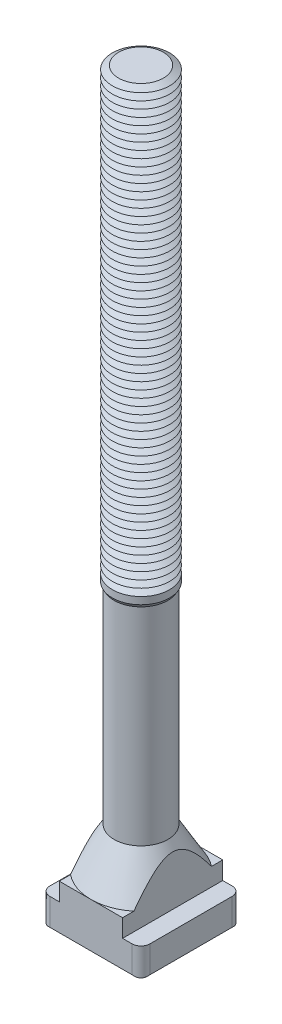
ISO-10303-21;
HEADER;
FILE_DESCRIPTION(('STEP AP214'),'2;1');
FILE_NAME('part.step','',(''),(''),'','','');
FILE_SCHEMA(('AUTOMOTIVE_DESIGN { 1 0 10303 214 1 1 1 1 }'));
ENDSEC;
DATA;
#1=APPLICATION_CONTEXT('core data for automotive mechanical design processes');
#2=APPLICATION_PROTOCOL_DEFINITION('international standard','automotive_design',2000,#1);
#3=PRODUCT_CONTEXT('',#1,'mechanical');
#4=PRODUCT('Part','Part','',(#3));
#5=PRODUCT_RELATED_PRODUCT_CATEGORY('part','',(#4));
#6=PRODUCT_DEFINITION_FORMATION('','',#4);
#7=PRODUCT_DEFINITION_CONTEXT('part definition',#1,'design');
#8=PRODUCT_DEFINITION('design','',#6,#7);
#9=PRODUCT_DEFINITION_SHAPE('','',#8);
#10=(LENGTH_UNIT() NAMED_UNIT(*) SI_UNIT(.MILLI.,.METRE.));
#11=(NAMED_UNIT(*) PLANE_ANGLE_UNIT() SI_UNIT($,.RADIAN.));
#12=(NAMED_UNIT(*) SI_UNIT($,.STERADIAN.) SOLID_ANGLE_UNIT());
#13=UNCERTAINTY_MEASURE_WITH_UNIT(LENGTH_MEASURE(1.E-05),#10,'distance_accuracy_value','');
#14=(GEOMETRIC_REPRESENTATION_CONTEXT(3) GLOBAL_UNCERTAINTY_ASSIGNED_CONTEXT((#13)) GLOBAL_UNIT_ASSIGNED_CONTEXT((#10,
#11,#12)) REPRESENTATION_CONTEXT('',''));
#15=CARTESIAN_POINT('',(0.,0.,0.));
#16=DIRECTION('',(0.,0.,1.));
#17=DIRECTION('',(1.,0.,0.));
#18=AXIS2_PLACEMENT_3D('',#15,#16,#17);
#19=CARTESIAN_POINT('',(0.,202.,0.));
#20=DIRECTION('',(0.,-1.,0.));
#21=DIRECTION('',(0.,0.,-1.));
#22=AXIS2_PLACEMENT_3D('',#19,#20,#21);
#23=CONICAL_SURFACE('',#22,6.26794919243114,1.0471975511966);
#24=CARTESIAN_POINT('',(0.,201.,0.));
#25=DIRECTION('',(0.,-1.,0.));
#26=DIRECTION('',(0.,0.,-1.));
#27=AXIS2_PLACEMENT_3D('',#24,#25,#26);
#28=CIRCLE('',#27,8.00000000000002);
#29=CARTESIAN_POINT('',(0.,201.,-8.00000000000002));
#30=VERTEX_POINT('',#29);
#31=EDGE_CURVE('E710',#30,#30,#28,.T.);
#32=ORIENTED_EDGE('',*,*,#31,.F.);
#33=EDGE_LOOP('',(#32));
#34=FACE_BOUND('',#33,.T.);
#35=CARTESIAN_POINT('',(0.,202.,0.));
#36=DIRECTION('',(0.,-1.,0.));
#37=DIRECTION('',(0.,0.,-1.));
#38=AXIS2_PLACEMENT_3D('',#35,#36,#37);
#39=CIRCLE('',#38,6.26794919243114);
#40=CARTESIAN_POINT('',(0.,202.,-6.26794919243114));
#41=VERTEX_POINT('',#40);
#42=EDGE_CURVE('E707',#41,#41,#39,.T.);
#43=ORIENTED_EDGE('',*,*,#42,.T.);
#44=EDGE_LOOP('',(#43));
#45=FACE_BOUND('',#44,.T.);
#46=ADVANCED_FACE('F39',(#34,#45),#23,.T.);
#47=CARTESIAN_POINT('',(0.,203.,0.));
#48=DIRECTION('',(0.,1.,0.));
#49=DIRECTION('',(0.,0.,1.));
#50=AXIS2_PLACEMENT_3D('',#47,#48,#49);
#51=CONICAL_SURFACE('',#50,8.00000000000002,1.0471975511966);
#52=ORIENTED_EDGE('',*,*,#42,.F.);
#53=EDGE_LOOP('',(#52));
#54=FACE_BOUND('',#53,.T.);
#55=CARTESIAN_POINT('',(0.,203.,0.));
#56=DIRECTION('',(0.,-1.,0.));
#57=DIRECTION('',(0.,0.,-1.));
#58=AXIS2_PLACEMENT_3D('',#55,#56,#57);
#59=CIRCLE('',#58,8.00000000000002);
#60=CARTESIAN_POINT('',(0.,203.,-8.00000000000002));
#61=VERTEX_POINT('',#60);
#62=EDGE_CURVE('E709',#61,#61,#59,.T.);
#63=ORIENTED_EDGE('',*,*,#62,.T.);
#64=EDGE_LOOP('',(#63));
#65=FACE_BOUND('',#64,.T.);
#66=ADVANCED_FACE('F449',(#54,#65),#51,.T.);
#67=CARTESIAN_POINT('',(3.89846008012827,210.,0.));
#68=DIRECTION('',(0.,-1.,0.));
#69=DIRECTION('',(1.,0.,0.));
#70=AXIS2_PLACEMENT_3D('',#67,#68,#69);
#71=PLANE('',#70);
#72=CARTESIAN_POINT('',(0.,210.,0.));
#73=DIRECTION('',(0.,-1.,0.));
#74=DIRECTION('',(0.,0.,-1.));
#75=AXIS2_PLACEMENT_3D('',#72,#73,#74);
#76=CIRCLE('',#75,6.26794919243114);
#77=CARTESIAN_POINT('',(0.,210.,-6.26794919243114));
#78=VERTEX_POINT('',#77);
#79=EDGE_CURVE('E755',#78,#78,#76,.T.);
#80=ORIENTED_EDGE('',*,*,#79,.F.);
#81=EDGE_LOOP('',(#80));
#82=FACE_BOUND('',#81,.T.);
#83=ADVANCED_FACE('F455',(#82),#71,.F.);
#84=CARTESIAN_POINT('',(0.,210.,0.));
#85=DIRECTION('',(0.,-1.,0.));
#86=DIRECTION('',(0.,0.,-1.));
#87=AXIS2_PLACEMENT_3D('',#84,#85,#86);
#88=CONICAL_SURFACE('',#87,6.26794919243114,1.0471975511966);
#89=CARTESIAN_POINT('',(0.,209.,0.));
#90=DIRECTION('',(0.,-1.,0.));
#91=DIRECTION('',(0.,0.,-1.));
#92=AXIS2_PLACEMENT_3D('',#89,#90,#91);
#93=CIRCLE('',#92,8.00000000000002);
#94=CARTESIAN_POINT('',(0.,209.,-8.00000000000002));
#95=VERTEX_POINT('',#94);
#96=EDGE_CURVE('E753',#95,#95,#93,.T.);
#97=ORIENTED_EDGE('',*,*,#96,.F.);
#98=EDGE_LOOP('',(#97));
#99=FACE_BOUND('',#98,.T.);
#100=ORIENTED_EDGE('',*,*,#79,.T.);
#101=EDGE_LOOP('',(#100));
#102=FACE_BOUND('',#101,.T.);
#103=ADVANCED_FACE('F483',(#99,#102),#88,.T.);
#104=CARTESIAN_POINT('',(0.,209.,0.));
#105=DIRECTION('',(0.,1.,0.));
#106=DIRECTION('',(0.,0.,1.));
#107=AXIS2_PLACEMENT_3D('',#104,#105,#106);
#108=CONICAL_SURFACE('',#107,8.00000000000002,1.0471975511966);
#109=CARTESIAN_POINT('',(0.,208.,0.));
#110=DIRECTION('',(0.,-1.,0.));
#111=DIRECTION('',(0.,0.,-1.));
#112=AXIS2_PLACEMENT_3D('',#109,#110,#111);
#113=CIRCLE('',#112,6.26794919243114);
#114=CARTESIAN_POINT('',(0.,208.,-6.26794919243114));
#115=VERTEX_POINT('',#114);
#116=EDGE_CURVE('E674',#115,#115,#113,.T.);
#117=ORIENTED_EDGE('',*,*,#116,.F.);
#118=EDGE_LOOP('',(#117));
#119=FACE_BOUND('',#118,.T.);
#120=ORIENTED_EDGE('',*,*,#96,.T.);
#121=EDGE_LOOP('',(#120));
#122=FACE_BOUND('',#121,.T.);
#123=ADVANCED_FACE('F480',(#119,#122),#108,.T.);
#124=CARTESIAN_POINT('',(0.,208.,0.));
#125=DIRECTION('',(0.,-1.,0.));
#126=DIRECTION('',(0.,0.,-1.));
#127=AXIS2_PLACEMENT_3D('',#124,#125,#126);
#128=CONICAL_SURFACE('',#127,6.26794919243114,1.0471975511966);
#129=CARTESIAN_POINT('',(0.,207.,0.));
#130=DIRECTION('',(0.,-1.,0.));
#131=DIRECTION('',(0.,0.,-1.));
#132=AXIS2_PLACEMENT_3D('',#129,#130,#131);
#133=CIRCLE('',#132,8.00000000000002);
#134=CARTESIAN_POINT('',(0.,207.,-8.00000000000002));
#135=VERTEX_POINT('',#134);
#136=EDGE_CURVE('E672',#135,#135,#133,.T.);
#137=ORIENTED_EDGE('',*,*,#136,.F.);
#138=EDGE_LOOP('',(#137));
#139=FACE_BOUND('',#138,.T.);
#140=ORIENTED_EDGE('',*,*,#116,.T.);
#141=EDGE_LOOP('',(#140));
#142=FACE_BOUND('',#141,.T.);
#143=ADVANCED_FACE('F475',(#139,#142),#128,.T.);
#144=CARTESIAN_POINT('',(0.,207.,0.));
#145=DIRECTION('',(0.,1.,0.));
#146=DIRECTION('',(0.,0.,1.));
#147=AXIS2_PLACEMENT_3D('',#144,#145,#146);
#148=CONICAL_SURFACE('',#147,8.00000000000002,1.0471975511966);
#149=CARTESIAN_POINT('',(0.,206.,0.));
#150=DIRECTION('',(0.,-1.,0.));
#151=DIRECTION('',(0.,0.,-1.));
#152=AXIS2_PLACEMENT_3D('',#149,#150,#151);
#153=CIRCLE('',#152,6.26794919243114);
#154=CARTESIAN_POINT('',(0.,206.,-6.26794919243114));
#155=VERTEX_POINT('',#154);
#156=EDGE_CURVE('E669',#155,#155,#153,.T.);
#157=ORIENTED_EDGE('',*,*,#156,.F.);
#158=EDGE_LOOP('',(#157));
#159=FACE_BOUND('',#158,.T.);
#160=ORIENTED_EDGE('',*,*,#136,.T.);
#161=EDGE_LOOP('',(#160));
#162=FACE_BOUND('',#161,.T.);
#163=ADVANCED_FACE('F472',(#159,#162),#148,.T.);
#164=CARTESIAN_POINT('',(0.,206.,0.));
#165=DIRECTION('',(0.,-1.,0.));
#166=DIRECTION('',(0.,0.,-1.));
#167=AXIS2_PLACEMENT_3D('',#164,#165,#166);
#168=CONICAL_SURFACE('',#167,6.26794919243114,1.0471975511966);
#169=CARTESIAN_POINT('',(0.,205.,0.));
#170=DIRECTION('',(0.,-1.,0.));
#171=DIRECTION('',(0.,0.,-1.));
#172=AXIS2_PLACEMENT_3D('',#169,#170,#171);
#173=CIRCLE('',#172,8.00000000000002);
#174=CARTESIAN_POINT('',(0.,205.,-8.00000000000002));
#175=VERTEX_POINT('',#174);
#176=EDGE_CURVE('E666',#175,#175,#173,.T.);
#177=ORIENTED_EDGE('',*,*,#176,.F.);
#178=EDGE_LOOP('',(#177));
#179=FACE_BOUND('',#178,.T.);
#180=ORIENTED_EDGE('',*,*,#156,.T.);
#181=EDGE_LOOP('',(#180));
#182=FACE_BOUND('',#181,.T.);
#183=ADVANCED_FACE('F466',(#179,#182),#168,.T.);
#184=CARTESIAN_POINT('',(0.,205.,0.));
#185=DIRECTION('',(0.,1.,0.));
#186=DIRECTION('',(0.,0.,1.));
#187=AXIS2_PLACEMENT_3D('',#184,#185,#186);
#188=CONICAL_SURFACE('',#187,8.00000000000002,1.0471975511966);
#189=CARTESIAN_POINT('',(0.,204.,0.));
#190=DIRECTION('',(0.,-1.,0.));
#191=DIRECTION('',(0.,0.,-1.));
#192=AXIS2_PLACEMENT_3D('',#189,#190,#191);
#193=CIRCLE('',#192,6.26794919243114);
#194=CARTESIAN_POINT('',(0.,204.,-6.26794919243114));
#195=VERTEX_POINT('',#194);
#196=EDGE_CURVE('E670',#195,#195,#193,.T.);
#197=ORIENTED_EDGE('',*,*,#196,.F.);
#198=EDGE_LOOP('',(#197));
#199=FACE_BOUND('',#198,.T.);
#200=ORIENTED_EDGE('',*,*,#176,.T.);
#201=EDGE_LOOP('',(#200));
#202=FACE_BOUND('',#201,.T.);
#203=ADVANCED_FACE('F462',(#199,#202),#188,.T.);
#204=CARTESIAN_POINT('',(0.,204.,0.));
#205=DIRECTION('',(0.,-1.,0.));
#206=DIRECTION('',(0.,0.,-1.));
#207=AXIS2_PLACEMENT_3D('',#204,#205,#206);
#208=CONICAL_SURFACE('',#207,6.26794919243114,1.0471975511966);
#209=ORIENTED_EDGE('',*,*,#62,.F.);
#210=EDGE_LOOP('',(#209));
#211=FACE_BOUND('',#210,.T.);
#212=ORIENTED_EDGE('',*,*,#196,.T.);
#213=EDGE_LOOP('',(#212));
#214=FACE_BOUND('',#213,.T.);
#215=ADVANCED_FACE('F465',(#211,#214),#208,.T.);
#216=CARTESIAN_POINT('',(0.,200.,0.));
#217=DIRECTION('',(0.,-1.,0.));
#218=DIRECTION('',(0.,0.,-1.));
#219=AXIS2_PLACEMENT_3D('',#216,#217,#218);
#220=CONICAL_SURFACE('',#219,6.26794919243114,1.0471975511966);
#221=CARTESIAN_POINT('',(0.,199.,0.));
#222=DIRECTION('',(0.,-1.,0.));
#223=DIRECTION('',(0.,0.,-1.));
#224=AXIS2_PLACEMENT_3D('',#221,#222,#223);
#225=CIRCLE('',#224,8.00000000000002);
#226=CARTESIAN_POINT('',(0.,199.,-8.00000000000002));
#227=VERTEX_POINT('',#226);
#228=EDGE_CURVE('E801',#227,#227,#225,.T.);
#229=ORIENTED_EDGE('',*,*,#228,.F.);
#230=EDGE_LOOP('',(#229));
#231=FACE_BOUND('',#230,.T.);
#232=CARTESIAN_POINT('',(0.,200.,0.));
#233=DIRECTION('',(0.,-1.,0.));
#234=DIRECTION('',(0.,0.,-1.));
#235=AXIS2_PLACEMENT_3D('',#232,#233,#234);
#236=CIRCLE('',#235,6.26794919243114);
#237=CARTESIAN_POINT('',(0.,200.,-6.26794919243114));
#238=VERTEX_POINT('',#237);
#239=EDGE_CURVE('E837',#238,#238,#236,.T.);
#240=ORIENTED_EDGE('',*,*,#239,.T.);
#241=EDGE_LOOP('',(#240));
#242=FACE_BOUND('',#241,.T.);
#243=ADVANCED_FACE('F470',(#231,#242),#220,.T.);
#244=CARTESIAN_POINT('',(0.,201.,0.));
#245=DIRECTION('',(0.,1.,0.));
#246=DIRECTION('',(0.,0.,1.));
#247=AXIS2_PLACEMENT_3D('',#244,#245,#246);
#248=CONICAL_SURFACE('',#247,8.00000000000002,1.0471975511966);
#249=ORIENTED_EDGE('',*,*,#239,.F.);
#250=EDGE_LOOP('',(#249));
#251=FACE_BOUND('',#250,.T.);
#252=ORIENTED_EDGE('',*,*,#31,.T.);
#253=EDGE_LOOP('',(#252));
#254=FACE_BOUND('',#253,.T.);
#255=ADVANCED_FACE('F1085',(#251,#254),#248,.T.);
#256=CARTESIAN_POINT('',(0.,198.,0.));
#257=DIRECTION('',(0.,-1.,0.));
#258=DIRECTION('',(0.,0.,-1.));
#259=AXIS2_PLACEMENT_3D('',#256,#257,#258);
#260=CONICAL_SURFACE('',#259,6.26794919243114,1.0471975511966);
#261=CARTESIAN_POINT('',(0.,197.,0.));
#262=DIRECTION('',(0.,-1.,0.));
#263=DIRECTION('',(0.,0.,-1.));
#264=AXIS2_PLACEMENT_3D('',#261,#262,#263);
#265=CIRCLE('',#264,8.00000000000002);
#266=CARTESIAN_POINT('',(0.,197.,-8.00000000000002));
#267=VERTEX_POINT('',#266);
#268=EDGE_CURVE('E802',#267,#267,#265,.T.);
#269=ORIENTED_EDGE('',*,*,#268,.F.);
#270=EDGE_LOOP('',(#269));
#271=FACE_BOUND('',#270,.T.);
#272=CARTESIAN_POINT('',(0.,198.,0.));
#273=DIRECTION('',(0.,-1.,0.));
#274=DIRECTION('',(0.,0.,-1.));
#275=AXIS2_PLACEMENT_3D('',#272,#273,#274);
#276=CIRCLE('',#275,6.26794919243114);
#277=CARTESIAN_POINT('',(0.,198.,-6.26794919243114));
#278=VERTEX_POINT('',#277);
#279=EDGE_CURVE('E799',#278,#278,#276,.T.);
#280=ORIENTED_EDGE('',*,*,#279,.T.);
#281=EDGE_LOOP('',(#280));
#282=FACE_BOUND('',#281,.T.);
#283=ADVANCED_FACE('F1081',(#271,#282),#260,.T.);
#284=CARTESIAN_POINT('',(0.,199.,0.));
#285=DIRECTION('',(0.,1.,0.));
#286=DIRECTION('',(0.,0.,1.));
#287=AXIS2_PLACEMENT_3D('',#284,#285,#286);
#288=CONICAL_SURFACE('',#287,8.00000000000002,1.0471975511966);
#289=ORIENTED_EDGE('',*,*,#279,.F.);
#290=EDGE_LOOP('',(#289));
#291=FACE_BOUND('',#290,.T.);
#292=ORIENTED_EDGE('',*,*,#228,.T.);
#293=EDGE_LOOP('',(#292));
#294=FACE_BOUND('',#293,.T.);
#295=ADVANCED_FACE('F1065',(#291,#294),#288,.T.);
#296=CARTESIAN_POINT('',(0.,196.,0.));
#297=DIRECTION('',(0.,-1.,0.));
#298=DIRECTION('',(0.,0.,-1.));
#299=AXIS2_PLACEMENT_3D('',#296,#297,#298);
#300=CONICAL_SURFACE('',#299,6.26794919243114,1.0471975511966);
#301=CARTESIAN_POINT('',(0.,195.,0.));
#302=DIRECTION('',(0.,-1.,0.));
#303=DIRECTION('',(0.,0.,-1.));
#304=AXIS2_PLACEMENT_3D('',#301,#302,#303);
#305=CIRCLE('',#304,8.00000000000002);
#306=CARTESIAN_POINT('',(0.,195.,-8.00000000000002));
#307=VERTEX_POINT('',#306);
#308=EDGE_CURVE('E834',#307,#307,#305,.T.);
#309=ORIENTED_EDGE('',*,*,#308,.F.);
#310=EDGE_LOOP('',(#309));
#311=FACE_BOUND('',#310,.T.);
#312=CARTESIAN_POINT('',(0.,196.,0.));
#313=DIRECTION('',(0.,-1.,0.));
#314=DIRECTION('',(0.,0.,-1.));
#315=AXIS2_PLACEMENT_3D('',#312,#313,#314);
#316=CIRCLE('',#315,6.26794919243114);
#317=CARTESIAN_POINT('',(0.,196.,-6.26794919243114));
#318=VERTEX_POINT('',#317);
#319=EDGE_CURVE('E975',#318,#318,#316,.T.);
#320=ORIENTED_EDGE('',*,*,#319,.T.);
#321=EDGE_LOOP('',(#320));
#322=FACE_BOUND('',#321,.T.);
#323=ADVANCED_FACE('F1061',(#311,#322),#300,.T.);
#324=CARTESIAN_POINT('',(0.,197.,0.));
#325=DIRECTION('',(0.,1.,0.));
#326=DIRECTION('',(0.,0.,1.));
#327=AXIS2_PLACEMENT_3D('',#324,#325,#326);
#328=CONICAL_SURFACE('',#327,8.00000000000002,1.0471975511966);
#329=ORIENTED_EDGE('',*,*,#319,.F.);
#330=EDGE_LOOP('',(#329));
#331=FACE_BOUND('',#330,.T.);
#332=ORIENTED_EDGE('',*,*,#268,.T.);
#333=EDGE_LOOP('',(#332));
#334=FACE_BOUND('',#333,.T.);
#335=ADVANCED_FACE('F1064',(#331,#334),#328,.T.);
#336=CARTESIAN_POINT('',(0.,194.,0.));
#337=DIRECTION('',(0.,-1.,0.));
#338=DIRECTION('',(0.,0.,-1.));
#339=AXIS2_PLACEMENT_3D('',#336,#337,#338);
#340=CONICAL_SURFACE('',#339,6.26794919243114,1.0471975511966);
#341=CARTESIAN_POINT('',(0.,193.,0.));
#342=DIRECTION('',(0.,-1.,0.));
#343=DIRECTION('',(0.,0.,-1.));
#344=AXIS2_PLACEMENT_3D('',#341,#342,#343);
#345=CIRCLE('',#344,8.00000000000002);
#346=CARTESIAN_POINT('',(0.,193.,-8.00000000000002));
#347=VERTEX_POINT('',#346);
#348=EDGE_CURVE('E704',#347,#347,#345,.T.);
#349=ORIENTED_EDGE('',*,*,#348,.F.);
#350=EDGE_LOOP('',(#349));
#351=FACE_BOUND('',#350,.T.);
#352=CARTESIAN_POINT('',(0.,194.,0.));
#353=DIRECTION('',(0.,-1.,0.));
#354=DIRECTION('',(0.,0.,-1.));
#355=AXIS2_PLACEMENT_3D('',#352,#353,#354);
#356=CIRCLE('',#355,6.26794919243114);
#357=CARTESIAN_POINT('',(0.,194.,-6.26794919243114));
#358=VERTEX_POINT('',#357);
#359=EDGE_CURVE('E831',#358,#358,#356,.T.);
#360=ORIENTED_EDGE('',*,*,#359,.T.);
#361=EDGE_LOOP('',(#360));
#362=FACE_BOUND('',#361,.T.);
#363=ADVANCED_FACE('F1070',(#351,#362),#340,.T.);
#364=CARTESIAN_POINT('',(0.,195.,0.));
#365=DIRECTION('',(0.,1.,0.));
#366=DIRECTION('',(0.,0.,1.));
#367=AXIS2_PLACEMENT_3D('',#364,#365,#366);
#368=CONICAL_SURFACE('',#367,8.00000000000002,1.0471975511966);
#369=ORIENTED_EDGE('',*,*,#359,.F.);
#370=EDGE_LOOP('',(#369));
#371=FACE_BOUND('',#370,.T.);
#372=ORIENTED_EDGE('',*,*,#308,.T.);
#373=EDGE_LOOP('',(#372));
#374=FACE_BOUND('',#373,.T.);
#375=ADVANCED_FACE('F1059',(#371,#374),#368,.T.);
#376=CARTESIAN_POINT('',(0.,192.,0.));
#377=DIRECTION('',(0.,-1.,0.));
#378=DIRECTION('',(0.,0.,-1.));
#379=AXIS2_PLACEMENT_3D('',#376,#377,#378);
#380=CONICAL_SURFACE('',#379,6.26794919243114,1.0471975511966);
#381=CARTESIAN_POINT('',(0.,191.,0.));
#382=DIRECTION('',(0.,-1.,0.));
#383=DIRECTION('',(0.,0.,-1.));
#384=AXIS2_PLACEMENT_3D('',#381,#382,#383);
#385=CIRCLE('',#384,8.00000000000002);
#386=CARTESIAN_POINT('',(0.,191.,-8.00000000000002));
#387=VERTEX_POINT('',#386);
#388=EDGE_CURVE('E705',#387,#387,#385,.T.);
#389=ORIENTED_EDGE('',*,*,#388,.F.);
#390=EDGE_LOOP('',(#389));
#391=FACE_BOUND('',#390,.T.);
#392=CARTESIAN_POINT('',(0.,192.,0.));
#393=DIRECTION('',(0.,-1.,0.));
#394=DIRECTION('',(0.,0.,-1.));
#395=AXIS2_PLACEMENT_3D('',#392,#393,#394);
#396=CIRCLE('',#395,6.26794919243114);
#397=CARTESIAN_POINT('',(0.,192.,-6.26794919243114));
#398=VERTEX_POINT('',#397);
#399=EDGE_CURVE('E701',#398,#398,#396,.T.);
#400=ORIENTED_EDGE('',*,*,#399,.T.);
#401=EDGE_LOOP('',(#400));
#402=FACE_BOUND('',#401,.T.);
#403=ADVANCED_FACE('F1127',(#391,#402),#380,.T.);
#404=CARTESIAN_POINT('',(0.,193.,0.));
#405=DIRECTION('',(0.,1.,0.));
#406=DIRECTION('',(0.,0.,1.));
#407=AXIS2_PLACEMENT_3D('',#404,#405,#406);
#408=CONICAL_SURFACE('',#407,8.00000000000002,1.0471975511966);
#409=ORIENTED_EDGE('',*,*,#399,.F.);
#410=EDGE_LOOP('',(#409));
#411=FACE_BOUND('',#410,.T.);
#412=ORIENTED_EDGE('',*,*,#348,.T.);
#413=EDGE_LOOP('',(#412));
#414=FACE_BOUND('',#413,.T.);
#415=ADVANCED_FACE('F1135',(#411,#414),#408,.T.);
#416=CARTESIAN_POINT('',(0.,190.,0.));
#417=DIRECTION('',(0.,-1.,0.));
#418=DIRECTION('',(0.,0.,-1.));
#419=AXIS2_PLACEMENT_3D('',#416,#417,#418);
#420=CONICAL_SURFACE('',#419,6.26794919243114,1.0471975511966);
#421=CARTESIAN_POINT('',(0.,189.,0.));
#422=DIRECTION('',(0.,-1.,0.));
#423=DIRECTION('',(0.,0.,-1.));
#424=AXIS2_PLACEMENT_3D('',#421,#422,#423);
#425=CIRCLE('',#424,8.00000000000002);
#426=CARTESIAN_POINT('',(0.,189.,-8.00000000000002));
#427=VERTEX_POINT('',#426);
#428=EDGE_CURVE('E903',#427,#427,#425,.T.);
#429=ORIENTED_EDGE('',*,*,#428,.F.);
#430=EDGE_LOOP('',(#429));
#431=FACE_BOUND('',#430,.T.);
#432=CARTESIAN_POINT('',(0.,190.,0.));
#433=DIRECTION('',(0.,-1.,0.));
#434=DIRECTION('',(0.,0.,-1.));
#435=AXIS2_PLACEMENT_3D('',#432,#433,#434);
#436=CIRCLE('',#435,6.26794919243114);
#437=CARTESIAN_POINT('',(0.,190.,-6.26794919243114));
#438=VERTEX_POINT('',#437);
#439=EDGE_CURVE('E905',#438,#438,#436,.T.);
#440=ORIENTED_EDGE('',*,*,#439,.T.);
#441=EDGE_LOOP('',(#440));
#442=FACE_BOUND('',#441,.T.);
#443=ADVANCED_FACE('F1144',(#431,#442),#420,.T.);
#444=CARTESIAN_POINT('',(0.,191.,0.));
#445=DIRECTION('',(0.,1.,0.));
#446=DIRECTION('',(0.,0.,1.));
#447=AXIS2_PLACEMENT_3D('',#444,#445,#446);
#448=CONICAL_SURFACE('',#447,8.00000000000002,1.0471975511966);
#449=ORIENTED_EDGE('',*,*,#439,.F.);
#450=EDGE_LOOP('',(#449));
#451=FACE_BOUND('',#450,.T.);
#452=ORIENTED_EDGE('',*,*,#388,.T.);
#453=EDGE_LOOP('',(#452));
#454=FACE_BOUND('',#453,.T.);
#455=ADVANCED_FACE('F1153',(#451,#454),#448,.T.);
#456=CARTESIAN_POINT('',(0.,188.,0.));
#457=DIRECTION('',(0.,-1.,0.));
#458=DIRECTION('',(0.,0.,-1.));
#459=AXIS2_PLACEMENT_3D('',#456,#457,#458);
#460=CONICAL_SURFACE('',#459,6.26794919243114,1.0471975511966);
#461=CARTESIAN_POINT('',(0.,187.,0.));
#462=DIRECTION('',(0.,-1.,0.));
#463=DIRECTION('',(0.,0.,-1.));
#464=AXIS2_PLACEMENT_3D('',#461,#462,#463);
#465=CIRCLE('',#464,8.00000000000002);
#466=CARTESIAN_POINT('',(0.,187.,-8.00000000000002));
#467=VERTEX_POINT('',#466);
#468=EDGE_CURVE('E796',#467,#467,#465,.T.);
#469=ORIENTED_EDGE('',*,*,#468,.F.);
#470=EDGE_LOOP('',(#469));
#471=FACE_BOUND('',#470,.T.);
#472=CARTESIAN_POINT('',(0.,188.,0.));
#473=DIRECTION('',(0.,-1.,0.));
#474=DIRECTION('',(0.,0.,-1.));
#475=AXIS2_PLACEMENT_3D('',#472,#473,#474);
#476=CIRCLE('',#475,6.26794919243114);
#477=CARTESIAN_POINT('',(0.,188.,-6.26794919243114));
#478=VERTEX_POINT('',#477);
#479=EDGE_CURVE('E906',#478,#478,#476,.T.);
#480=ORIENTED_EDGE('',*,*,#479,.T.);
#481=EDGE_LOOP('',(#480));
#482=FACE_BOUND('',#481,.T.);
#483=ADVANCED_FACE('F1162',(#471,#482),#460,.T.);
#484=CARTESIAN_POINT('',(0.,189.,0.));
#485=DIRECTION('',(0.,1.,0.));
#486=DIRECTION('',(0.,0.,1.));
#487=AXIS2_PLACEMENT_3D('',#484,#485,#486);
#488=CONICAL_SURFACE('',#487,8.00000000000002,1.0471975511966);
#489=ORIENTED_EDGE('',*,*,#479,.F.);
#490=EDGE_LOOP('',(#489));
#491=FACE_BOUND('',#490,.T.);
#492=ORIENTED_EDGE('',*,*,#428,.T.);
#493=EDGE_LOOP('',(#492));
#494=FACE_BOUND('',#493,.T.);
#495=ADVANCED_FACE('F1171',(#491,#494),#488,.T.);
#496=CARTESIAN_POINT('',(0.,186.,0.));
#497=DIRECTION('',(0.,-1.,0.));
#498=DIRECTION('',(0.,0.,-1.));
#499=AXIS2_PLACEMENT_3D('',#496,#497,#498);
#500=CONICAL_SURFACE('',#499,6.26794919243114,1.0471975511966);
#501=CARTESIAN_POINT('',(0.,185.,0.));
#502=DIRECTION('',(0.,-1.,0.));
#503=DIRECTION('',(0.,0.,-1.));
#504=AXIS2_PLACEMENT_3D('',#501,#502,#503);
#505=CIRCLE('',#504,8.00000000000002);
#506=CARTESIAN_POINT('',(0.,185.,-8.00000000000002));
#507=VERTEX_POINT('',#506);
#508=EDGE_CURVE('E797',#507,#507,#505,.T.);
#509=ORIENTED_EDGE('',*,*,#508,.F.);
#510=EDGE_LOOP('',(#509));
#511=FACE_BOUND('',#510,.T.);
#512=CARTESIAN_POINT('',(0.,186.,0.));
#513=DIRECTION('',(0.,-1.,0.));
#514=DIRECTION('',(0.,0.,-1.));
#515=AXIS2_PLACEMENT_3D('',#512,#513,#514);
#516=CIRCLE('',#515,6.26794919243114);
#517=CARTESIAN_POINT('',(0.,186.,-6.26794919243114));
#518=VERTEX_POINT('',#517);
#519=EDGE_CURVE('E793',#518,#518,#516,.T.);
#520=ORIENTED_EDGE('',*,*,#519,.T.);
#521=EDGE_LOOP('',(#520));
#522=FACE_BOUND('',#521,.T.);
#523=ADVANCED_FACE('F1180',(#511,#522),#500,.T.);
#524=CARTESIAN_POINT('',(0.,187.,0.));
#525=DIRECTION('',(0.,1.,0.));
#526=DIRECTION('',(0.,0.,1.));
#527=AXIS2_PLACEMENT_3D('',#524,#525,#526);
#528=CONICAL_SURFACE('',#527,8.00000000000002,1.0471975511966);
#529=ORIENTED_EDGE('',*,*,#519,.F.);
#530=EDGE_LOOP('',(#529));
#531=FACE_BOUND('',#530,.T.);
#532=ORIENTED_EDGE('',*,*,#468,.T.);
#533=EDGE_LOOP('',(#532));
#534=FACE_BOUND('',#533,.T.);
#535=ADVANCED_FACE('F1189',(#531,#534),#528,.T.);
#536=CARTESIAN_POINT('',(0.,184.,0.));
#537=DIRECTION('',(0.,-1.,0.));
#538=DIRECTION('',(0.,0.,-1.));
#539=AXIS2_PLACEMENT_3D('',#536,#537,#538);
#540=CONICAL_SURFACE('',#539,6.26794919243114,1.0471975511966);
#541=CARTESIAN_POINT('',(0.,183.,0.));
#542=DIRECTION('',(0.,-1.,0.));
#543=DIRECTION('',(0.,0.,-1.));
#544=AXIS2_PLACEMENT_3D('',#541,#542,#543);
#545=CIRCLE('',#544,8.00000000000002);
#546=CARTESIAN_POINT('',(0.,183.,-8.00000000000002));
#547=VERTEX_POINT('',#546);
#548=EDGE_CURVE('E1037',#547,#547,#545,.T.);
#549=ORIENTED_EDGE('',*,*,#548,.F.);
#550=EDGE_LOOP('',(#549));
#551=FACE_BOUND('',#550,.T.);
#552=CARTESIAN_POINT('',(0.,184.,0.));
#553=DIRECTION('',(0.,-1.,0.));
#554=DIRECTION('',(0.,0.,-1.));
#555=AXIS2_PLACEMENT_3D('',#552,#553,#554);
#556=CIRCLE('',#555,6.26794919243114);
#557=CARTESIAN_POINT('',(0.,184.,-6.26794919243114));
#558=VERTEX_POINT('',#557);
#559=EDGE_CURVE('E829',#558,#558,#556,.T.);
#560=ORIENTED_EDGE('',*,*,#559,.T.);
#561=EDGE_LOOP('',(#560));
#562=FACE_BOUND('',#561,.T.);
#563=ADVANCED_FACE('F1198',(#551,#562),#540,.T.);
#564=CARTESIAN_POINT('',(0.,185.,0.));
#565=DIRECTION('',(0.,1.,0.));
#566=DIRECTION('',(0.,0.,1.));
#567=AXIS2_PLACEMENT_3D('',#564,#565,#566);
#568=CONICAL_SURFACE('',#567,8.00000000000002,1.0471975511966);
#569=ORIENTED_EDGE('',*,*,#559,.F.);
#570=EDGE_LOOP('',(#569));
#571=FACE_BOUND('',#570,.T.);
#572=ORIENTED_EDGE('',*,*,#508,.T.);
#573=EDGE_LOOP('',(#572));
#574=FACE_BOUND('',#573,.T.);
#575=ADVANCED_FACE('F1207',(#571,#574),#568,.T.);
#576=CARTESIAN_POINT('',(0.,182.,0.));
#577=DIRECTION('',(0.,-1.,0.));
#578=DIRECTION('',(0.,0.,-1.));
#579=AXIS2_PLACEMENT_3D('',#576,#577,#578);
#580=CONICAL_SURFACE('',#579,6.26794919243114,1.0471975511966);
#581=CARTESIAN_POINT('',(0.,181.,0.));
#582=DIRECTION('',(0.,-1.,0.));
#583=DIRECTION('',(0.,0.,-1.));
#584=AXIS2_PLACEMENT_3D('',#581,#582,#583);
#585=CIRCLE('',#584,8.00000000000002);
#586=CARTESIAN_POINT('',(0.,181.,-8.00000000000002));
#587=VERTEX_POINT('',#586);
#588=EDGE_CURVE('E747',#587,#587,#585,.T.);
#589=ORIENTED_EDGE('',*,*,#588,.F.);
#590=EDGE_LOOP('',(#589));
#591=FACE_BOUND('',#590,.T.);
#592=CARTESIAN_POINT('',(0.,182.,0.));
#593=DIRECTION('',(0.,-1.,0.));
#594=DIRECTION('',(0.,0.,-1.));
#595=AXIS2_PLACEMENT_3D('',#592,#593,#594);
#596=CIRCLE('',#595,6.26794919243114);
#597=CARTESIAN_POINT('',(0.,182.,-6.26794919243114));
#598=VERTEX_POINT('',#597);
#599=EDGE_CURVE('E750',#598,#598,#596,.T.);
#600=ORIENTED_EDGE('',*,*,#599,.T.);
#601=EDGE_LOOP('',(#600));
#602=FACE_BOUND('',#601,.T.);
#603=ADVANCED_FACE('F1216',(#591,#602),#580,.T.);
#604=CARTESIAN_POINT('',(0.,183.,0.));
#605=DIRECTION('',(0.,1.,0.));
#606=DIRECTION('',(0.,0.,1.));
#607=AXIS2_PLACEMENT_3D('',#604,#605,#606);
#608=CONICAL_SURFACE('',#607,8.00000000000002,1.0471975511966);
#609=ORIENTED_EDGE('',*,*,#599,.F.);
#610=EDGE_LOOP('',(#609));
#611=FACE_BOUND('',#610,.T.);
#612=ORIENTED_EDGE('',*,*,#548,.T.);
#613=EDGE_LOOP('',(#612));
#614=FACE_BOUND('',#613,.T.);
#615=ADVANCED_FACE('F1225',(#611,#614),#608,.T.);
#616=CARTESIAN_POINT('',(0.,180.,0.));
#617=DIRECTION('',(0.,-1.,0.));
#618=DIRECTION('',(0.,0.,-1.));
#619=AXIS2_PLACEMENT_3D('',#616,#617,#618);
#620=CONICAL_SURFACE('',#619,6.26794919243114,1.0471975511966);
#621=CARTESIAN_POINT('',(0.,179.,0.));
#622=DIRECTION('',(0.,-1.,0.));
#623=DIRECTION('',(0.,0.,-1.));
#624=AXIS2_PLACEMENT_3D('',#621,#622,#623);
#625=CIRCLE('',#624,8.00000000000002);
#626=CARTESIAN_POINT('',(0.,179.,-8.00000000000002));
#627=VERTEX_POINT('',#626);
#628=EDGE_CURVE('E745',#627,#627,#625,.T.);
#629=ORIENTED_EDGE('',*,*,#628,.F.);
#630=EDGE_LOOP('',(#629));
#631=FACE_BOUND('',#630,.T.);
#632=CARTESIAN_POINT('',(0.,180.,0.));
#633=DIRECTION('',(0.,-1.,0.));
#634=DIRECTION('',(0.,0.,-1.));
#635=AXIS2_PLACEMENT_3D('',#632,#633,#634);
#636=CIRCLE('',#635,6.26794919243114);
#637=CARTESIAN_POINT('',(0.,180.,-6.26794919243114));
#638=VERTEX_POINT('',#637);
#639=EDGE_CURVE('E751',#638,#638,#636,.T.);
#640=ORIENTED_EDGE('',*,*,#639,.T.);
#641=EDGE_LOOP('',(#640));
#642=FACE_BOUND('',#641,.T.);
#643=ADVANCED_FACE('F1234',(#631,#642),#620,.T.);
#644=CARTESIAN_POINT('',(0.,181.,0.));
#645=DIRECTION('',(0.,1.,0.));
#646=DIRECTION('',(0.,0.,1.));
#647=AXIS2_PLACEMENT_3D('',#644,#645,#646);
#648=CONICAL_SURFACE('',#647,8.00000000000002,1.0471975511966);
#649=ORIENTED_EDGE('',*,*,#639,.F.);
#650=EDGE_LOOP('',(#649));
#651=FACE_BOUND('',#650,.T.);
#652=ORIENTED_EDGE('',*,*,#588,.T.);
#653=EDGE_LOOP('',(#652));
#654=FACE_BOUND('',#653,.T.);
#655=ADVANCED_FACE('F1243',(#651,#654),#648,.T.);
#656=CARTESIAN_POINT('',(0.,178.,0.));
#657=DIRECTION('',(0.,-1.,0.));
#658=DIRECTION('',(0.,0.,-1.));
#659=AXIS2_PLACEMENT_3D('',#656,#657,#658);
#660=CONICAL_SURFACE('',#659,6.26794919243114,1.0471975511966);
#661=CARTESIAN_POINT('',(0.,177.,0.));
#662=DIRECTION('',(0.,-1.,0.));
#663=DIRECTION('',(0.,0.,-1.));
#664=AXIS2_PLACEMENT_3D('',#661,#662,#663);
#665=CIRCLE('',#664,8.00000000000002);
#666=CARTESIAN_POINT('',(0.,177.,-8.00000000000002));
#667=VERTEX_POINT('',#666);
#668=EDGE_CURVE('E660',#667,#667,#665,.T.);
#669=ORIENTED_EDGE('',*,*,#668,.F.);
#670=EDGE_LOOP('',(#669));
#671=FACE_BOUND('',#670,.T.);
#672=CARTESIAN_POINT('',(0.,178.,0.));
#673=DIRECTION('',(0.,-1.,0.));
#674=DIRECTION('',(0.,0.,-1.));
#675=AXIS2_PLACEMENT_3D('',#672,#673,#674);
#676=CIRCLE('',#675,6.26794919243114);
#677=CARTESIAN_POINT('',(0.,178.,-6.26794919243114));
#678=VERTEX_POINT('',#677);
#679=EDGE_CURVE('E663',#678,#678,#676,.T.);
#680=ORIENTED_EDGE('',*,*,#679,.T.);
#681=EDGE_LOOP('',(#680));
#682=FACE_BOUND('',#681,.T.);
#683=ADVANCED_FACE('F1252',(#671,#682),#660,.T.);
#684=CARTESIAN_POINT('',(0.,179.,0.));
#685=DIRECTION('',(0.,1.,0.));
#686=DIRECTION('',(0.,0.,1.));
#687=AXIS2_PLACEMENT_3D('',#684,#685,#686);
#688=CONICAL_SURFACE('',#687,8.00000000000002,1.0471975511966);
#689=ORIENTED_EDGE('',*,*,#679,.F.);
#690=EDGE_LOOP('',(#689));
#691=FACE_BOUND('',#690,.T.);
#692=ORIENTED_EDGE('',*,*,#628,.T.);
#693=EDGE_LOOP('',(#692));
#694=FACE_BOUND('',#693,.T.);
#695=ADVANCED_FACE('F1261',(#691,#694),#688,.T.);
#696=CARTESIAN_POINT('',(0.,176.,0.));
#697=DIRECTION('',(0.,-1.,0.));
#698=DIRECTION('',(0.,0.,-1.));
#699=AXIS2_PLACEMENT_3D('',#696,#697,#698);
#700=CONICAL_SURFACE('',#699,6.26794919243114,1.0471975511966);
#701=CARTESIAN_POINT('',(0.,175.,0.));
#702=DIRECTION('',(0.,-1.,0.));
#703=DIRECTION('',(0.,0.,-1.));
#704=AXIS2_PLACEMENT_3D('',#701,#702,#703);
#705=CIRCLE('',#704,8.00000000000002);
#706=CARTESIAN_POINT('',(0.,175.,-8.00000000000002));
#707=VERTEX_POINT('',#706);
#708=EDGE_CURVE('E864',#707,#707,#705,.T.);
#709=ORIENTED_EDGE('',*,*,#708,.F.);
#710=EDGE_LOOP('',(#709));
#711=FACE_BOUND('',#710,.T.);
#712=CARTESIAN_POINT('',(0.,176.,0.));
#713=DIRECTION('',(0.,-1.,0.));
#714=DIRECTION('',(0.,0.,-1.));
#715=AXIS2_PLACEMENT_3D('',#712,#713,#714);
#716=CIRCLE('',#715,6.26794919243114);
#717=CARTESIAN_POINT('',(0.,176.,-6.26794919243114));
#718=VERTEX_POINT('',#717);
#719=EDGE_CURVE('E664',#718,#718,#716,.T.);
#720=ORIENTED_EDGE('',*,*,#719,.T.);
#721=EDGE_LOOP('',(#720));
#722=FACE_BOUND('',#721,.T.);
#723=ADVANCED_FACE('F1270',(#711,#722),#700,.T.);
#724=CARTESIAN_POINT('',(0.,177.,0.));
#725=DIRECTION('',(0.,1.,0.));
#726=DIRECTION('',(0.,0.,1.));
#727=AXIS2_PLACEMENT_3D('',#724,#725,#726);
#728=CONICAL_SURFACE('',#727,8.00000000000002,1.0471975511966);
#729=ORIENTED_EDGE('',*,*,#719,.F.);
#730=EDGE_LOOP('',(#729));
#731=FACE_BOUND('',#730,.T.);
#732=ORIENTED_EDGE('',*,*,#668,.T.);
#733=EDGE_LOOP('',(#732));
#734=FACE_BOUND('',#733,.T.);
#735=ADVANCED_FACE('F1279',(#731,#734),#728,.T.);
#736=CARTESIAN_POINT('',(0.,174.,0.));
#737=DIRECTION('',(0.,-1.,0.));
#738=DIRECTION('',(0.,0.,-1.));
#739=AXIS2_PLACEMENT_3D('',#736,#737,#738);
#740=CONICAL_SURFACE('',#739,6.26794919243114,1.0471975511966);
#741=CARTESIAN_POINT('',(0.,173.,0.));
#742=DIRECTION('',(0.,-1.,0.));
#743=DIRECTION('',(0.,0.,-1.));
#744=AXIS2_PLACEMENT_3D('',#741,#742,#743);
#745=CIRCLE('',#744,8.00000000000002);
#746=CARTESIAN_POINT('',(0.,173.,-8.00000000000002));
#747=VERTEX_POINT('',#746);
#748=EDGE_CURVE('E939',#747,#747,#745,.T.);
#749=ORIENTED_EDGE('',*,*,#748,.F.);
#750=EDGE_LOOP('',(#749));
#751=FACE_BOUND('',#750,.T.);
#752=CARTESIAN_POINT('',(0.,174.,0.));
#753=DIRECTION('',(0.,-1.,0.));
#754=DIRECTION('',(0.,0.,-1.));
#755=AXIS2_PLACEMENT_3D('',#752,#753,#754);
#756=CIRCLE('',#755,6.26794919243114);
#757=CARTESIAN_POINT('',(0.,174.,-6.26794919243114));
#758=VERTEX_POINT('',#757);
#759=EDGE_CURVE('E867',#758,#758,#756,.T.);
#760=ORIENTED_EDGE('',*,*,#759,.T.);
#761=EDGE_LOOP('',(#760));
#762=FACE_BOUND('',#761,.T.);
#763=ADVANCED_FACE('F1288',(#751,#762),#740,.T.);
#764=CARTESIAN_POINT('',(0.,175.,0.));
#765=DIRECTION('',(0.,1.,0.));
#766=DIRECTION('',(0.,0.,1.));
#767=AXIS2_PLACEMENT_3D('',#764,#765,#766);
#768=CONICAL_SURFACE('',#767,8.00000000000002,1.0471975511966);
#769=ORIENTED_EDGE('',*,*,#759,.F.);
#770=EDGE_LOOP('',(#769));
#771=FACE_BOUND('',#770,.T.);
#772=ORIENTED_EDGE('',*,*,#708,.T.);
#773=EDGE_LOOP('',(#772));
#774=FACE_BOUND('',#773,.T.);
#775=ADVANCED_FACE('F1297',(#771,#774),#768,.T.);
#776=CARTESIAN_POINT('',(0.,172.,0.));
#777=DIRECTION('',(0.,-1.,0.));
#778=DIRECTION('',(0.,0.,-1.));
#779=AXIS2_PLACEMENT_3D('',#776,#777,#778);
#780=CONICAL_SURFACE('',#779,6.26794919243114,1.0471975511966);
#781=CARTESIAN_POINT('',(0.,171.,0.));
#782=DIRECTION('',(0.,-1.,0.));
#783=DIRECTION('',(0.,0.,-1.));
#784=AXIS2_PLACEMENT_3D('',#781,#782,#783);
#785=CIRCLE('',#784,8.00000000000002);
#786=CARTESIAN_POINT('',(0.,171.,-8.00000000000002));
#787=VERTEX_POINT('',#786);
#788=EDGE_CURVE('E787',#787,#787,#785,.T.);
#789=ORIENTED_EDGE('',*,*,#788,.F.);
#790=EDGE_LOOP('',(#789));
#791=FACE_BOUND('',#790,.T.);
#792=CARTESIAN_POINT('',(0.,172.,0.));
#793=DIRECTION('',(0.,-1.,0.));
#794=DIRECTION('',(0.,0.,-1.));
#795=AXIS2_PLACEMENT_3D('',#792,#793,#794);
#796=CIRCLE('',#795,6.26794919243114);
#797=CARTESIAN_POINT('',(0.,172.,-6.26794919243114));
#798=VERTEX_POINT('',#797);
#799=EDGE_CURVE('E790',#798,#798,#796,.T.);
#800=ORIENTED_EDGE('',*,*,#799,.T.);
#801=EDGE_LOOP('',(#800));
#802=FACE_BOUND('',#801,.T.);
#803=ADVANCED_FACE('F1306',(#791,#802),#780,.T.);
#804=CARTESIAN_POINT('',(0.,173.,0.));
#805=DIRECTION('',(0.,1.,0.));
#806=DIRECTION('',(0.,0.,1.));
#807=AXIS2_PLACEMENT_3D('',#804,#805,#806);
#808=CONICAL_SURFACE('',#807,8.00000000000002,1.0471975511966);
#809=ORIENTED_EDGE('',*,*,#799,.F.);
#810=EDGE_LOOP('',(#809));
#811=FACE_BOUND('',#810,.T.);
#812=ORIENTED_EDGE('',*,*,#748,.T.);
#813=EDGE_LOOP('',(#812));
#814=FACE_BOUND('',#813,.T.);
#815=ADVANCED_FACE('F1315',(#811,#814),#808,.T.);
#816=CARTESIAN_POINT('',(0.,170.,0.));
#817=DIRECTION('',(0.,-1.,0.));
#818=DIRECTION('',(0.,0.,-1.));
#819=AXIS2_PLACEMENT_3D('',#816,#817,#818);
#820=CONICAL_SURFACE('',#819,6.26794919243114,1.0471975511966);
#821=CARTESIAN_POINT('',(0.,169.,0.));
#822=DIRECTION('',(0.,-1.,0.));
#823=DIRECTION('',(0.,0.,-1.));
#824=AXIS2_PLACEMENT_3D('',#821,#822,#823);
#825=CIRCLE('',#824,8.00000000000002);
#826=CARTESIAN_POINT('',(0.,169.,-8.00000000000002));
#827=VERTEX_POINT('',#826);
#828=EDGE_CURVE('E901',#827,#827,#825,.T.);
#829=ORIENTED_EDGE('',*,*,#828,.F.);
#830=EDGE_LOOP('',(#829));
#831=FACE_BOUND('',#830,.T.);
#832=CARTESIAN_POINT('',(0.,170.,0.));
#833=DIRECTION('',(0.,-1.,0.));
#834=DIRECTION('',(0.,0.,-1.));
#835=AXIS2_PLACEMENT_3D('',#832,#833,#834);
#836=CIRCLE('',#835,6.26794919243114);
#837=CARTESIAN_POINT('',(0.,170.,-6.26794919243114));
#838=VERTEX_POINT('',#837);
#839=EDGE_CURVE('E791',#838,#838,#836,.T.);
#840=ORIENTED_EDGE('',*,*,#839,.T.);
#841=EDGE_LOOP('',(#840));
#842=FACE_BOUND('',#841,.T.);
#843=ADVANCED_FACE('F1324',(#831,#842),#820,.T.);
#844=CARTESIAN_POINT('',(0.,171.,0.));
#845=DIRECTION('',(0.,1.,0.));
#846=DIRECTION('',(0.,0.,1.));
#847=AXIS2_PLACEMENT_3D('',#844,#845,#846);
#848=CONICAL_SURFACE('',#847,8.00000000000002,1.0471975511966);
#849=ORIENTED_EDGE('',*,*,#839,.F.);
#850=EDGE_LOOP('',(#849));
#851=FACE_BOUND('',#850,.T.);
#852=ORIENTED_EDGE('',*,*,#788,.T.);
#853=EDGE_LOOP('',(#852));
#854=FACE_BOUND('',#853,.T.);
#855=ADVANCED_FACE('F1333',(#851,#854),#848,.T.);
#856=CARTESIAN_POINT('',(0.,168.,0.));
#857=DIRECTION('',(0.,-1.,0.));
#858=DIRECTION('',(0.,0.,-1.));
#859=AXIS2_PLACEMENT_3D('',#856,#857,#858);
#860=CONICAL_SURFACE('',#859,6.26794919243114,1.0471975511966);
#861=CARTESIAN_POINT('',(0.,167.,0.));
#862=DIRECTION('',(0.,-1.,0.));
#863=DIRECTION('',(0.,0.,-1.));
#864=AXIS2_PLACEMENT_3D('',#861,#862,#863);
#865=CIRCLE('',#864,8.00000000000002);
#866=CARTESIAN_POINT('',(0.,167.,-8.00000000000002));
#867=VERTEX_POINT('',#866);
#868=EDGE_CURVE('E695',#867,#867,#865,.T.);
#869=ORIENTED_EDGE('',*,*,#868,.F.);
#870=EDGE_LOOP('',(#869));
#871=FACE_BOUND('',#870,.T.);
#872=CARTESIAN_POINT('',(0.,168.,0.));
#873=DIRECTION('',(0.,-1.,0.));
#874=DIRECTION('',(0.,0.,-1.));
#875=AXIS2_PLACEMENT_3D('',#872,#873,#874);
#876=CIRCLE('',#875,6.26794919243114);
#877=CARTESIAN_POINT('',(0.,168.,-6.26794919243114));
#878=VERTEX_POINT('',#877);
#879=EDGE_CURVE('E698',#878,#878,#876,.T.);
#880=ORIENTED_EDGE('',*,*,#879,.T.);
#881=EDGE_LOOP('',(#880));
#882=FACE_BOUND('',#881,.T.);
#883=ADVANCED_FACE('F1342',(#871,#882),#860,.T.);
#884=CARTESIAN_POINT('',(0.,169.,0.));
#885=DIRECTION('',(0.,1.,0.));
#886=DIRECTION('',(0.,0.,1.));
#887=AXIS2_PLACEMENT_3D('',#884,#885,#886);
#888=CONICAL_SURFACE('',#887,8.00000000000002,1.0471975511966);
#889=ORIENTED_EDGE('',*,*,#879,.F.);
#890=EDGE_LOOP('',(#889));
#891=FACE_BOUND('',#890,.T.);
#892=ORIENTED_EDGE('',*,*,#828,.T.);
#893=EDGE_LOOP('',(#892));
#894=FACE_BOUND('',#893,.T.);
#895=ADVANCED_FACE('F1351',(#891,#894),#888,.T.);
#896=CARTESIAN_POINT('',(0.,166.,0.));
#897=DIRECTION('',(0.,-1.,0.));
#898=DIRECTION('',(0.,0.,-1.));
#899=AXIS2_PLACEMENT_3D('',#896,#897,#898);
#900=CONICAL_SURFACE('',#899,6.26794919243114,1.0471975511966);
#901=CARTESIAN_POINT('',(0.,165.,0.));
#902=DIRECTION('',(0.,-1.,0.));
#903=DIRECTION('',(0.,0.,-1.));
#904=AXIS2_PLACEMENT_3D('',#901,#902,#903);
#905=CIRCLE('',#904,8.00000000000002);
#906=CARTESIAN_POINT('',(0.,165.,-8.00000000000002));
#907=VERTEX_POINT('',#906);
#908=EDGE_CURVE('E740',#907,#907,#905,.T.);
#909=ORIENTED_EDGE('',*,*,#908,.F.);
#910=EDGE_LOOP('',(#909));
#911=FACE_BOUND('',#910,.T.);
#912=CARTESIAN_POINT('',(0.,166.,0.));
#913=DIRECTION('',(0.,-1.,0.));
#914=DIRECTION('',(0.,0.,-1.));
#915=AXIS2_PLACEMENT_3D('',#912,#913,#914);
#916=CIRCLE('',#915,6.26794919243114);
#917=CARTESIAN_POINT('',(0.,166.,-6.26794919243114));
#918=VERTEX_POINT('',#917);
#919=EDGE_CURVE('E699',#918,#918,#916,.T.);
#920=ORIENTED_EDGE('',*,*,#919,.T.);
#921=EDGE_LOOP('',(#920));
#922=FACE_BOUND('',#921,.T.);
#923=ADVANCED_FACE('F1360',(#911,#922),#900,.T.);
#924=CARTESIAN_POINT('',(0.,167.,0.));
#925=DIRECTION('',(0.,1.,0.));
#926=DIRECTION('',(0.,0.,1.));
#927=AXIS2_PLACEMENT_3D('',#924,#925,#926);
#928=CONICAL_SURFACE('',#927,8.00000000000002,1.0471975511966);
#929=ORIENTED_EDGE('',*,*,#919,.F.);
#930=EDGE_LOOP('',(#929));
#931=FACE_BOUND('',#930,.T.);
#932=ORIENTED_EDGE('',*,*,#868,.T.);
#933=EDGE_LOOP('',(#932));
#934=FACE_BOUND('',#933,.T.);
#935=ADVANCED_FACE('F1369',(#931,#934),#928,.T.);
#936=CARTESIAN_POINT('',(0.,164.,0.));
#937=DIRECTION('',(0.,-1.,0.));
#938=DIRECTION('',(0.,0.,-1.));
#939=AXIS2_PLACEMENT_3D('',#936,#937,#938);
#940=CONICAL_SURFACE('',#939,6.26794919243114,1.0471975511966);
#941=CARTESIAN_POINT('',(0.,163.,0.));
#942=DIRECTION('',(0.,-1.,0.));
#943=DIRECTION('',(0.,0.,-1.));
#944=AXIS2_PLACEMENT_3D('',#941,#942,#943);
#945=CIRCLE('',#944,8.00000000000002);
#946=CARTESIAN_POINT('',(0.,163.,-8.00000000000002));
#947=VERTEX_POINT('',#946);
#948=EDGE_CURVE('E741',#947,#947,#945,.T.);
#949=ORIENTED_EDGE('',*,*,#948,.F.);
#950=EDGE_LOOP('',(#949));
#951=FACE_BOUND('',#950,.T.);
#952=CARTESIAN_POINT('',(0.,164.,0.));
#953=DIRECTION('',(0.,-1.,0.));
#954=DIRECTION('',(0.,0.,-1.));
#955=AXIS2_PLACEMENT_3D('',#952,#953,#954);
#956=CIRCLE('',#955,6.26794919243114);
#957=CARTESIAN_POINT('',(0.,164.,-6.26794919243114));
#958=VERTEX_POINT('',#957);
#959=EDGE_CURVE('E737',#958,#958,#956,.T.);
#960=ORIENTED_EDGE('',*,*,#959,.T.);
#961=EDGE_LOOP('',(#960));
#962=FACE_BOUND('',#961,.T.);
#963=ADVANCED_FACE('F1378',(#951,#962),#940,.T.);
#964=CARTESIAN_POINT('',(0.,165.,0.));
#965=DIRECTION('',(0.,1.,0.));
#966=DIRECTION('',(0.,0.,1.));
#967=AXIS2_PLACEMENT_3D('',#964,#965,#966);
#968=CONICAL_SURFACE('',#967,8.00000000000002,1.0471975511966);
#969=ORIENTED_EDGE('',*,*,#959,.F.);
#970=EDGE_LOOP('',(#969));
#971=FACE_BOUND('',#970,.T.);
#972=ORIENTED_EDGE('',*,*,#908,.T.);
#973=EDGE_LOOP('',(#972));
#974=FACE_BOUND('',#973,.T.);
#975=ADVANCED_FACE('F1387',(#971,#974),#968,.T.);
#976=CARTESIAN_POINT('',(0.,162.,0.));
#977=DIRECTION('',(0.,-1.,0.));
#978=DIRECTION('',(0.,0.,-1.));
#979=AXIS2_PLACEMENT_3D('',#976,#977,#978);
#980=CONICAL_SURFACE('',#979,6.26794919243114,1.0471975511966);
#981=CARTESIAN_POINT('',(0.,161.,0.));
#982=DIRECTION('',(0.,-1.,0.));
#983=DIRECTION('',(0.,0.,-1.));
#984=AXIS2_PLACEMENT_3D('',#981,#982,#983);
#985=CIRCLE('',#984,8.00000000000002);
#986=CARTESIAN_POINT('',(0.,161.,-8.00000000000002));
#987=VERTEX_POINT('',#986);
#988=EDGE_CURVE('E657',#987,#987,#985,.T.);
#989=ORIENTED_EDGE('',*,*,#988,.F.);
#990=EDGE_LOOP('',(#989));
#991=FACE_BOUND('',#990,.T.);
#992=CARTESIAN_POINT('',(0.,162.,0.));
#993=DIRECTION('',(0.,-1.,0.));
#994=DIRECTION('',(0.,0.,-1.));
#995=AXIS2_PLACEMENT_3D('',#992,#993,#994);
#996=CIRCLE('',#995,6.26794919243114);
#997=CARTESIAN_POINT('',(0.,162.,-6.26794919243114));
#998=VERTEX_POINT('',#997);
#999=EDGE_CURVE('E935',#998,#998,#996,.T.);
#1000=ORIENTED_EDGE('',*,*,#999,.T.);
#1001=EDGE_LOOP('',(#1000));
#1002=FACE_BOUND('',#1001,.T.);
#1003=ADVANCED_FACE('F1396',(#991,#1002),#980,.T.);
#1004=CARTESIAN_POINT('',(0.,163.,0.));
#1005=DIRECTION('',(0.,1.,0.));
#1006=DIRECTION('',(0.,0.,1.));
#1007=AXIS2_PLACEMENT_3D('',#1004,#1005,#1006);
#1008=CONICAL_SURFACE('',#1007,8.00000000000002,1.0471975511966);
#1009=ORIENTED_EDGE('',*,*,#999,.F.);
#1010=EDGE_LOOP('',(#1009));
#1011=FACE_BOUND('',#1010,.T.);
#1012=ORIENTED_EDGE('',*,*,#948,.T.);
#1013=EDGE_LOOP('',(#1012));
#1014=FACE_BOUND('',#1013,.T.);
#1015=ADVANCED_FACE('F1405',(#1011,#1014),#1008,.T.);
#1016=CARTESIAN_POINT('',(0.,160.,0.));
#1017=DIRECTION('',(0.,-1.,0.));
#1018=DIRECTION('',(0.,0.,-1.));
#1019=AXIS2_PLACEMENT_3D('',#1016,#1017,#1018);
#1020=CONICAL_SURFACE('',#1019,6.26794919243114,1.0471975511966);
#1021=CARTESIAN_POINT('',(0.,159.,0.));
#1022=DIRECTION('',(0.,-1.,0.));
#1023=DIRECTION('',(0.,0.,-1.));
#1024=AXIS2_PLACEMENT_3D('',#1021,#1022,#1023);
#1025=CIRCLE('',#1024,8.00000000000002);
#1026=CARTESIAN_POINT('',(0.,159.,-8.00000000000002));
#1027=VERTEX_POINT('',#1026);
#1028=EDGE_CURVE('E658',#1027,#1027,#1025,.T.);
#1029=ORIENTED_EDGE('',*,*,#1028,.F.);
#1030=EDGE_LOOP('',(#1029));
#1031=FACE_BOUND('',#1030,.T.);
#1032=CARTESIAN_POINT('',(0.,160.,0.));
#1033=DIRECTION('',(0.,-1.,0.));
#1034=DIRECTION('',(0.,0.,-1.));
#1035=AXIS2_PLACEMENT_3D('',#1032,#1033,#1034);
#1036=CIRCLE('',#1035,6.26794919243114);
#1037=CARTESIAN_POINT('',(0.,160.,-6.26794919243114));
#1038=VERTEX_POINT('',#1037);
#1039=EDGE_CURVE('E654',#1038,#1038,#1036,.T.);
#1040=ORIENTED_EDGE('',*,*,#1039,.T.);
#1041=EDGE_LOOP('',(#1040));
#1042=FACE_BOUND('',#1041,.T.);
#1043=ADVANCED_FACE('F1414',(#1031,#1042),#1020,.T.);
#1044=CARTESIAN_POINT('',(0.,161.,0.));
#1045=DIRECTION('',(0.,1.,0.));
#1046=DIRECTION('',(0.,0.,1.));
#1047=AXIS2_PLACEMENT_3D('',#1044,#1045,#1046);
#1048=CONICAL_SURFACE('',#1047,8.00000000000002,1.0471975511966);
#1049=ORIENTED_EDGE('',*,*,#1039,.F.);
#1050=EDGE_LOOP('',(#1049));
#1051=FACE_BOUND('',#1050,.T.);
#1052=ORIENTED_EDGE('',*,*,#988,.T.);
#1053=EDGE_LOOP('',(#1052));
#1054=FACE_BOUND('',#1053,.T.);
#1055=ADVANCED_FACE('F1423',(#1051,#1054),#1048,.T.);
#1056=CARTESIAN_POINT('',(0.,158.,0.));
#1057=DIRECTION('',(0.,-1.,0.));
#1058=DIRECTION('',(0.,0.,-1.));
#1059=AXIS2_PLACEMENT_3D('',#1056,#1057,#1058);
#1060=CONICAL_SURFACE('',#1059,6.26794919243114,1.0471975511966);
#1061=CARTESIAN_POINT('',(0.,157.,0.));
#1062=DIRECTION('',(0.,-1.,0.));
#1063=DIRECTION('',(0.,0.,-1.));
#1064=AXIS2_PLACEMENT_3D('',#1061,#1062,#1063);
#1065=CIRCLE('',#1064,8.00000000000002);
#1066=CARTESIAN_POINT('',(0.,157.,-8.00000000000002));
#1067=VERTEX_POINT('',#1066);
#1068=EDGE_CURVE('E858',#1067,#1067,#1065,.T.);
#1069=ORIENTED_EDGE('',*,*,#1068,.F.);
#1070=EDGE_LOOP('',(#1069));
#1071=FACE_BOUND('',#1070,.T.);
#1072=CARTESIAN_POINT('',(0.,158.,0.));
#1073=DIRECTION('',(0.,-1.,0.));
#1074=DIRECTION('',(0.,0.,-1.));
#1075=AXIS2_PLACEMENT_3D('',#1072,#1073,#1074);
#1076=CIRCLE('',#1075,6.26794919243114);
#1077=CARTESIAN_POINT('',(0.,158.,-6.26794919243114));
#1078=VERTEX_POINT('',#1077);
#1079=EDGE_CURVE('E855',#1078,#1078,#1076,.T.);
#1080=ORIENTED_EDGE('',*,*,#1079,.T.);
#1081=EDGE_LOOP('',(#1080));
#1082=FACE_BOUND('',#1081,.T.);
#1083=ADVANCED_FACE('F1432',(#1071,#1082),#1060,.T.);
#1084=CARTESIAN_POINT('',(0.,159.,0.));
#1085=DIRECTION('',(0.,1.,0.));
#1086=DIRECTION('',(0.,0.,1.));
#1087=AXIS2_PLACEMENT_3D('',#1084,#1085,#1086);
#1088=CONICAL_SURFACE('',#1087,8.00000000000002,1.0471975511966);
#1089=ORIENTED_EDGE('',*,*,#1079,.F.);
#1090=EDGE_LOOP('',(#1089));
#1091=FACE_BOUND('',#1090,.T.);
#1092=ORIENTED_EDGE('',*,*,#1028,.T.);
#1093=EDGE_LOOP('',(#1092));
#1094=FACE_BOUND('',#1093,.T.);
#1095=ADVANCED_FACE('F1441',(#1091,#1094),#1088,.T.);
#1096=CARTESIAN_POINT('',(0.,156.,0.));
#1097=DIRECTION('',(0.,-1.,0.));
#1098=DIRECTION('',(0.,0.,-1.));
#1099=AXIS2_PLACEMENT_3D('',#1096,#1097,#1098);
#1100=CONICAL_SURFACE('',#1099,6.26794919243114,1.0471975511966);
#1101=CARTESIAN_POINT('',(0.,155.,0.));
#1102=DIRECTION('',(0.,-1.,0.));
#1103=DIRECTION('',(0.,0.,-1.));
#1104=AXIS2_PLACEMENT_3D('',#1101,#1102,#1103);
#1105=CIRCLE('',#1104,8.00000000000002);
#1106=CARTESIAN_POINT('',(0.,155.,-8.00000000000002));
#1107=VERTEX_POINT('',#1106);
#1108=EDGE_CURVE('E734',#1107,#1107,#1105,.T.);
#1109=ORIENTED_EDGE('',*,*,#1108,.F.);
#1110=EDGE_LOOP('',(#1109));
#1111=FACE_BOUND('',#1110,.T.);
#1112=CARTESIAN_POINT('',(0.,156.,0.));
#1113=DIRECTION('',(0.,-1.,0.));
#1114=DIRECTION('',(0.,0.,-1.));
#1115=AXIS2_PLACEMENT_3D('',#1112,#1113,#1114);
#1116=CIRCLE('',#1115,6.26794919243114);
#1117=CARTESIAN_POINT('',(0.,156.,-6.26794919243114));
#1118=VERTEX_POINT('',#1117);
#1119=EDGE_CURVE('E862',#1118,#1118,#1116,.T.);
#1120=ORIENTED_EDGE('',*,*,#1119,.T.);
#1121=EDGE_LOOP('',(#1120));
#1122=FACE_BOUND('',#1121,.T.);
#1123=ADVANCED_FACE('F1450',(#1111,#1122),#1100,.T.);
#1124=CARTESIAN_POINT('',(0.,157.,0.));
#1125=DIRECTION('',(0.,1.,0.));
#1126=DIRECTION('',(0.,0.,1.));
#1127=AXIS2_PLACEMENT_3D('',#1124,#1125,#1126);
#1128=CONICAL_SURFACE('',#1127,8.00000000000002,1.0471975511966);
#1129=ORIENTED_EDGE('',*,*,#1119,.F.);
#1130=EDGE_LOOP('',(#1129));
#1131=FACE_BOUND('',#1130,.T.);
#1132=ORIENTED_EDGE('',*,*,#1068,.T.);
#1133=EDGE_LOOP('',(#1132));
#1134=FACE_BOUND('',#1133,.T.);
#1135=ADVANCED_FACE('F1459',(#1131,#1134),#1128,.T.);
#1136=CARTESIAN_POINT('',(0.,154.,0.));
#1137=DIRECTION('',(0.,-1.,0.));
#1138=DIRECTION('',(0.,0.,-1.));
#1139=AXIS2_PLACEMENT_3D('',#1136,#1137,#1138);
#1140=CONICAL_SURFACE('',#1139,6.26794919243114,1.0471975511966);
#1141=CARTESIAN_POINT('',(0.,153.,0.));
#1142=DIRECTION('',(0.,-1.,0.));
#1143=DIRECTION('',(0.,0.,-1.));
#1144=AXIS2_PLACEMENT_3D('',#1141,#1142,#1143);
#1145=CIRCLE('',#1144,8.00000000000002);
#1146=CARTESIAN_POINT('',(0.,153.,-8.00000000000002));
#1147=VERTEX_POINT('',#1146);
#1148=EDGE_CURVE('E735',#1147,#1147,#1145,.T.);
#1149=ORIENTED_EDGE('',*,*,#1148,.F.);
#1150=EDGE_LOOP('',(#1149));
#1151=FACE_BOUND('',#1150,.T.);
#1152=CARTESIAN_POINT('',(0.,154.,0.));
#1153=DIRECTION('',(0.,-1.,0.));
#1154=DIRECTION('',(0.,0.,-1.));
#1155=AXIS2_PLACEMENT_3D('',#1152,#1153,#1154);
#1156=CIRCLE('',#1155,6.26794919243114);
#1157=CARTESIAN_POINT('',(0.,154.,-6.26794919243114));
#1158=VERTEX_POINT('',#1157);
#1159=EDGE_CURVE('E731',#1158,#1158,#1156,.T.);
#1160=ORIENTED_EDGE('',*,*,#1159,.T.);
#1161=EDGE_LOOP('',(#1160));
#1162=FACE_BOUND('',#1161,.T.);
#1163=ADVANCED_FACE('F1468',(#1151,#1162),#1140,.T.);
#1164=CARTESIAN_POINT('',(0.,155.,0.));
#1165=DIRECTION('',(0.,1.,0.));
#1166=DIRECTION('',(0.,0.,1.));
#1167=AXIS2_PLACEMENT_3D('',#1164,#1165,#1166);
#1168=CONICAL_SURFACE('',#1167,8.00000000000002,1.0471975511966);
#1169=ORIENTED_EDGE('',*,*,#1159,.F.);
#1170=EDGE_LOOP('',(#1169));
#1171=FACE_BOUND('',#1170,.T.);
#1172=ORIENTED_EDGE('',*,*,#1108,.T.);
#1173=EDGE_LOOP('',(#1172));
#1174=FACE_BOUND('',#1173,.T.);
#1175=ADVANCED_FACE('F1477',(#1171,#1174),#1168,.T.);
#1176=CARTESIAN_POINT('',(0.,152.,0.));
#1177=DIRECTION('',(0.,-1.,0.));
#1178=DIRECTION('',(0.,0.,-1.));
#1179=AXIS2_PLACEMENT_3D('',#1176,#1177,#1178);
#1180=CONICAL_SURFACE('',#1179,6.26794919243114,1.0471975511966);
#1181=CARTESIAN_POINT('',(0.,151.,0.));
#1182=DIRECTION('',(0.,-1.,0.));
#1183=DIRECTION('',(0.,0.,-1.));
#1184=AXIS2_PLACEMENT_3D('',#1181,#1182,#1183);
#1185=CIRCLE('',#1184,8.00000000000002);
#1186=CARTESIAN_POINT('',(0.,151.,-8.00000000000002));
#1187=VERTEX_POINT('',#1186);
#1188=EDGE_CURVE('E931',#1187,#1187,#1185,.T.);
#1189=ORIENTED_EDGE('',*,*,#1188,.F.);
#1190=EDGE_LOOP('',(#1189));
#1191=FACE_BOUND('',#1190,.T.);
#1192=CARTESIAN_POINT('',(0.,152.,0.));
#1193=DIRECTION('',(0.,-1.,0.));
#1194=DIRECTION('',(0.,0.,-1.));
#1195=AXIS2_PLACEMENT_3D('',#1192,#1193,#1194);
#1196=CIRCLE('',#1195,6.26794919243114);
#1197=CARTESIAN_POINT('',(0.,152.,-6.26794919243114));
#1198=VERTEX_POINT('',#1197);
#1199=EDGE_CURVE('E785',#1198,#1198,#1196,.T.);
#1200=ORIENTED_EDGE('',*,*,#1199,.T.);
#1201=EDGE_LOOP('',(#1200));
#1202=FACE_BOUND('',#1201,.T.);
#1203=ADVANCED_FACE('F1486',(#1191,#1202),#1180,.T.);
#1204=CARTESIAN_POINT('',(0.,153.,0.));
#1205=DIRECTION('',(0.,1.,0.));
#1206=DIRECTION('',(0.,0.,1.));
#1207=AXIS2_PLACEMENT_3D('',#1204,#1205,#1206);
#1208=CONICAL_SURFACE('',#1207,8.00000000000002,1.0471975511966);
#1209=ORIENTED_EDGE('',*,*,#1199,.F.);
#1210=EDGE_LOOP('',(#1209));
#1211=FACE_BOUND('',#1210,.T.);
#1212=ORIENTED_EDGE('',*,*,#1148,.T.);
#1213=EDGE_LOOP('',(#1212));
#1214=FACE_BOUND('',#1213,.T.);
#1215=ADVANCED_FACE('F1495',(#1211,#1214),#1208,.T.);
#1216=CARTESIAN_POINT('',(0.,150.,0.));
#1217=DIRECTION('',(0.,-1.,0.));
#1218=DIRECTION('',(0.,0.,-1.));
#1219=AXIS2_PLACEMENT_3D('',#1216,#1217,#1218);
#1220=CONICAL_SURFACE('',#1219,6.26794919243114,1.0471975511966);
#1221=CARTESIAN_POINT('',(0.,149.,0.));
#1222=DIRECTION('',(0.,-1.,0.));
#1223=DIRECTION('',(0.,0.,-1.));
#1224=AXIS2_PLACEMENT_3D('',#1221,#1222,#1223);
#1225=CIRCLE('',#1224,8.00000000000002);
#1226=CARTESIAN_POINT('',(0.,149.,-8.00000000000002));
#1227=VERTEX_POINT('',#1226);
#1228=EDGE_CURVE('E689',#1227,#1227,#1225,.T.);
#1229=ORIENTED_EDGE('',*,*,#1228,.F.);
#1230=EDGE_LOOP('',(#1229));
#1231=FACE_BOUND('',#1230,.T.);
#1232=CARTESIAN_POINT('',(0.,150.,0.));
#1233=DIRECTION('',(0.,-1.,0.));
#1234=DIRECTION('',(0.,0.,-1.));
#1235=AXIS2_PLACEMENT_3D('',#1232,#1233,#1234);
#1236=CIRCLE('',#1235,6.26794919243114);
#1237=CARTESIAN_POINT('',(0.,150.,-6.26794919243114));
#1238=VERTEX_POINT('',#1237);
#1239=EDGE_CURVE('E692',#1238,#1238,#1236,.T.);
#1240=ORIENTED_EDGE('',*,*,#1239,.T.);
#1241=EDGE_LOOP('',(#1240));
#1242=FACE_BOUND('',#1241,.T.);
#1243=ADVANCED_FACE('F1504',(#1231,#1242),#1220,.T.);
#1244=CARTESIAN_POINT('',(0.,151.,0.));
#1245=DIRECTION('',(0.,1.,0.));
#1246=DIRECTION('',(0.,0.,1.));
#1247=AXIS2_PLACEMENT_3D('',#1244,#1245,#1246);
#1248=CONICAL_SURFACE('',#1247,8.00000000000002,1.0471975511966);
#1249=ORIENTED_EDGE('',*,*,#1239,.F.);
#1250=EDGE_LOOP('',(#1249));
#1251=FACE_BOUND('',#1250,.T.);
#1252=ORIENTED_EDGE('',*,*,#1188,.T.);
#1253=EDGE_LOOP('',(#1252));
#1254=FACE_BOUND('',#1253,.T.);
#1255=ADVANCED_FACE('F1513',(#1251,#1254),#1248,.T.);
#1256=CARTESIAN_POINT('',(0.,148.,0.));
#1257=DIRECTION('',(0.,-1.,0.));
#1258=DIRECTION('',(0.,0.,-1.));
#1259=AXIS2_PLACEMENT_3D('',#1256,#1257,#1258);
#1260=CONICAL_SURFACE('',#1259,6.26794919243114,1.0471975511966);
#1261=CARTESIAN_POINT('',(0.,147.,0.));
#1262=DIRECTION('',(0.,-1.,0.));
#1263=DIRECTION('',(0.,0.,-1.));
#1264=AXIS2_PLACEMENT_3D('',#1261,#1262,#1263);
#1265=CIRCLE('',#1264,8.00000000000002);
#1266=CARTESIAN_POINT('',(0.,147.,-8.00000000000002));
#1267=VERTEX_POINT('',#1266);
#1268=EDGE_CURVE('E686',#1267,#1267,#1265,.T.);
#1269=ORIENTED_EDGE('',*,*,#1268,.F.);
#1270=EDGE_LOOP('',(#1269));
#1271=FACE_BOUND('',#1270,.T.);
#1272=CARTESIAN_POINT('',(0.,148.,0.));
#1273=DIRECTION('',(0.,-1.,0.));
#1274=DIRECTION('',(0.,0.,-1.));
#1275=AXIS2_PLACEMENT_3D('',#1272,#1273,#1274);
#1276=CIRCLE('',#1275,6.26794919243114);
#1277=CARTESIAN_POINT('',(0.,148.,-6.26794919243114));
#1278=VERTEX_POINT('',#1277);
#1279=EDGE_CURVE('E693',#1278,#1278,#1276,.T.);
#1280=ORIENTED_EDGE('',*,*,#1279,.T.);
#1281=EDGE_LOOP('',(#1280));
#1282=FACE_BOUND('',#1281,.T.);
#1283=ADVANCED_FACE('F1522',(#1271,#1282),#1260,.T.);
#1284=CARTESIAN_POINT('',(0.,149.,0.));
#1285=DIRECTION('',(0.,1.,0.));
#1286=DIRECTION('',(0.,0.,1.));
#1287=AXIS2_PLACEMENT_3D('',#1284,#1285,#1286);
#1288=CONICAL_SURFACE('',#1287,8.00000000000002,1.0471975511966);
#1289=ORIENTED_EDGE('',*,*,#1279,.F.);
#1290=EDGE_LOOP('',(#1289));
#1291=FACE_BOUND('',#1290,.T.);
#1292=ORIENTED_EDGE('',*,*,#1228,.T.);
#1293=EDGE_LOOP('',(#1292));
#1294=FACE_BOUND('',#1293,.T.);
#1295=ADVANCED_FACE('F1531',(#1291,#1294),#1288,.T.);
#1296=CARTESIAN_POINT('',(0.,146.,0.));
#1297=DIRECTION('',(0.,-1.,0.));
#1298=DIRECTION('',(0.,0.,-1.));
#1299=AXIS2_PLACEMENT_3D('',#1296,#1297,#1298);
#1300=CONICAL_SURFACE('',#1299,6.26794919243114,1.0471975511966);
#1301=CARTESIAN_POINT('',(0.,145.,0.));
#1302=DIRECTION('',(0.,-1.,0.));
#1303=DIRECTION('',(0.,0.,-1.));
#1304=AXIS2_PLACEMENT_3D('',#1301,#1302,#1303);
#1305=CIRCLE('',#1304,8.00000000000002);
#1306=CARTESIAN_POINT('',(0.,145.,-8.00000000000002));
#1307=VERTEX_POINT('',#1306);
#1308=EDGE_CURVE('E687',#1307,#1307,#1305,.T.);
#1309=ORIENTED_EDGE('',*,*,#1308,.F.);
#1310=EDGE_LOOP('',(#1309));
#1311=FACE_BOUND('',#1310,.T.);
#1312=CARTESIAN_POINT('',(0.,146.,0.));
#1313=DIRECTION('',(0.,-1.,0.));
#1314=DIRECTION('',(0.,0.,-1.));
#1315=AXIS2_PLACEMENT_3D('',#1312,#1313,#1314);
#1316=CIRCLE('',#1315,6.26794919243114);
#1317=CARTESIAN_POINT('',(0.,146.,-6.26794919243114));
#1318=VERTEX_POINT('',#1317);
#1319=EDGE_CURVE('E683',#1318,#1318,#1316,.T.);
#1320=ORIENTED_EDGE('',*,*,#1319,.T.);
#1321=EDGE_LOOP('',(#1320));
#1322=FACE_BOUND('',#1321,.T.);
#1323=ADVANCED_FACE('F1540',(#1311,#1322),#1300,.T.);
#1324=CARTESIAN_POINT('',(0.,147.,0.));
#1325=DIRECTION('',(0.,1.,0.));
#1326=DIRECTION('',(0.,0.,1.));
#1327=AXIS2_PLACEMENT_3D('',#1324,#1325,#1326);
#1328=CONICAL_SURFACE('',#1327,8.00000000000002,1.0471975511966);
#1329=ORIENTED_EDGE('',*,*,#1319,.F.);
#1330=EDGE_LOOP('',(#1329));
#1331=FACE_BOUND('',#1330,.T.);
#1332=ORIENTED_EDGE('',*,*,#1268,.T.);
#1333=EDGE_LOOP('',(#1332));
#1334=FACE_BOUND('',#1333,.T.);
#1335=ADVANCED_FACE('F1549',(#1331,#1334),#1328,.T.);
#1336=CARTESIAN_POINT('',(0.,144.,0.));
#1337=DIRECTION('',(0.,-1.,0.));
#1338=DIRECTION('',(0.,0.,-1.));
#1339=AXIS2_PLACEMENT_3D('',#1336,#1337,#1338);
#1340=CONICAL_SURFACE('',#1339,6.26794919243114,1.0471975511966);
#1341=CARTESIAN_POINT('',(0.,143.,0.));
#1342=DIRECTION('',(0.,-1.,0.));
#1343=DIRECTION('',(0.,0.,-1.));
#1344=AXIS2_PLACEMENT_3D('',#1341,#1342,#1343);
#1345=CIRCLE('',#1344,8.00000000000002);
#1346=CARTESIAN_POINT('',(0.,143.,-8.00000000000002));
#1347=VERTEX_POINT('',#1346);
#1348=EDGE_CURVE('E821',#1347,#1347,#1345,.T.);
#1349=ORIENTED_EDGE('',*,*,#1348,.F.);
#1350=EDGE_LOOP('',(#1349));
#1351=FACE_BOUND('',#1350,.T.);
#1352=CARTESIAN_POINT('',(0.,144.,0.));
#1353=DIRECTION('',(0.,-1.,0.));
#1354=DIRECTION('',(0.,0.,-1.));
#1355=AXIS2_PLACEMENT_3D('',#1352,#1353,#1354);
#1356=CIRCLE('',#1355,6.26794919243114);
#1357=CARTESIAN_POINT('',(0.,144.,-6.26794919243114));
#1358=VERTEX_POINT('',#1357);
#1359=EDGE_CURVE('E824',#1358,#1358,#1356,.T.);
#1360=ORIENTED_EDGE('',*,*,#1359,.T.);
#1361=EDGE_LOOP('',(#1360));
#1362=FACE_BOUND('',#1361,.T.);
#1363=ADVANCED_FACE('F1558',(#1351,#1362),#1340,.T.);
#1364=CARTESIAN_POINT('',(0.,145.,0.));
#1365=DIRECTION('',(0.,1.,0.));
#1366=DIRECTION('',(0.,0.,1.));
#1367=AXIS2_PLACEMENT_3D('',#1364,#1365,#1366);
#1368=CONICAL_SURFACE('',#1367,8.00000000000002,1.0471975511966);
#1369=ORIENTED_EDGE('',*,*,#1359,.F.);
#1370=EDGE_LOOP('',(#1369));
#1371=FACE_BOUND('',#1370,.T.);
#1372=ORIENTED_EDGE('',*,*,#1308,.T.);
#1373=EDGE_LOOP('',(#1372));
#1374=FACE_BOUND('',#1373,.T.);
#1375=ADVANCED_FACE('F1567',(#1371,#1374),#1368,.T.);
#1376=CARTESIAN_POINT('',(0.,142.,0.));
#1377=DIRECTION('',(0.,-1.,0.));
#1378=DIRECTION('',(0.,0.,-1.));
#1379=AXIS2_PLACEMENT_3D('',#1376,#1377,#1378);
#1380=CONICAL_SURFACE('',#1379,6.26794919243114,1.0471975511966);
#1381=CARTESIAN_POINT('',(0.,141.,0.));
#1382=DIRECTION('',(0.,-1.,0.));
#1383=DIRECTION('',(0.,0.,-1.));
#1384=AXIS2_PLACEMENT_3D('',#1381,#1382,#1383);
#1385=CIRCLE('',#1384,8.00000000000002);
#1386=CARTESIAN_POINT('',(0.,141.,-8.00000000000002));
#1387=VERTEX_POINT('',#1386);
#1388=EDGE_CURVE('E891',#1387,#1387,#1385,.T.);
#1389=ORIENTED_EDGE('',*,*,#1388,.F.);
#1390=EDGE_LOOP('',(#1389));
#1391=FACE_BOUND('',#1390,.T.);
#1392=CARTESIAN_POINT('',(0.,142.,0.));
#1393=DIRECTION('',(0.,-1.,0.));
#1394=DIRECTION('',(0.,0.,-1.));
#1395=AXIS2_PLACEMENT_3D('',#1392,#1393,#1394);
#1396=CIRCLE('',#1395,6.26794919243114);
#1397=CARTESIAN_POINT('',(0.,142.,-6.26794919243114));
#1398=VERTEX_POINT('',#1397);
#1399=EDGE_CURVE('E825',#1398,#1398,#1396,.T.);
#1400=ORIENTED_EDGE('',*,*,#1399,.T.);
#1401=EDGE_LOOP('',(#1400));
#1402=FACE_BOUND('',#1401,.T.);
#1403=ADVANCED_FACE('F1576',(#1391,#1402),#1380,.T.);
#1404=CARTESIAN_POINT('',(0.,143.,0.));
#1405=DIRECTION('',(0.,1.,0.));
#1406=DIRECTION('',(0.,0.,1.));
#1407=AXIS2_PLACEMENT_3D('',#1404,#1405,#1406);
#1408=CONICAL_SURFACE('',#1407,8.00000000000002,1.0471975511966);
#1409=ORIENTED_EDGE('',*,*,#1399,.F.);
#1410=EDGE_LOOP('',(#1409));
#1411=FACE_BOUND('',#1410,.T.);
#1412=ORIENTED_EDGE('',*,*,#1348,.T.);
#1413=EDGE_LOOP('',(#1412));
#1414=FACE_BOUND('',#1413,.T.);
#1415=ADVANCED_FACE('F1585',(#1411,#1414),#1408,.T.);
#1416=CARTESIAN_POINT('',(0.,140.,0.));
#1417=DIRECTION('',(0.,-1.,0.));
#1418=DIRECTION('',(0.,0.,-1.));
#1419=AXIS2_PLACEMENT_3D('',#1416,#1417,#1418);
#1420=CONICAL_SURFACE('',#1419,6.26794919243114,1.0471975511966);
#1421=CARTESIAN_POINT('',(0.,139.,0.));
#1422=DIRECTION('',(0.,-1.,0.));
#1423=DIRECTION('',(0.,0.,-1.));
#1424=AXIS2_PLACEMENT_3D('',#1421,#1422,#1423);
#1425=CIRCLE('',#1424,8.00000000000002);
#1426=CARTESIAN_POINT('',(0.,139.,-8.00000000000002));
#1427=VERTEX_POINT('',#1426);
#1428=EDGE_CURVE('E651',#1427,#1427,#1425,.T.);
#1429=ORIENTED_EDGE('',*,*,#1428,.F.);
#1430=EDGE_LOOP('',(#1429));
#1431=FACE_BOUND('',#1430,.T.);
#1432=CARTESIAN_POINT('',(0.,140.,0.));
#1433=DIRECTION('',(0.,-1.,0.));
#1434=DIRECTION('',(0.,0.,-1.));
#1435=AXIS2_PLACEMENT_3D('',#1432,#1433,#1434);
#1436=CIRCLE('',#1435,6.26794919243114);
#1437=CARTESIAN_POINT('',(0.,140.,-6.26794919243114));
#1438=VERTEX_POINT('',#1437);
#1439=EDGE_CURVE('E729',#1438,#1438,#1436,.T.);
#1440=ORIENTED_EDGE('',*,*,#1439,.T.);
#1441=EDGE_LOOP('',(#1440));
#1442=FACE_BOUND('',#1441,.T.);
#1443=ADVANCED_FACE('F1594',(#1431,#1442),#1420,.T.);
#1444=CARTESIAN_POINT('',(0.,141.,0.));
#1445=DIRECTION('',(0.,1.,0.));
#1446=DIRECTION('',(0.,0.,1.));
#1447=AXIS2_PLACEMENT_3D('',#1444,#1445,#1446);
#1448=CONICAL_SURFACE('',#1447,8.00000000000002,1.0471975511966);
#1449=ORIENTED_EDGE('',*,*,#1439,.F.);
#1450=EDGE_LOOP('',(#1449));
#1451=FACE_BOUND('',#1450,.T.);
#1452=ORIENTED_EDGE('',*,*,#1388,.T.);
#1453=EDGE_LOOP('',(#1452));
#1454=FACE_BOUND('',#1453,.T.);
#1455=ADVANCED_FACE('F1603',(#1451,#1454),#1448,.T.);
#1456=CARTESIAN_POINT('',(0.,138.,0.));
#1457=DIRECTION('',(0.,-1.,0.));
#1458=DIRECTION('',(0.,0.,-1.));
#1459=AXIS2_PLACEMENT_3D('',#1456,#1457,#1458);
#1460=CONICAL_SURFACE('',#1459,6.26794919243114,1.0471975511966);
#1461=CARTESIAN_POINT('',(0.,137.,0.));
#1462=DIRECTION('',(0.,-1.,0.));
#1463=DIRECTION('',(0.,0.,-1.));
#1464=AXIS2_PLACEMENT_3D('',#1461,#1462,#1463);
#1465=CIRCLE('',#1464,8.00000000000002);
#1466=CARTESIAN_POINT('',(0.,137.,-8.00000000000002));
#1467=VERTEX_POINT('',#1466);
#1468=EDGE_CURVE('E652',#1467,#1467,#1465,.T.);
#1469=ORIENTED_EDGE('',*,*,#1468,.F.);
#1470=EDGE_LOOP('',(#1469));
#1471=FACE_BOUND('',#1470,.T.);
#1472=CARTESIAN_POINT('',(0.,138.,0.));
#1473=DIRECTION('',(0.,-1.,0.));
#1474=DIRECTION('',(0.,0.,-1.));
#1475=AXIS2_PLACEMENT_3D('',#1472,#1473,#1474);
#1476=CIRCLE('',#1475,6.26794919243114);
#1477=CARTESIAN_POINT('',(0.,138.,-6.26794919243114));
#1478=VERTEX_POINT('',#1477);
#1479=EDGE_CURVE('E648',#1478,#1478,#1476,.T.);
#1480=ORIENTED_EDGE('',*,*,#1479,.T.);
#1481=EDGE_LOOP('',(#1480));
#1482=FACE_BOUND('',#1481,.T.);
#1483=ADVANCED_FACE('F1612',(#1471,#1482),#1460,.T.);
#1484=CARTESIAN_POINT('',(0.,139.,0.));
#1485=DIRECTION('',(0.,1.,0.));
#1486=DIRECTION('',(0.,0.,1.));
#1487=AXIS2_PLACEMENT_3D('',#1484,#1485,#1486);
#1488=CONICAL_SURFACE('',#1487,8.00000000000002,1.0471975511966);
#1489=ORIENTED_EDGE('',*,*,#1479,.F.);
#1490=EDGE_LOOP('',(#1489));
#1491=FACE_BOUND('',#1490,.T.);
#1492=ORIENTED_EDGE('',*,*,#1428,.T.);
#1493=EDGE_LOOP('',(#1492));
#1494=FACE_BOUND('',#1493,.T.);
#1495=ADVANCED_FACE('F1621',(#1491,#1494),#1488,.T.);
#1496=CARTESIAN_POINT('',(0.,136.,0.));
#1497=DIRECTION('',(0.,-1.,0.));
#1498=DIRECTION('',(0.,0.,-1.));
#1499=AXIS2_PLACEMENT_3D('',#1496,#1497,#1498);
#1500=CONICAL_SURFACE('',#1499,6.26794919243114,1.0471975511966);
#1501=CARTESIAN_POINT('',(0.,135.,0.));
#1502=DIRECTION('',(0.,-1.,0.));
#1503=DIRECTION('',(0.,0.,-1.));
#1504=AXIS2_PLACEMENT_3D('',#1501,#1502,#1503);
#1505=CIRCLE('',#1504,8.00000000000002);
#1506=CARTESIAN_POINT('',(0.,135.,-8.00000000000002));
#1507=VERTEX_POINT('',#1506);
#1508=EDGE_CURVE('E781',#1507,#1507,#1505,.T.);
#1509=ORIENTED_EDGE('',*,*,#1508,.F.);
#1510=EDGE_LOOP('',(#1509));
#1511=FACE_BOUND('',#1510,.T.);
#1512=CARTESIAN_POINT('',(0.,136.,0.));
#1513=DIRECTION('',(0.,-1.,0.));
#1514=DIRECTION('',(0.,0.,-1.));
#1515=AXIS2_PLACEMENT_3D('',#1512,#1513,#1514);
#1516=CIRCLE('',#1515,6.26794919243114);
#1517=CARTESIAN_POINT('',(0.,136.,-6.26794919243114));
#1518=VERTEX_POINT('',#1517);
#1519=EDGE_CURVE('E778',#1518,#1518,#1516,.T.);
#1520=ORIENTED_EDGE('',*,*,#1519,.T.);
#1521=EDGE_LOOP('',(#1520));
#1522=FACE_BOUND('',#1521,.T.);
#1523=ADVANCED_FACE('F1630',(#1511,#1522),#1500,.T.);
#1524=CARTESIAN_POINT('',(0.,137.,0.));
#1525=DIRECTION('',(0.,1.,0.));
#1526=DIRECTION('',(0.,0.,1.));
#1527=AXIS2_PLACEMENT_3D('',#1524,#1525,#1526);
#1528=CONICAL_SURFACE('',#1527,8.00000000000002,1.0471975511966);
#1529=ORIENTED_EDGE('',*,*,#1519,.F.);
#1530=EDGE_LOOP('',(#1529));
#1531=FACE_BOUND('',#1530,.T.);
#1532=ORIENTED_EDGE('',*,*,#1468,.T.);
#1533=EDGE_LOOP('',(#1532));
#1534=FACE_BOUND('',#1533,.T.);
#1535=ADVANCED_FACE('F1639',(#1531,#1534),#1528,.T.);
#1536=CARTESIAN_POINT('',(0.,134.,0.));
#1537=DIRECTION('',(0.,-1.,0.));
#1538=DIRECTION('',(0.,0.,-1.));
#1539=AXIS2_PLACEMENT_3D('',#1536,#1537,#1538);
#1540=CONICAL_SURFACE('',#1539,6.26794919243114,1.0471975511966);
#1541=CARTESIAN_POINT('',(0.,133.,0.));
#1542=DIRECTION('',(0.,-1.,0.));
#1543=DIRECTION('',(0.,0.,-1.));
#1544=AXIS2_PLACEMENT_3D('',#1541,#1542,#1543);
#1545=CIRCLE('',#1544,8.00000000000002);
#1546=CARTESIAN_POINT('',(0.,133.,-8.00000000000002));
#1547=VERTEX_POINT('',#1546);
#1548=EDGE_CURVE('E680',#1547,#1547,#1545,.T.);
#1549=ORIENTED_EDGE('',*,*,#1548,.F.);
#1550=EDGE_LOOP('',(#1549));
#1551=FACE_BOUND('',#1550,.T.);
#1552=CARTESIAN_POINT('',(0.,134.,0.));
#1553=DIRECTION('',(0.,-1.,0.));
#1554=DIRECTION('',(0.,0.,-1.));
#1555=AXIS2_PLACEMENT_3D('',#1552,#1553,#1554);
#1556=CIRCLE('',#1555,6.26794919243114);
#1557=CARTESIAN_POINT('',(0.,134.,-6.26794919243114));
#1558=VERTEX_POINT('',#1557);
#1559=EDGE_CURVE('E851',#1558,#1558,#1556,.T.);
#1560=ORIENTED_EDGE('',*,*,#1559,.T.);
#1561=EDGE_LOOP('',(#1560));
#1562=FACE_BOUND('',#1561,.T.);
#1563=ADVANCED_FACE('F1648',(#1551,#1562),#1540,.T.);
#1564=CARTESIAN_POINT('',(0.,135.,0.));
#1565=DIRECTION('',(0.,1.,0.));
#1566=DIRECTION('',(0.,0.,1.));
#1567=AXIS2_PLACEMENT_3D('',#1564,#1565,#1566);
#1568=CONICAL_SURFACE('',#1567,8.00000000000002,1.0471975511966);
#1569=ORIENTED_EDGE('',*,*,#1559,.F.);
#1570=EDGE_LOOP('',(#1569));
#1571=FACE_BOUND('',#1570,.T.);
#1572=ORIENTED_EDGE('',*,*,#1508,.T.);
#1573=EDGE_LOOP('',(#1572));
#1574=FACE_BOUND('',#1573,.T.);
#1575=ADVANCED_FACE('F1657',(#1571,#1574),#1568,.T.);
#1576=CARTESIAN_POINT('',(0.,132.,0.));
#1577=DIRECTION('',(0.,-1.,0.));
#1578=DIRECTION('',(0.,0.,-1.));
#1579=AXIS2_PLACEMENT_3D('',#1576,#1577,#1578);
#1580=CONICAL_SURFACE('',#1579,6.26794919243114,1.0471975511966);
#1581=CARTESIAN_POINT('',(0.,131.,0.));
#1582=DIRECTION('',(0.,-1.,0.));
#1583=DIRECTION('',(0.,0.,-1.));
#1584=AXIS2_PLACEMENT_3D('',#1581,#1582,#1583);
#1585=CIRCLE('',#1584,8.00000000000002);
#1586=CARTESIAN_POINT('',(0.,131.,-8.00000000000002));
#1587=VERTEX_POINT('',#1586);
#1588=EDGE_CURVE('E681',#1587,#1587,#1585,.T.);
#1589=ORIENTED_EDGE('',*,*,#1588,.F.);
#1590=EDGE_LOOP('',(#1589));
#1591=FACE_BOUND('',#1590,.T.);
#1592=CARTESIAN_POINT('',(0.,132.,0.));
#1593=DIRECTION('',(0.,-1.,0.));
#1594=DIRECTION('',(0.,0.,-1.));
#1595=AXIS2_PLACEMENT_3D('',#1592,#1593,#1594);
#1596=CIRCLE('',#1595,6.26794919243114);
#1597=CARTESIAN_POINT('',(0.,132.,-6.26794919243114));
#1598=VERTEX_POINT('',#1597);
#1599=EDGE_CURVE('E677',#1598,#1598,#1596,.T.);
#1600=ORIENTED_EDGE('',*,*,#1599,.T.);
#1601=EDGE_LOOP('',(#1600));
#1602=FACE_BOUND('',#1601,.T.);
#1603=ADVANCED_FACE('F1666',(#1591,#1602),#1580,.T.);
#1604=CARTESIAN_POINT('',(0.,133.,0.));
#1605=DIRECTION('',(0.,1.,0.));
#1606=DIRECTION('',(0.,0.,1.));
#1607=AXIS2_PLACEMENT_3D('',#1604,#1605,#1606);
#1608=CONICAL_SURFACE('',#1607,8.00000000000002,1.0471975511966);
#1609=ORIENTED_EDGE('',*,*,#1599,.F.);
#1610=EDGE_LOOP('',(#1609));
#1611=FACE_BOUND('',#1610,.T.);
#1612=ORIENTED_EDGE('',*,*,#1548,.T.);
#1613=EDGE_LOOP('',(#1612));
#1614=FACE_BOUND('',#1613,.T.);
#1615=ADVANCED_FACE('F1675',(#1611,#1614),#1608,.T.);
#1616=CARTESIAN_POINT('',(0.,130.,0.));
#1617=DIRECTION('',(0.,-1.,0.));
#1618=DIRECTION('',(0.,0.,-1.));
#1619=AXIS2_PLACEMENT_3D('',#1616,#1617,#1618);
#1620=CONICAL_SURFACE('',#1619,6.26794919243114,1.0471975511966);
#1621=CARTESIAN_POINT('',(0.,129.,0.));
#1622=DIRECTION('',(0.,-1.,0.));
#1623=DIRECTION('',(0.,0.,-1.));
#1624=AXIS2_PLACEMENT_3D('',#1621,#1622,#1623);
#1625=CIRCLE('',#1624,8.00000000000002);
#1626=CARTESIAN_POINT('',(0.,129.,-8.00000000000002));
#1627=VERTEX_POINT('',#1626);
#1628=EDGE_CURVE('E883',#1627,#1627,#1625,.T.);
#1629=ORIENTED_EDGE('',*,*,#1628,.F.);
#1630=EDGE_LOOP('',(#1629));
#1631=FACE_BOUND('',#1630,.T.);
#1632=CARTESIAN_POINT('',(0.,130.,0.));
#1633=DIRECTION('',(0.,-1.,0.));
#1634=DIRECTION('',(0.,0.,-1.));
#1635=AXIS2_PLACEMENT_3D('',#1632,#1633,#1634);
#1636=CIRCLE('',#1635,6.26794919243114);
#1637=CARTESIAN_POINT('',(0.,130.,-6.26794919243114));
#1638=VERTEX_POINT('',#1637);
#1639=EDGE_CURVE('E886',#1638,#1638,#1636,.T.);
#1640=ORIENTED_EDGE('',*,*,#1639,.T.);
#1641=EDGE_LOOP('',(#1640));
#1642=FACE_BOUND('',#1641,.T.);
#1643=ADVANCED_FACE('F1684',(#1631,#1642),#1620,.T.);
#1644=CARTESIAN_POINT('',(0.,131.,0.));
#1645=DIRECTION('',(0.,1.,0.));
#1646=DIRECTION('',(0.,0.,1.));
#1647=AXIS2_PLACEMENT_3D('',#1644,#1645,#1646);
#1648=CONICAL_SURFACE('',#1647,8.00000000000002,1.0471975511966);
#1649=ORIENTED_EDGE('',*,*,#1639,.F.);
#1650=EDGE_LOOP('',(#1649));
#1651=FACE_BOUND('',#1650,.T.);
#1652=ORIENTED_EDGE('',*,*,#1588,.T.);
#1653=EDGE_LOOP('',(#1652));
#1654=FACE_BOUND('',#1653,.T.);
#1655=ADVANCED_FACE('F1693',(#1651,#1654),#1648,.T.);
#1656=CARTESIAN_POINT('',(0.,128.,0.));
#1657=DIRECTION('',(0.,-1.,0.));
#1658=DIRECTION('',(0.,0.,-1.));
#1659=AXIS2_PLACEMENT_3D('',#1656,#1657,#1658);
#1660=CONICAL_SURFACE('',#1659,6.26794919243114,1.0471975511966);
#1661=CARTESIAN_POINT('',(0.,127.,0.));
#1662=DIRECTION('',(0.,-1.,0.));
#1663=DIRECTION('',(0.,0.,-1.));
#1664=AXIS2_PLACEMENT_3D('',#1661,#1662,#1663);
#1665=CIRCLE('',#1664,8.00000000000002);
#1666=CARTESIAN_POINT('',(0.,127.,-8.00000000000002));
#1667=VERTEX_POINT('',#1666);
#1668=EDGE_CURVE('E814',#1667,#1667,#1665,.T.);
#1669=ORIENTED_EDGE('',*,*,#1668,.F.);
#1670=EDGE_LOOP('',(#1669));
#1671=FACE_BOUND('',#1670,.T.);
#1672=CARTESIAN_POINT('',(0.,128.,0.));
#1673=DIRECTION('',(0.,-1.,0.));
#1674=DIRECTION('',(0.,0.,-1.));
#1675=AXIS2_PLACEMENT_3D('',#1672,#1673,#1674);
#1676=CIRCLE('',#1675,6.26794919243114);
#1677=CARTESIAN_POINT('',(0.,128.,-6.26794919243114));
#1678=VERTEX_POINT('',#1677);
#1679=EDGE_CURVE('E887',#1678,#1678,#1676,.T.);
#1680=ORIENTED_EDGE('',*,*,#1679,.T.);
#1681=EDGE_LOOP('',(#1680));
#1682=FACE_BOUND('',#1681,.T.);
#1683=ADVANCED_FACE('F1702',(#1671,#1682),#1660,.T.);
#1684=CARTESIAN_POINT('',(0.,129.,0.));
#1685=DIRECTION('',(0.,1.,0.));
#1686=DIRECTION('',(0.,0.,1.));
#1687=AXIS2_PLACEMENT_3D('',#1684,#1685,#1686);
#1688=CONICAL_SURFACE('',#1687,8.00000000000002,1.0471975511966);
#1689=ORIENTED_EDGE('',*,*,#1679,.F.);
#1690=EDGE_LOOP('',(#1689));
#1691=FACE_BOUND('',#1690,.T.);
#1692=ORIENTED_EDGE('',*,*,#1628,.T.);
#1693=EDGE_LOOP('',(#1692));
#1694=FACE_BOUND('',#1693,.T.);
#1695=ADVANCED_FACE('F1711',(#1691,#1694),#1688,.T.);
#1696=CARTESIAN_POINT('',(0.,126.,0.));
#1697=DIRECTION('',(0.,-1.,0.));
#1698=DIRECTION('',(0.,0.,-1.));
#1699=AXIS2_PLACEMENT_3D('',#1696,#1697,#1698);
#1700=CONICAL_SURFACE('',#1699,6.26794919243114,1.0471975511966);
#1701=CARTESIAN_POINT('',(0.,125.,0.));
#1702=DIRECTION('',(0.,-1.,0.));
#1703=DIRECTION('',(0.,0.,-1.));
#1704=AXIS2_PLACEMENT_3D('',#1701,#1702,#1703);
#1705=CIRCLE('',#1704,8.00000000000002);
#1706=CARTESIAN_POINT('',(0.,125.,-8.00000000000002));
#1707=VERTEX_POINT('',#1706);
#1708=EDGE_CURVE('E815',#1707,#1707,#1705,.T.);
#1709=ORIENTED_EDGE('',*,*,#1708,.F.);
#1710=EDGE_LOOP('',(#1709));
#1711=FACE_BOUND('',#1710,.T.);
#1712=CARTESIAN_POINT('',(0.,126.,0.));
#1713=DIRECTION('',(0.,-1.,0.));
#1714=DIRECTION('',(0.,0.,-1.));
#1715=AXIS2_PLACEMENT_3D('',#1712,#1713,#1714);
#1716=CIRCLE('',#1715,6.26794919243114);
#1717=CARTESIAN_POINT('',(0.,126.,-6.26794919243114));
#1718=VERTEX_POINT('',#1717);
#1719=EDGE_CURVE('E811',#1718,#1718,#1716,.T.);
#1720=ORIENTED_EDGE('',*,*,#1719,.T.);
#1721=EDGE_LOOP('',(#1720));
#1722=FACE_BOUND('',#1721,.T.);
#1723=ADVANCED_FACE('F1720',(#1711,#1722),#1700,.T.);
#1724=CARTESIAN_POINT('',(0.,127.,0.));
#1725=DIRECTION('',(0.,1.,0.));
#1726=DIRECTION('',(0.,0.,1.));
#1727=AXIS2_PLACEMENT_3D('',#1724,#1725,#1726);
#1728=CONICAL_SURFACE('',#1727,8.00000000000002,1.0471975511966);
#1729=ORIENTED_EDGE('',*,*,#1719,.F.);
#1730=EDGE_LOOP('',(#1729));
#1731=FACE_BOUND('',#1730,.T.);
#1732=ORIENTED_EDGE('',*,*,#1668,.T.);
#1733=EDGE_LOOP('',(#1732));
#1734=FACE_BOUND('',#1733,.T.);
#1735=ADVANCED_FACE('F1729',(#1731,#1734),#1728,.T.);
#1736=CARTESIAN_POINT('',(0.,124.,0.));
#1737=DIRECTION('',(0.,-1.,0.));
#1738=DIRECTION('',(0.,0.,-1.));
#1739=AXIS2_PLACEMENT_3D('',#1736,#1737,#1738);
#1740=CONICAL_SURFACE('',#1739,6.26794919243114,1.0471975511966);
#1741=CARTESIAN_POINT('',(0.,123.,0.));
#1742=DIRECTION('',(0.,-1.,0.));
#1743=DIRECTION('',(0.,0.,-1.));
#1744=AXIS2_PLACEMENT_3D('',#1741,#1742,#1743);
#1745=CIRCLE('',#1744,8.00000000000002);
#1746=CARTESIAN_POINT('',(0.,123.,-8.00000000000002));
#1747=VERTEX_POINT('',#1746);
#1748=EDGE_CURVE('E1028',#1747,#1747,#1745,.T.);
#1749=ORIENTED_EDGE('',*,*,#1748,.F.);
#1750=EDGE_LOOP('',(#1749));
#1751=FACE_BOUND('',#1750,.T.);
#1752=CARTESIAN_POINT('',(0.,124.,0.));
#1753=DIRECTION('',(0.,-1.,0.));
#1754=DIRECTION('',(0.,0.,-1.));
#1755=AXIS2_PLACEMENT_3D('',#1752,#1753,#1754);
#1756=CIRCLE('',#1755,6.26794919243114);
#1757=CARTESIAN_POINT('',(0.,124.,-6.26794919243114));
#1758=VERTEX_POINT('',#1757);
#1759=EDGE_CURVE('E819',#1758,#1758,#1756,.T.);
#1760=ORIENTED_EDGE('',*,*,#1759,.T.);
#1761=EDGE_LOOP('',(#1760));
#1762=FACE_BOUND('',#1761,.T.);
#1763=ADVANCED_FACE('F1738',(#1751,#1762),#1740,.T.);
#1764=CARTESIAN_POINT('',(0.,125.,0.));
#1765=DIRECTION('',(0.,1.,0.));
#1766=DIRECTION('',(0.,0.,1.));
#1767=AXIS2_PLACEMENT_3D('',#1764,#1765,#1766);
#1768=CONICAL_SURFACE('',#1767,8.00000000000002,1.0471975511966);
#1769=ORIENTED_EDGE('',*,*,#1759,.F.);
#1770=EDGE_LOOP('',(#1769));
#1771=FACE_BOUND('',#1770,.T.);
#1772=ORIENTED_EDGE('',*,*,#1708,.T.);
#1773=EDGE_LOOP('',(#1772));
#1774=FACE_BOUND('',#1773,.T.);
#1775=ADVANCED_FACE('F1747',(#1771,#1774),#1768,.T.);
#1776=CARTESIAN_POINT('',(0.,122.,0.));
#1777=DIRECTION('',(0.,-1.,0.));
#1778=DIRECTION('',(0.,0.,-1.));
#1779=AXIS2_PLACEMENT_3D('',#1776,#1777,#1778);
#1780=CONICAL_SURFACE('',#1779,6.26794919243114,1.0471975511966);
#1781=CARTESIAN_POINT('',(0.,121.,0.));
#1782=DIRECTION('',(0.,-1.,0.));
#1783=DIRECTION('',(0.,0.,-1.));
#1784=AXIS2_PLACEMENT_3D('',#1781,#1782,#1783);
#1785=CIRCLE('',#1784,8.00000000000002);
#1786=CARTESIAN_POINT('',(0.,121.,-8.00000000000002));
#1787=VERTEX_POINT('',#1786);
#1788=EDGE_CURVE('E721',#1787,#1787,#1785,.T.);
#1789=ORIENTED_EDGE('',*,*,#1788,.F.);
#1790=EDGE_LOOP('',(#1789));
#1791=FACE_BOUND('',#1790,.T.);
#1792=CARTESIAN_POINT('',(0.,122.,0.));
#1793=DIRECTION('',(0.,-1.,0.));
#1794=DIRECTION('',(0.,0.,-1.));
#1795=AXIS2_PLACEMENT_3D('',#1792,#1793,#1794);
#1796=CIRCLE('',#1795,6.26794919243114);
#1797=CARTESIAN_POINT('',(0.,122.,-6.26794919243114));
#1798=VERTEX_POINT('',#1797);
#1799=EDGE_CURVE('E724',#1798,#1798,#1796,.T.);
#1800=ORIENTED_EDGE('',*,*,#1799,.T.);
#1801=EDGE_LOOP('',(#1800));
#1802=FACE_BOUND('',#1801,.T.);
#1803=ADVANCED_FACE('F1756',(#1791,#1802),#1780,.T.);
#1804=CARTESIAN_POINT('',(0.,123.,0.));
#1805=DIRECTION('',(0.,1.,0.));
#1806=DIRECTION('',(0.,0.,1.));
#1807=AXIS2_PLACEMENT_3D('',#1804,#1805,#1806);
#1808=CONICAL_SURFACE('',#1807,8.00000000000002,1.0471975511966);
#1809=ORIENTED_EDGE('',*,*,#1799,.F.);
#1810=EDGE_LOOP('',(#1809));
#1811=FACE_BOUND('',#1810,.T.);
#1812=ORIENTED_EDGE('',*,*,#1748,.T.);
#1813=EDGE_LOOP('',(#1812));
#1814=FACE_BOUND('',#1813,.T.);
#1815=ADVANCED_FACE('F1765',(#1811,#1814),#1808,.T.);
#1816=CARTESIAN_POINT('',(0.,120.,0.));
#1817=DIRECTION('',(0.,-1.,0.));
#1818=DIRECTION('',(0.,0.,-1.));
#1819=AXIS2_PLACEMENT_3D('',#1816,#1817,#1818);
#1820=CONICAL_SURFACE('',#1819,6.26794919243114,1.0471975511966);
#1821=CARTESIAN_POINT('',(0.,119.,0.));
#1822=DIRECTION('',(0.,-1.,0.));
#1823=DIRECTION('',(0.,0.,-1.));
#1824=AXIS2_PLACEMENT_3D('',#1821,#1822,#1823);
#1825=CIRCLE('',#1824,8.00000000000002);
#1826=CARTESIAN_POINT('',(0.,119.,-8.00000000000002));
#1827=VERTEX_POINT('',#1826);
#1828=EDGE_CURVE('E776',#1827,#1827,#1825,.T.);
#1829=ORIENTED_EDGE('',*,*,#1828,.F.);
#1830=EDGE_LOOP('',(#1829));
#1831=FACE_BOUND('',#1830,.T.);
#1832=CARTESIAN_POINT('',(0.,120.,0.));
#1833=DIRECTION('',(0.,-1.,0.));
#1834=DIRECTION('',(0.,0.,-1.));
#1835=AXIS2_PLACEMENT_3D('',#1832,#1833,#1834);
#1836=CIRCLE('',#1835,6.26794919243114);
#1837=CARTESIAN_POINT('',(0.,120.,-6.26794919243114));
#1838=VERTEX_POINT('',#1837);
#1839=EDGE_CURVE('E725',#1838,#1838,#1836,.T.);
#1840=ORIENTED_EDGE('',*,*,#1839,.T.);
#1841=EDGE_LOOP('',(#1840));
#1842=FACE_BOUND('',#1841,.T.);
#1843=ADVANCED_FACE('F1774',(#1831,#1842),#1820,.T.);
#1844=CARTESIAN_POINT('',(0.,121.,0.));
#1845=DIRECTION('',(0.,1.,0.));
#1846=DIRECTION('',(0.,0.,1.));
#1847=AXIS2_PLACEMENT_3D('',#1844,#1845,#1846);
#1848=CONICAL_SURFACE('',#1847,8.00000000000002,1.0471975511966);
#1849=ORIENTED_EDGE('',*,*,#1839,.F.);
#1850=EDGE_LOOP('',(#1849));
#1851=FACE_BOUND('',#1850,.T.);
#1852=ORIENTED_EDGE('',*,*,#1788,.T.);
#1853=EDGE_LOOP('',(#1852));
#1854=FACE_BOUND('',#1853,.T.);
#1855=ADVANCED_FACE('F1783',(#1851,#1854),#1848,.T.);
#1856=CARTESIAN_POINT('',(0.,118.,0.));
#1857=DIRECTION('',(0.,-1.,0.));
#1858=DIRECTION('',(0.,0.,-1.));
#1859=AXIS2_PLACEMENT_3D('',#1856,#1857,#1858);
#1860=CONICAL_SURFACE('',#1859,6.26794919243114,1.0471975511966);
#1861=CARTESIAN_POINT('',(0.,117.,0.));
#1862=DIRECTION('',(0.,-1.,0.));
#1863=DIRECTION('',(0.,0.,-1.));
#1864=AXIS2_PLACEMENT_3D('',#1861,#1862,#1863);
#1865=CIRCLE('',#1864,8.00000000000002);
#1866=CARTESIAN_POINT('',(0.,117.,-8.00000000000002));
#1867=VERTEX_POINT('',#1866);
#1868=EDGE_CURVE('E642',#1867,#1867,#1865,.T.);
#1869=ORIENTED_EDGE('',*,*,#1868,.F.);
#1870=EDGE_LOOP('',(#1869));
#1871=FACE_BOUND('',#1870,.T.);
#1872=CARTESIAN_POINT('',(0.,118.,0.));
#1873=DIRECTION('',(0.,-1.,0.));
#1874=DIRECTION('',(0.,0.,-1.));
#1875=AXIS2_PLACEMENT_3D('',#1872,#1873,#1874);
#1876=CIRCLE('',#1875,6.26794919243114);
#1877=CARTESIAN_POINT('',(0.,118.,-6.26794919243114));
#1878=VERTEX_POINT('',#1877);
#1879=EDGE_CURVE('E645',#1878,#1878,#1876,.T.);
#1880=ORIENTED_EDGE('',*,*,#1879,.T.);
#1881=EDGE_LOOP('',(#1880));
#1882=FACE_BOUND('',#1881,.T.);
#1883=ADVANCED_FACE('F1792',(#1871,#1882),#1860,.T.);
#1884=CARTESIAN_POINT('',(0.,119.,0.));
#1885=DIRECTION('',(0.,1.,0.));
#1886=DIRECTION('',(0.,0.,1.));
#1887=AXIS2_PLACEMENT_3D('',#1884,#1885,#1886);
#1888=CONICAL_SURFACE('',#1887,8.00000000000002,1.0471975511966);
#1889=ORIENTED_EDGE('',*,*,#1879,.F.);
#1890=EDGE_LOOP('',(#1889));
#1891=FACE_BOUND('',#1890,.T.);
#1892=ORIENTED_EDGE('',*,*,#1828,.T.);
#1893=EDGE_LOOP('',(#1892));
#1894=FACE_BOUND('',#1893,.T.);
#1895=ADVANCED_FACE('F1801',(#1891,#1894),#1888,.T.);
#1896=CARTESIAN_POINT('',(0.,116.,0.));
#1897=DIRECTION('',(0.,-1.,0.));
#1898=DIRECTION('',(0.,0.,-1.));
#1899=AXIS2_PLACEMENT_3D('',#1896,#1897,#1898);
#1900=CONICAL_SURFACE('',#1899,6.26794919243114,1.0471975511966);
#1901=CARTESIAN_POINT('',(0.,115.,0.));
#1902=DIRECTION('',(0.,-1.,0.));
#1903=DIRECTION('',(0.,0.,-1.));
#1904=AXIS2_PLACEMENT_3D('',#1901,#1902,#1903);
#1905=CIRCLE('',#1904,8.00000000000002);
#1906=CARTESIAN_POINT('',(0.,115.,-8.00000000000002));
#1907=VERTEX_POINT('',#1906);
#1908=EDGE_CURVE('E846',#1907,#1907,#1905,.T.);
#1909=ORIENTED_EDGE('',*,*,#1908,.F.);
#1910=EDGE_LOOP('',(#1909));
#1911=FACE_BOUND('',#1910,.T.);
#1912=CARTESIAN_POINT('',(0.,116.,0.));
#1913=DIRECTION('',(0.,-1.,0.));
#1914=DIRECTION('',(0.,0.,-1.));
#1915=AXIS2_PLACEMENT_3D('',#1912,#1913,#1914);
#1916=CIRCLE('',#1915,6.26794919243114);
#1917=CARTESIAN_POINT('',(0.,116.,-6.26794919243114));
#1918=VERTEX_POINT('',#1917);
#1919=EDGE_CURVE('E646',#1918,#1918,#1916,.T.);
#1920=ORIENTED_EDGE('',*,*,#1919,.T.);
#1921=EDGE_LOOP('',(#1920));
#1922=FACE_BOUND('',#1921,.T.);
#1923=ADVANCED_FACE('F1810',(#1911,#1922),#1900,.T.);
#1924=CARTESIAN_POINT('',(0.,117.,0.));
#1925=DIRECTION('',(0.,1.,0.));
#1926=DIRECTION('',(0.,0.,1.));
#1927=AXIS2_PLACEMENT_3D('',#1924,#1925,#1926);
#1928=CONICAL_SURFACE('',#1927,8.00000000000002,1.0471975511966);
#1929=ORIENTED_EDGE('',*,*,#1919,.F.);
#1930=EDGE_LOOP('',(#1929));
#1931=FACE_BOUND('',#1930,.T.);
#1932=ORIENTED_EDGE('',*,*,#1868,.T.);
#1933=EDGE_LOOP('',(#1932));
#1934=FACE_BOUND('',#1933,.T.);
#1935=ADVANCED_FACE('F1819',(#1931,#1934),#1928,.T.);
#1936=CARTESIAN_POINT('',(0.,114.,0.));
#1937=DIRECTION('',(0.,-1.,0.));
#1938=DIRECTION('',(0.,0.,-1.));
#1939=AXIS2_PLACEMENT_3D('',#1936,#1937,#1938);
#1940=CONICAL_SURFACE('',#1939,6.26794919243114,1.0471975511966);
#1941=CARTESIAN_POINT('',(0.,113.,0.));
#1942=DIRECTION('',(0.,-1.,0.));
#1943=DIRECTION('',(0.,0.,-1.));
#1944=AXIS2_PLACEMENT_3D('',#1941,#1942,#1943);
#1945=CIRCLE('',#1944,8.00000000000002);
#1946=CARTESIAN_POINT('',(0.,113.,-8.00000000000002));
#1947=VERTEX_POINT('',#1946);
#1948=EDGE_CURVE('E962',#1947,#1947,#1945,.T.);
#1949=ORIENTED_EDGE('',*,*,#1948,.F.);
#1950=EDGE_LOOP('',(#1949));
#1951=FACE_BOUND('',#1950,.T.);
#1952=CARTESIAN_POINT('',(0.,114.,0.));
#1953=DIRECTION('',(0.,-1.,0.));
#1954=DIRECTION('',(0.,0.,-1.));
#1955=AXIS2_PLACEMENT_3D('',#1952,#1953,#1954);
#1956=CIRCLE('',#1955,6.26794919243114);
#1957=CARTESIAN_POINT('',(0.,114.,-6.26794919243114));
#1958=VERTEX_POINT('',#1957);
#1959=EDGE_CURVE('E849',#1958,#1958,#1956,.T.);
#1960=ORIENTED_EDGE('',*,*,#1959,.T.);
#1961=EDGE_LOOP('',(#1960));
#1962=FACE_BOUND('',#1961,.T.);
#1963=ADVANCED_FACE('F1828',(#1951,#1962),#1940,.T.);
#1964=CARTESIAN_POINT('',(0.,115.,0.));
#1965=DIRECTION('',(0.,1.,0.));
#1966=DIRECTION('',(0.,0.,1.));
#1967=AXIS2_PLACEMENT_3D('',#1964,#1965,#1966);
#1968=CONICAL_SURFACE('',#1967,8.00000000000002,1.0471975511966);
#1969=ORIENTED_EDGE('',*,*,#1959,.F.);
#1970=EDGE_LOOP('',(#1969));
#1971=FACE_BOUND('',#1970,.T.);
#1972=ORIENTED_EDGE('',*,*,#1908,.T.);
#1973=EDGE_LOOP('',(#1972));
#1974=FACE_BOUND('',#1973,.T.);
#1975=ADVANCED_FACE('F1837',(#1971,#1974),#1968,.T.);
#1976=CARTESIAN_POINT('',(0.,112.,0.));
#1977=DIRECTION('',(0.,-1.,0.));
#1978=DIRECTION('',(0.,0.,-1.));
#1979=AXIS2_PLACEMENT_3D('',#1976,#1977,#1978);
#1980=CONICAL_SURFACE('',#1979,6.26794919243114,1.0471975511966);
#1981=CARTESIAN_POINT('',(0.,111.,0.));
#1982=DIRECTION('',(0.,-1.,0.));
#1983=DIRECTION('',(0.,0.,-1.));
#1984=AXIS2_PLACEMENT_3D('',#1981,#1982,#1983);
#1985=CIRCLE('',#1984,8.00000000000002);
#1986=CARTESIAN_POINT('',(0.,111.,-8.00000000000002));
#1987=VERTEX_POINT('',#1986);
#1988=EDGE_CURVE('E768',#1987,#1987,#1985,.T.);
#1989=ORIENTED_EDGE('',*,*,#1988,.F.);
#1990=EDGE_LOOP('',(#1989));
#1991=FACE_BOUND('',#1990,.T.);
#1992=CARTESIAN_POINT('',(0.,112.,0.));
#1993=DIRECTION('',(0.,-1.,0.));
#1994=DIRECTION('',(0.,0.,-1.));
#1995=AXIS2_PLACEMENT_3D('',#1992,#1993,#1994);
#1996=CIRCLE('',#1995,6.26794919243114);
#1997=CARTESIAN_POINT('',(0.,112.,-6.26794919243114));
#1998=VERTEX_POINT('',#1997);
#1999=EDGE_CURVE('E771',#1998,#1998,#1996,.T.);
#2000=ORIENTED_EDGE('',*,*,#1999,.T.);
#2001=EDGE_LOOP('',(#2000));
#2002=FACE_BOUND('',#2001,.T.);
#2003=ADVANCED_FACE('F1846',(#1991,#2002),#1980,.T.);
#2004=CARTESIAN_POINT('',(0.,113.,0.));
#2005=DIRECTION('',(0.,1.,0.));
#2006=DIRECTION('',(0.,0.,1.));
#2007=AXIS2_PLACEMENT_3D('',#2004,#2005,#2006);
#2008=CONICAL_SURFACE('',#2007,8.00000000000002,1.0471975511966);
#2009=ORIENTED_EDGE('',*,*,#1999,.F.);
#2010=EDGE_LOOP('',(#2009));
#2011=FACE_BOUND('',#2010,.T.);
#2012=ORIENTED_EDGE('',*,*,#1948,.T.);
#2013=EDGE_LOOP('',(#2012));
#2014=FACE_BOUND('',#2013,.T.);
#2015=ADVANCED_FACE('F1855',(#2011,#2014),#2008,.T.);
#2016=CARTESIAN_POINT('',(0.,110.,0.));
#2017=DIRECTION('',(0.,-1.,0.));
#2018=DIRECTION('',(0.,0.,-1.));
#2019=AXIS2_PLACEMENT_3D('',#2016,#2017,#2018);
#2020=CONICAL_SURFACE('',#2019,6.26794919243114,1.0471975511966);
#2021=CARTESIAN_POINT('',(0.,109.,0.));
#2022=DIRECTION('',(0.,-1.,0.));
#2023=DIRECTION('',(0.,0.,-1.));
#2024=AXIS2_PLACEMENT_3D('',#2021,#2022,#2023);
#2025=CIRCLE('',#2024,8.00000000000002);
#2026=CARTESIAN_POINT('',(0.,109.,-8.00000000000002));
#2027=VERTEX_POINT('',#2026);
#2028=EDGE_CURVE('E808',#2027,#2027,#2025,.T.);
#2029=ORIENTED_EDGE('',*,*,#2028,.F.);
#2030=EDGE_LOOP('',(#2029));
#2031=FACE_BOUND('',#2030,.T.);
#2032=CARTESIAN_POINT('',(0.,110.,0.));
#2033=DIRECTION('',(0.,-1.,0.));
#2034=DIRECTION('',(0.,0.,-1.));
#2035=AXIS2_PLACEMENT_3D('',#2032,#2033,#2034);
#2036=CIRCLE('',#2035,6.26794919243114);
#2037=CARTESIAN_POINT('',(0.,110.,-6.26794919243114));
#2038=VERTEX_POINT('',#2037);
#2039=EDGE_CURVE('E772',#2038,#2038,#2036,.T.);
#2040=ORIENTED_EDGE('',*,*,#2039,.T.);
#2041=EDGE_LOOP('',(#2040));
#2042=FACE_BOUND('',#2041,.T.);
#2043=ADVANCED_FACE('F1864',(#2031,#2042),#2020,.T.);
#2044=CARTESIAN_POINT('',(0.,111.,0.));
#2045=DIRECTION('',(0.,1.,0.));
#2046=DIRECTION('',(0.,0.,1.));
#2047=AXIS2_PLACEMENT_3D('',#2044,#2045,#2046);
#2048=CONICAL_SURFACE('',#2047,8.00000000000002,1.0471975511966);
#2049=ORIENTED_EDGE('',*,*,#2039,.F.);
#2050=EDGE_LOOP('',(#2049));
#2051=FACE_BOUND('',#2050,.T.);
#2052=ORIENTED_EDGE('',*,*,#1988,.T.);
#2053=EDGE_LOOP('',(#2052));
#2054=FACE_BOUND('',#2053,.T.);
#2055=ADVANCED_FACE('F1873',(#2051,#2054),#2048,.T.);
#2056=CARTESIAN_POINT('',(0.,108.,0.));
#2057=DIRECTION('',(0.,-1.,0.));
#2058=DIRECTION('',(0.,0.,-1.));
#2059=AXIS2_PLACEMENT_3D('',#2056,#2057,#2058);
#2060=CONICAL_SURFACE('',#2059,6.26794919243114,1.0471975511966);
#2061=CARTESIAN_POINT('',(0.,107.,0.));
#2062=DIRECTION('',(0.,-1.,0.));
#2063=DIRECTION('',(0.,0.,-1.));
#2064=AXIS2_PLACEMENT_3D('',#2061,#2062,#2063);
#2065=CIRCLE('',#2064,8.00000000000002);
#2066=CARTESIAN_POINT('',(0.,107.,-8.00000000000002));
#2067=VERTEX_POINT('',#2066);
#2068=EDGE_CURVE('E809',#2067,#2067,#2065,.T.);
#2069=ORIENTED_EDGE('',*,*,#2068,.F.);
#2070=EDGE_LOOP('',(#2069));
#2071=FACE_BOUND('',#2070,.T.);
#2072=CARTESIAN_POINT('',(0.,108.,0.));
#2073=DIRECTION('',(0.,-1.,0.));
#2074=DIRECTION('',(0.,0.,-1.));
#2075=AXIS2_PLACEMENT_3D('',#2072,#2073,#2074);
#2076=CIRCLE('',#2075,6.26794919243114);
#2077=CARTESIAN_POINT('',(0.,108.,-6.26794919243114));
#2078=VERTEX_POINT('',#2077);
#2079=EDGE_CURVE('E805',#2078,#2078,#2076,.T.);
#2080=ORIENTED_EDGE('',*,*,#2079,.T.);
#2081=EDGE_LOOP('',(#2080));
#2082=FACE_BOUND('',#2081,.T.);
#2083=ADVANCED_FACE('F1882',(#2071,#2082),#2060,.T.);
#2084=CARTESIAN_POINT('',(0.,109.,0.));
#2085=DIRECTION('',(0.,1.,0.));
#2086=DIRECTION('',(0.,0.,1.));
#2087=AXIS2_PLACEMENT_3D('',#2084,#2085,#2086);
#2088=CONICAL_SURFACE('',#2087,8.00000000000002,1.0471975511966);
#2089=ORIENTED_EDGE('',*,*,#2079,.F.);
#2090=EDGE_LOOP('',(#2089));
#2091=FACE_BOUND('',#2090,.T.);
#2092=ORIENTED_EDGE('',*,*,#2028,.T.);
#2093=EDGE_LOOP('',(#2092));
#2094=FACE_BOUND('',#2093,.T.);
#2095=ADVANCED_FACE('F1891',(#2091,#2094),#2088,.T.);
#2096=CARTESIAN_POINT('',(0.,106.,0.));
#2097=DIRECTION('',(0.,-1.,0.));
#2098=DIRECTION('',(0.,0.,-1.));
#2099=AXIS2_PLACEMENT_3D('',#2096,#2097,#2098);
#2100=CONICAL_SURFACE('',#2099,6.26794919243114,1.0471975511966);
#2101=CARTESIAN_POINT('',(0.,105.,0.));
#2102=DIRECTION('',(0.,-1.,0.));
#2103=DIRECTION('',(0.,0.,-1.));
#2104=AXIS2_PLACEMENT_3D('',#2101,#2102,#2103);
#2105=CIRCLE('',#2104,8.00000000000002);
#2106=CARTESIAN_POINT('',(0.,105.,-8.00000000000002));
#2107=VERTEX_POINT('',#2106);
#2108=EDGE_CURVE('E718',#2107,#2107,#2105,.T.);
#2109=ORIENTED_EDGE('',*,*,#2108,.F.);
#2110=EDGE_LOOP('',(#2109));
#2111=FACE_BOUND('',#2110,.T.);
#2112=CARTESIAN_POINT('',(0.,106.,0.));
#2113=DIRECTION('',(0.,-1.,0.));
#2114=DIRECTION('',(0.,0.,-1.));
#2115=AXIS2_PLACEMENT_3D('',#2112,#2113,#2114);
#2116=CIRCLE('',#2115,6.26794919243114);
#2117=CARTESIAN_POINT('',(0.,106.,-6.26794919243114));
#2118=VERTEX_POINT('',#2117);
#2119=EDGE_CURVE('E919',#2118,#2118,#2116,.T.);
#2120=ORIENTED_EDGE('',*,*,#2119,.T.);
#2121=EDGE_LOOP('',(#2120));
#2122=FACE_BOUND('',#2121,.T.);
#2123=ADVANCED_FACE('F1900',(#2111,#2122),#2100,.T.);
#2124=CARTESIAN_POINT('',(0.,107.,0.));
#2125=DIRECTION('',(0.,1.,0.));
#2126=DIRECTION('',(0.,0.,1.));
#2127=AXIS2_PLACEMENT_3D('',#2124,#2125,#2126);
#2128=CONICAL_SURFACE('',#2127,8.00000000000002,1.0471975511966);
#2129=ORIENTED_EDGE('',*,*,#2119,.F.);
#2130=EDGE_LOOP('',(#2129));
#2131=FACE_BOUND('',#2130,.T.);
#2132=ORIENTED_EDGE('',*,*,#2068,.T.);
#2133=EDGE_LOOP('',(#2132));
#2134=FACE_BOUND('',#2133,.T.);
#2135=ADVANCED_FACE('F1909',(#2131,#2134),#2128,.T.);
#2136=CARTESIAN_POINT('',(0.,104.,0.));
#2137=DIRECTION('',(0.,-1.,0.));
#2138=DIRECTION('',(0.,0.,-1.));
#2139=AXIS2_PLACEMENT_3D('',#2136,#2137,#2138);
#2140=CONICAL_SURFACE('',#2139,6.26794919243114,1.0471975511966);
#2141=CARTESIAN_POINT('',(0.,103.,0.));
#2142=DIRECTION('',(0.,-1.,0.));
#2143=DIRECTION('',(0.,0.,-1.));
#2144=AXIS2_PLACEMENT_3D('',#2141,#2142,#2143);
#2145=CIRCLE('',#2144,8.00000000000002);
#2146=CARTESIAN_POINT('',(0.,103.,-8.00000000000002));
#2147=VERTEX_POINT('',#2146);
#2148=EDGE_CURVE('E719',#2147,#2147,#2145,.T.);
#2149=ORIENTED_EDGE('',*,*,#2148,.F.);
#2150=EDGE_LOOP('',(#2149));
#2151=FACE_BOUND('',#2150,.T.);
#2152=CARTESIAN_POINT('',(0.,104.,0.));
#2153=DIRECTION('',(0.,-1.,0.));
#2154=DIRECTION('',(0.,0.,-1.));
#2155=AXIS2_PLACEMENT_3D('',#2152,#2153,#2154);
#2156=CIRCLE('',#2155,6.26794919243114);
#2157=CARTESIAN_POINT('',(0.,104.,-6.26794919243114));
#2158=VERTEX_POINT('',#2157);
#2159=EDGE_CURVE('E715',#2158,#2158,#2156,.T.);
#2160=ORIENTED_EDGE('',*,*,#2159,.T.);
#2161=EDGE_LOOP('',(#2160));
#2162=FACE_BOUND('',#2161,.T.);
#2163=ADVANCED_FACE('F1918',(#2151,#2162),#2140,.T.);
#2164=CARTESIAN_POINT('',(0.,105.,0.));
#2165=DIRECTION('',(0.,1.,0.));
#2166=DIRECTION('',(0.,0.,1.));
#2167=AXIS2_PLACEMENT_3D('',#2164,#2165,#2166);
#2168=CONICAL_SURFACE('',#2167,8.00000000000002,1.0471975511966);
#2169=ORIENTED_EDGE('',*,*,#2159,.F.);
#2170=EDGE_LOOP('',(#2169));
#2171=FACE_BOUND('',#2170,.T.);
#2172=ORIENTED_EDGE('',*,*,#2108,.T.);
#2173=EDGE_LOOP('',(#2172));
#2174=FACE_BOUND('',#2173,.T.);
#2175=ADVANCED_FACE('F1927',(#2171,#2174),#2168,.T.);
#2176=CARTESIAN_POINT('',(0.,102.,0.));
#2177=DIRECTION('',(0.,-1.,0.));
#2178=DIRECTION('',(0.,0.,-1.));
#2179=AXIS2_PLACEMENT_3D('',#2176,#2177,#2178);
#2180=CONICAL_SURFACE('',#2179,6.26794919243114,1.0471975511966);
#2181=CARTESIAN_POINT('',(0.,101.,0.));
#2182=DIRECTION('',(0.,-1.,0.));
#2183=DIRECTION('',(0.,0.,-1.));
#2184=AXIS2_PLACEMENT_3D('',#2181,#2182,#2183);
#2185=CIRCLE('',#2184,8.00000000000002);
#2186=CARTESIAN_POINT('',(0.,101.,-8.00000000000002));
#2187=VERTEX_POINT('',#2186);
#2188=EDGE_CURVE('E639',#2187,#2187,#2185,.T.);
#2189=ORIENTED_EDGE('',*,*,#2188,.F.);
#2190=EDGE_LOOP('',(#2189));
#2191=FACE_BOUND('',#2190,.T.);
#2192=CARTESIAN_POINT('',(0.,102.,0.));
#2193=DIRECTION('',(0.,-1.,0.));
#2194=DIRECTION('',(0.,0.,-1.));
#2195=AXIS2_PLACEMENT_3D('',#2192,#2193,#2194);
#2196=CIRCLE('',#2195,6.26794919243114);
#2197=CARTESIAN_POINT('',(0.,102.,-6.26794919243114));
#2198=VERTEX_POINT('',#2197);
#2199=EDGE_CURVE('E917',#2198,#2198,#2196,.T.);
#2200=ORIENTED_EDGE('',*,*,#2199,.T.);
#2201=EDGE_LOOP('',(#2200));
#2202=FACE_BOUND('',#2201,.T.);
#2203=ADVANCED_FACE('F1936',(#2191,#2202),#2180,.T.);
#2204=CARTESIAN_POINT('',(0.,103.,0.));
#2205=DIRECTION('',(0.,1.,0.));
#2206=DIRECTION('',(0.,0.,1.));
#2207=AXIS2_PLACEMENT_3D('',#2204,#2205,#2206);
#2208=CONICAL_SURFACE('',#2207,8.00000000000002,1.0471975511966);
#2209=ORIENTED_EDGE('',*,*,#2199,.F.);
#2210=EDGE_LOOP('',(#2209));
#2211=FACE_BOUND('',#2210,.T.);
#2212=ORIENTED_EDGE('',*,*,#2148,.T.);
#2213=EDGE_LOOP('',(#2212));
#2214=FACE_BOUND('',#2213,.T.);
#2215=ADVANCED_FACE('F1945',(#2211,#2214),#2208,.T.);
#2216=CARTESIAN_POINT('',(0.,100.,0.));
#2217=DIRECTION('',(0.,-1.,0.));
#2218=DIRECTION('',(0.,0.,-1.));
#2219=AXIS2_PLACEMENT_3D('',#2216,#2217,#2218);
#2220=CONICAL_SURFACE('',#2219,6.26794919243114,1.0471975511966);
#2221=CARTESIAN_POINT('',(0.,99.,0.));
#2222=DIRECTION('',(0.,-1.,0.));
#2223=DIRECTION('',(0.,0.,-1.));
#2224=AXIS2_PLACEMENT_3D('',#2221,#2222,#2223);
#2225=CIRCLE('',#2224,8.00000000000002);
#2226=CARTESIAN_POINT('',(0.,99.,-8.00000000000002));
#2227=VERTEX_POINT('',#2226);
#2228=EDGE_CURVE('E640',#2227,#2227,#2225,.T.);
#2229=ORIENTED_EDGE('',*,*,#2228,.F.);
#2230=EDGE_LOOP('',(#2229));
#2231=FACE_BOUND('',#2230,.T.);
#2232=CARTESIAN_POINT('',(0.,100.,0.));
#2233=DIRECTION('',(0.,-1.,0.));
#2234=DIRECTION('',(0.,0.,-1.));
#2235=AXIS2_PLACEMENT_3D('',#2232,#2233,#2234);
#2236=CIRCLE('',#2235,6.26794919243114);
#2237=CARTESIAN_POINT('',(0.,100.,-6.26794919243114));
#2238=VERTEX_POINT('',#2237);
#2239=EDGE_CURVE('E636',#2238,#2238,#2236,.T.);
#2240=ORIENTED_EDGE('',*,*,#2239,.T.);
#2241=EDGE_LOOP('',(#2240));
#2242=FACE_BOUND('',#2241,.T.);
#2243=ADVANCED_FACE('F1954',(#2231,#2242),#2220,.T.);
#2244=CARTESIAN_POINT('',(0.,101.,0.));
#2245=DIRECTION('',(0.,1.,0.));
#2246=DIRECTION('',(0.,0.,1.));
#2247=AXIS2_PLACEMENT_3D('',#2244,#2245,#2246);
#2248=CONICAL_SURFACE('',#2247,8.00000000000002,1.0471975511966);
#2249=ORIENTED_EDGE('',*,*,#2239,.F.);
#2250=EDGE_LOOP('',(#2249));
#2251=FACE_BOUND('',#2250,.T.);
#2252=ORIENTED_EDGE('',*,*,#2188,.T.);
#2253=EDGE_LOOP('',(#2252));
#2254=FACE_BOUND('',#2253,.T.);
#2255=ADVANCED_FACE('F1963',(#2251,#2254),#2248,.T.);
#2256=CARTESIAN_POINT('',(0.,98.,0.));
#2257=DIRECTION('',(0.,-1.,0.));
#2258=DIRECTION('',(0.,0.,-1.));
#2259=AXIS2_PLACEMENT_3D('',#2256,#2257,#2258);
#2260=CONICAL_SURFACE('',#2259,6.26794919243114,1.0471975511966);
#2261=CARTESIAN_POINT('',(0.,97.,0.));
#2262=DIRECTION('',(0.,-1.,0.));
#2263=DIRECTION('',(0.,0.,-1.));
#2264=AXIS2_PLACEMENT_3D('',#2261,#2262,#2263);
#2265=CIRCLE('',#2264,8.00000000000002);
#2266=CARTESIAN_POINT('',(0.,97.,-8.00000000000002));
#2267=VERTEX_POINT('',#2266);
#2268=EDGE_CURVE('E840',#2267,#2267,#2265,.T.);
#2269=ORIENTED_EDGE('',*,*,#2268,.F.);
#2270=EDGE_LOOP('',(#2269));
#2271=FACE_BOUND('',#2270,.T.);
#2272=CARTESIAN_POINT('',(0.,98.,0.));
#2273=DIRECTION('',(0.,-1.,0.));
#2274=DIRECTION('',(0.,0.,-1.));
#2275=AXIS2_PLACEMENT_3D('',#2272,#2273,#2274);
#2276=CIRCLE('',#2275,6.26794919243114);
#2277=CARTESIAN_POINT('',(0.,98.,-6.26794919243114));
#2278=VERTEX_POINT('',#2277);
#2279=EDGE_CURVE('E843',#2278,#2278,#2276,.T.);
#2280=ORIENTED_EDGE('',*,*,#2279,.T.);
#2281=EDGE_LOOP('',(#2280));
#2282=FACE_BOUND('',#2281,.T.);
#2283=ADVANCED_FACE('F1972',(#2271,#2282),#2260,.T.);
#2284=CARTESIAN_POINT('',(0.,99.,0.));
#2285=DIRECTION('',(0.,1.,0.));
#2286=DIRECTION('',(0.,0.,1.));
#2287=AXIS2_PLACEMENT_3D('',#2284,#2285,#2286);
#2288=CONICAL_SURFACE('',#2287,8.00000000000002,1.0471975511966);
#2289=ORIENTED_EDGE('',*,*,#2279,.F.);
#2290=EDGE_LOOP('',(#2289));
#2291=FACE_BOUND('',#2290,.T.);
#2292=ORIENTED_EDGE('',*,*,#2228,.T.);
#2293=EDGE_LOOP('',(#2292));
#2294=FACE_BOUND('',#2293,.T.);
#2295=ADVANCED_FACE('F1981',(#2291,#2294),#2288,.T.);
#2296=CARTESIAN_POINT('',(0.,96.,0.));
#2297=DIRECTION('',(0.,-1.,0.));
#2298=DIRECTION('',(0.,0.,-1.));
#2299=AXIS2_PLACEMENT_3D('',#2296,#2297,#2298);
#2300=CONICAL_SURFACE('',#2299,6.26794919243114,1.0471975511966);
#2301=CARTESIAN_POINT('',(0.,95.,0.));
#2302=DIRECTION('',(0.,-1.,0.));
#2303=DIRECTION('',(0.,0.,-1.));
#2304=AXIS2_PLACEMENT_3D('',#2301,#2302,#2303);
#2305=CIRCLE('',#2304,8.00000000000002);
#2306=CARTESIAN_POINT('',(0.,95.,-8.00000000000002));
#2307=VERTEX_POINT('',#2306);
#2308=EDGE_CURVE('E761',#2307,#2307,#2305,.T.);
#2309=ORIENTED_EDGE('',*,*,#2308,.F.);
#2310=EDGE_LOOP('',(#2309));
#2311=FACE_BOUND('',#2310,.T.);
#2312=CARTESIAN_POINT('',(0.,96.,0.));
#2313=DIRECTION('',(0.,-1.,0.));
#2314=DIRECTION('',(0.,0.,-1.));
#2315=AXIS2_PLACEMENT_3D('',#2312,#2313,#2314);
#2316=CIRCLE('',#2315,6.26794919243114);
#2317=CARTESIAN_POINT('',(0.,96.,-6.26794919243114));
#2318=VERTEX_POINT('',#2317);
#2319=EDGE_CURVE('E844',#2318,#2318,#2316,.T.);
#2320=ORIENTED_EDGE('',*,*,#2319,.T.);
#2321=EDGE_LOOP('',(#2320));
#2322=FACE_BOUND('',#2321,.T.);
#2323=ADVANCED_FACE('F1990',(#2311,#2322),#2300,.T.);
#2324=CARTESIAN_POINT('',(0.,97.,0.));
#2325=DIRECTION('',(0.,1.,0.));
#2326=DIRECTION('',(0.,0.,1.));
#2327=AXIS2_PLACEMENT_3D('',#2324,#2325,#2326);
#2328=CONICAL_SURFACE('',#2327,8.00000000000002,1.0471975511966);
#2329=ORIENTED_EDGE('',*,*,#2319,.F.);
#2330=EDGE_LOOP('',(#2329));
#2331=FACE_BOUND('',#2330,.T.);
#2332=ORIENTED_EDGE('',*,*,#2268,.T.);
#2333=EDGE_LOOP('',(#2332));
#2334=FACE_BOUND('',#2333,.T.);
#2335=ADVANCED_FACE('F1999',(#2331,#2334),#2328,.T.);
#2336=CARTESIAN_POINT('',(0.,94.,0.));
#2337=DIRECTION('',(0.,-1.,0.));
#2338=DIRECTION('',(0.,0.,-1.));
#2339=AXIS2_PLACEMENT_3D('',#2336,#2337,#2338);
#2340=CONICAL_SURFACE('',#2339,6.26794919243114,1.0471975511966);
#2341=CARTESIAN_POINT('',(0.,93.,0.));
#2342=DIRECTION('',(0.,-1.,0.));
#2343=DIRECTION('',(0.,0.,-1.));
#2344=AXIS2_PLACEMENT_3D('',#2341,#2342,#2343);
#2345=CIRCLE('',#2344,8.00000000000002);
#2346=CARTESIAN_POINT('',(0.,93.,-8.00000000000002));
#2347=VERTEX_POINT('',#2346);
#2348=EDGE_CURVE('E762',#2347,#2347,#2345,.T.);
#2349=ORIENTED_EDGE('',*,*,#2348,.F.);
#2350=EDGE_LOOP('',(#2349));
#2351=FACE_BOUND('',#2350,.T.);
#2352=CARTESIAN_POINT('',(0.,94.,0.));
#2353=DIRECTION('',(0.,-1.,0.));
#2354=DIRECTION('',(0.,0.,-1.));
#2355=AXIS2_PLACEMENT_3D('',#2352,#2353,#2354);
#2356=CIRCLE('',#2355,6.26794919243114);
#2357=CARTESIAN_POINT('',(0.,94.,-6.26794919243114));
#2358=VERTEX_POINT('',#2357);
#2359=EDGE_CURVE('E758',#2358,#2358,#2356,.T.);
#2360=ORIENTED_EDGE('',*,*,#2359,.T.);
#2361=EDGE_LOOP('',(#2360));
#2362=FACE_BOUND('',#2361,.T.);
#2363=ADVANCED_FACE('F2008',(#2351,#2362),#2340,.T.);
#2364=CARTESIAN_POINT('',(0.,95.,0.));
#2365=DIRECTION('',(0.,1.,0.));
#2366=DIRECTION('',(0.,0.,1.));
#2367=AXIS2_PLACEMENT_3D('',#2364,#2365,#2366);
#2368=CONICAL_SURFACE('',#2367,8.00000000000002,1.0471975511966);
#2369=ORIENTED_EDGE('',*,*,#2359,.F.);
#2370=EDGE_LOOP('',(#2369));
#2371=FACE_BOUND('',#2370,.T.);
#2372=ORIENTED_EDGE('',*,*,#2308,.T.);
#2373=EDGE_LOOP('',(#2372));
#2374=FACE_BOUND('',#2373,.T.);
#2375=ADVANCED_FACE('F2017',(#2371,#2374),#2368,.T.);
#2376=CARTESIAN_POINT('',(0.,92.,0.));
#2377=DIRECTION('',(0.,-1.,0.));
#2378=DIRECTION('',(0.,0.,-1.));
#2379=AXIS2_PLACEMENT_3D('',#2376,#2377,#2378);
#2380=CONICAL_SURFACE('',#2379,6.26794919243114,1.0471975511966);
#2381=CARTESIAN_POINT('',(0.,91.,0.));
#2382=DIRECTION('',(0.,-1.,0.));
#2383=DIRECTION('',(0.,0.,-1.));
#2384=AXIS2_PLACEMENT_3D('',#2381,#2382,#2383);
#2385=CIRCLE('',#2384,8.00000000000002);
#2386=CARTESIAN_POINT('',(0.,91.,-8.00000000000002));
#2387=VERTEX_POINT('',#2386);
#2388=EDGE_CURVE('E1000',#2387,#2387,#2385,.T.);
#2389=ORIENTED_EDGE('',*,*,#2388,.F.);
#2390=EDGE_LOOP('',(#2389));
#2391=FACE_BOUND('',#2390,.T.);
#2392=CARTESIAN_POINT('',(0.,92.,0.));
#2393=DIRECTION('',(0.,-1.,0.));
#2394=DIRECTION('',(0.,0.,-1.));
#2395=AXIS2_PLACEMENT_3D('',#2392,#2393,#2394);
#2396=CIRCLE('',#2395,6.26794919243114);
#2397=CARTESIAN_POINT('',(0.,92.,-6.26794919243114));
#2398=VERTEX_POINT('',#2397);
#2399=EDGE_CURVE('E766',#2398,#2398,#2396,.T.);
#2400=ORIENTED_EDGE('',*,*,#2399,.T.);
#2401=EDGE_LOOP('',(#2400));
#2402=FACE_BOUND('',#2401,.T.);
#2403=ADVANCED_FACE('F2026',(#2391,#2402),#2380,.T.);
#2404=CARTESIAN_POINT('',(0.,93.,0.));
#2405=DIRECTION('',(0.,1.,0.));
#2406=DIRECTION('',(0.,0.,1.));
#2407=AXIS2_PLACEMENT_3D('',#2404,#2405,#2406);
#2408=CONICAL_SURFACE('',#2407,8.00000000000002,1.0471975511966);
#2409=ORIENTED_EDGE('',*,*,#2399,.F.);
#2410=EDGE_LOOP('',(#2409));
#2411=FACE_BOUND('',#2410,.T.);
#2412=ORIENTED_EDGE('',*,*,#2348,.T.);
#2413=EDGE_LOOP('',(#2412));
#2414=FACE_BOUND('',#2413,.T.);
#2415=ADVANCED_FACE('F2035',(#2411,#2414),#2408,.T.);
#2416=CARTESIAN_POINT('',(0.,90.,0.));
#2417=DIRECTION('',(0.,-1.,0.));
#2418=DIRECTION('',(0.,0.,-1.));
#2419=AXIS2_PLACEMENT_3D('',#2416,#2417,#2418);
#2420=CONICAL_SURFACE('',#2419,6.26794919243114,1.0471975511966);
#2421=CARTESIAN_POINT('',(0.,89.,0.));
#2422=DIRECTION('',(0.,-1.,0.));
#2423=DIRECTION('',(0.,0.,-1.));
#2424=AXIS2_PLACEMENT_3D('',#2421,#2422,#2423);
#2425=CIRCLE('',#2424,8.00000000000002);
#2426=CARTESIAN_POINT('',(0.,89.,-8.00000000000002));
#2427=VERTEX_POINT('',#2426);
#2428=EDGE_CURVE('E913',#2427,#2427,#2425,.T.);
#2429=ORIENTED_EDGE('',*,*,#2428,.F.);
#2430=EDGE_LOOP('',(#2429));
#2431=FACE_BOUND('',#2430,.T.);
#2432=CARTESIAN_POINT('',(0.,90.,0.));
#2433=DIRECTION('',(0.,-1.,0.));
#2434=DIRECTION('',(0.,0.,-1.));
#2435=AXIS2_PLACEMENT_3D('',#2432,#2433,#2434);
#2436=CIRCLE('',#2435,6.26794919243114);
#2437=CARTESIAN_POINT('',(0.,90.,-6.26794919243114));
#2438=VERTEX_POINT('',#2437);
#2439=EDGE_CURVE('E912',#2438,#2438,#2436,.T.);
#2440=ORIENTED_EDGE('',*,*,#2439,.T.);
#2441=EDGE_LOOP('',(#2440));
#2442=FACE_BOUND('',#2441,.T.);
#2443=ADVANCED_FACE('F2044',(#2431,#2442),#2420,.T.);
#2444=CARTESIAN_POINT('',(0.,91.,0.));
#2445=DIRECTION('',(0.,1.,0.));
#2446=DIRECTION('',(0.,0.,1.));
#2447=AXIS2_PLACEMENT_3D('',#2444,#2445,#2446);
#2448=CONICAL_SURFACE('',#2447,8.00000000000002,1.0471975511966);
#2449=ORIENTED_EDGE('',*,*,#2439,.F.);
#2450=EDGE_LOOP('',(#2449));
#2451=FACE_BOUND('',#2450,.T.);
#2452=ORIENTED_EDGE('',*,*,#2388,.T.);
#2453=EDGE_LOOP('',(#2452));
#2454=FACE_BOUND('',#2453,.T.);
#2455=ADVANCED_FACE('F2053',(#2451,#2454),#2448,.T.);
#2456=CARTESIAN_POINT('',(0.,88.,0.));
#2457=DIRECTION('',(0.,-1.,0.));
#2458=DIRECTION('',(0.,0.,-1.));
#2459=AXIS2_PLACEMENT_3D('',#2456,#2457,#2458);
#2460=CONICAL_SURFACE('',#2459,6.26794919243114,1.0471975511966);
#2461=CARTESIAN_POINT('',(0.,87.,0.));
#2462=DIRECTION('',(0.,-1.,0.));
#2463=DIRECTION('',(0.,0.,-1.));
#2464=AXIS2_PLACEMENT_3D('',#2461,#2462,#2463);
#2465=CIRCLE('',#2464,8.00000000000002);
#2466=CARTESIAN_POINT('',(0.,87.,-8.00000000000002));
#2467=VERTEX_POINT('',#2466);
#2468=EDGE_CURVE('E909',#2467,#2467,#2465,.T.);
#2469=ORIENTED_EDGE('',*,*,#2468,.F.);
#2470=EDGE_LOOP('',(#2469));
#2471=FACE_BOUND('',#2470,.T.);
#2472=CARTESIAN_POINT('',(0.,88.,0.));
#2473=DIRECTION('',(0.,-1.,0.));
#2474=DIRECTION('',(0.,0.,-1.));
#2475=AXIS2_PLACEMENT_3D('',#2472,#2473,#2474);
#2476=CIRCLE('',#2475,6.26794919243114);
#2477=CARTESIAN_POINT('',(0.,88.,-6.26794919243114));
#2478=VERTEX_POINT('',#2477);
#2479=EDGE_CURVE('E2599',#2478,#2478,#2476,.T.);
#2480=ORIENTED_EDGE('',*,*,#2479,.T.);
#2481=EDGE_LOOP('',(#2480));
#2482=FACE_BOUND('',#2481,.T.);
#2483=ADVANCED_FACE('F567',(#2471,#2482),#2460,.T.);
#2484=CARTESIAN_POINT('',(0.,89.,0.));
#2485=DIRECTION('',(0.,1.,0.));
#2486=DIRECTION('',(0.,0.,1.));
#2487=AXIS2_PLACEMENT_3D('',#2484,#2485,#2486);
#2488=CONICAL_SURFACE('',#2487,8.00000000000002,1.0471975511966);
#2489=ORIENTED_EDGE('',*,*,#2479,.F.);
#2490=EDGE_LOOP('',(#2489));
#2491=FACE_BOUND('',#2490,.T.);
#2492=ORIENTED_EDGE('',*,*,#2428,.T.);
#2493=EDGE_LOOP('',(#2492));
#2494=FACE_BOUND('',#2493,.T.);
#2495=ADVANCED_FACE('F562',(#2491,#2494),#2488,.T.);
#2496=CARTESIAN_POINT('',(-12.8214886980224,4.85702260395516,-12.8214886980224));
#2497=DIRECTION('',(-0.577350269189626,0.577350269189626,-0.577350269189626));
#2498=DIRECTION('',(-0.707106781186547,0.,0.707106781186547));
#2499=AXIS2_PLACEMENT_3D('',#2496,#2497,#2498);
#2500=CYLINDRICAL_SURFACE('',#2499,2.5);
#2501=CARTESIAN_POINT('',(-7.96446609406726,0.,-7.96446609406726));
#2502=DIRECTION('',(0.,1.,0.));
#2503=DIRECTION('',(-0.707106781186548,0.,-0.707106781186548));
#2504=AXIS2_PLACEMENT_3D('',#2501,#2502,#2503);
#2505=ELLIPSE('',#2504,4.33012701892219,2.5);
#2506=CARTESIAN_POINT('',(-11.5,0.,-9.73223304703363));
#2507=VERTEX_POINT('',#2506);
#2508=CARTESIAN_POINT('',(-9.73223304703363,0.,-11.5));
#2509=VERTEX_POINT('',#2508);
#2510=EDGE_CURVE('E325',#2507,#2509,#2505,.F.);
#2511=ORIENTED_EDGE('',*,*,#2510,.F.);
#2512=DIRECTION('',(0.577350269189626,-0.577350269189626,0.577350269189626));
#2513=VECTOR('',#2512,1.);
#2514=CARTESIAN_POINT('',(-5.25592231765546,-6.24407768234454,-3.48815536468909));
#2515=LINE('',#2514,#2513);
#2516=CARTESIAN_POINT('',(-13.9148145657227,2.41481456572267,-12.1470476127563));
#2517=VERTEX_POINT('',#2516);
#2518=EDGE_CURVE('E366',#2517,#2507,#2515,.T.);
#2519=ORIENTED_EDGE('',*,*,#2518,.F.);
#2520=CARTESIAN_POINT('',(-11.5,3.53553390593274,-11.5));
#2521=DIRECTION('',(0.325057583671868,-0.888073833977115,0.325057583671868));
#2522=DIRECTION('',(-0.627963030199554,-0.459700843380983,-0.627963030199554));
#2523=AXIS2_PLACEMENT_3D('',#2520,#2521,#2522);
#2524=ELLIPSE('',#2523,2.81508125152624,2.5);
#2525=CARTESIAN_POINT('',(-12.1470476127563,2.41481456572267,-13.9148145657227));
#2526=VERTEX_POINT('',#2525);
#2527=EDGE_CURVE('E263',#2517,#2526,#2524,.T.);
#2528=ORIENTED_EDGE('',*,*,#2527,.T.);
#2529=DIRECTION('',(0.577350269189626,-0.577350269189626,0.577350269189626));
#2530=VECTOR('',#2529,1.);
#2531=CARTESIAN_POINT('',(-12.8214886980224,3.08925565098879,-14.5892556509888));
#2532=LINE('',#2531,#2530);
#2533=EDGE_CURVE('E359',#2509,#2526,#2532,.F.);
#2534=ORIENTED_EDGE('',*,*,#2533,.F.);
#2535=EDGE_LOOP('',(#2511,#2519,#2528,#2534));
#2536=FACE_BOUND('',#2535,.T.);
#2537=ADVANCED_FACE('F551',(#2536),#2500,.T.);
#2538=CARTESIAN_POINT('',(3.48815536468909,-4.47631072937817,-3.48815536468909));
#2539=DIRECTION('',(0.577350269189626,0.577350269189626,-0.577350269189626));
#2540=DIRECTION('',(-0.707106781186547,0.,-0.707106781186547));
#2541=AXIS2_PLACEMENT_3D('',#2538,#2539,#2540);
#2542=CYLINDRICAL_SURFACE('',#2541,2.5);
#2543=CARTESIAN_POINT('',(7.96446609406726,0.,-7.96446609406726));
#2544=DIRECTION('',(0.,1.,0.));
#2545=DIRECTION('',(0.707106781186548,0.,-0.707106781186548));
#2546=AXIS2_PLACEMENT_3D('',#2543,#2544,#2545);
#2547=ELLIPSE('',#2546,4.33012701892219,2.5);
#2548=CARTESIAN_POINT('',(9.73223304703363,0.,-11.5));
#2549=VERTEX_POINT('',#2548);
#2550=CARTESIAN_POINT('',(11.5,0.,-9.73223304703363));
#2551=VERTEX_POINT('',#2550);
#2552=EDGE_CURVE('E331',#2549,#2551,#2547,.F.);
#2553=ORIENTED_EDGE('',*,*,#2552,.F.);
#2554=DIRECTION('',(-0.577350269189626,-0.577350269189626,0.577350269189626));
#2555=VECTOR('',#2554,1.);
#2556=CARTESIAN_POINT('',(3.48815536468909,-6.24407768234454,-5.25592231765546));
#2557=LINE('',#2556,#2555);
#2558=CARTESIAN_POINT('',(12.1470476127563,2.41481456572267,-13.9148145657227));
#2559=VERTEX_POINT('',#2558);
#2560=EDGE_CURVE('E353',#2559,#2549,#2557,.T.);
#2561=ORIENTED_EDGE('',*,*,#2560,.F.);
#2562=CARTESIAN_POINT('',(11.5,3.53553390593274,-11.5));
#2563=DIRECTION('',(-0.325057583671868,-0.888073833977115,0.325057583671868));
#2564=DIRECTION('',(0.627963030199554,-0.459700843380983,-0.627963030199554));
#2565=AXIS2_PLACEMENT_3D('',#2562,#2563,#2564);
#2566=ELLIPSE('',#2565,2.81508125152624,2.5);
#2567=CARTESIAN_POINT('',(13.9148145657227,2.41481456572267,-12.1470476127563));
#2568=VERTEX_POINT('',#2567);
#2569=EDGE_CURVE('E407',#2559,#2568,#2566,.T.);
#2570=ORIENTED_EDGE('',*,*,#2569,.T.);
#2571=DIRECTION('',(-0.577350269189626,-0.577350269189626,0.577350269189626));
#2572=VECTOR('',#2571,1.);
#2573=CARTESIAN_POINT('',(5.25592231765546,-6.24407768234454,-3.48815536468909));
#2574=LINE('',#2573,#2572);
#2575=EDGE_CURVE('E321',#2551,#2568,#2574,.F.);
#2576=ORIENTED_EDGE('',*,*,#2575,.F.);
#2577=EDGE_LOOP('',(#2553,#2561,#2570,#2576));
#2578=FACE_BOUND('',#2577,.T.);
#2579=ADVANCED_FACE('F547',(#2578),#2542,.T.);
#2580=CARTESIAN_POINT('',(14.,0.,-14.));
#2581=DIRECTION('',(0.,1.,0.));
#2582=DIRECTION('',(0.,0.,1.));
#2583=AXIS2_PLACEMENT_3D('',#2580,#2581,#2582);
#2584=PLANE('',#2583);
#2585=DIRECTION('',(0.,0.,1.));
#2586=VECTOR('',#2585,1.);
#2587=CARTESIAN_POINT('',(11.5,0.,-14.));
#2588=LINE('',#2587,#2586);
#2589=CARTESIAN_POINT('',(11.5,0.,9.73223304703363));
#2590=VERTEX_POINT('',#2589);
#2591=EDGE_CURVE('E295',#2551,#2590,#2588,.T.);
#2592=ORIENTED_EDGE('',*,*,#2591,.T.);
#2593=CARTESIAN_POINT('',(7.96446609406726,0.,7.96446609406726));
#2594=DIRECTION('',(0.,1.,0.));
#2595=DIRECTION('',(-0.707106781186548,0.,-0.707106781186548));
#2596=AXIS2_PLACEMENT_3D('',#2593,#2594,#2595);
#2597=ELLIPSE('',#2596,4.33012701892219,2.5);
#2598=CARTESIAN_POINT('',(9.73223304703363,0.,11.5));
#2599=VERTEX_POINT('',#2598);
#2600=EDGE_CURVE('E334',#2590,#2599,#2597,.F.);
#2601=ORIENTED_EDGE('',*,*,#2600,.T.);
#2602=DIRECTION('',(-1.,0.,0.));
#2603=VECTOR('',#2602,1.);
#2604=CARTESIAN_POINT('',(14.,0.,11.5));
#2605=LINE('',#2604,#2603);
#2606=CARTESIAN_POINT('',(-9.73223304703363,0.,11.5));
#2607=VERTEX_POINT('',#2606);
#2608=EDGE_CURVE('E282',#2599,#2607,#2605,.T.);
#2609=ORIENTED_EDGE('',*,*,#2608,.T.);
#2610=CARTESIAN_POINT('',(-7.96446609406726,0.,7.96446609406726));
#2611=DIRECTION('',(0.,1.,0.));
#2612=DIRECTION('',(0.707106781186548,0.,-0.707106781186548));
#2613=AXIS2_PLACEMENT_3D('',#2610,#2611,#2612);
#2614=ELLIPSE('',#2613,4.33012701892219,2.5);
#2615=CARTESIAN_POINT('',(-11.5,0.,9.73223304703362));
#2616=VERTEX_POINT('',#2615);
#2617=EDGE_CURVE('E328',#2607,#2616,#2614,.F.);
#2618=ORIENTED_EDGE('',*,*,#2617,.T.);
#2619=DIRECTION('',(0.,0.,-1.));
#2620=VECTOR('',#2619,1.);
#2621=CARTESIAN_POINT('',(-11.5,0.,-14.));
#2622=LINE('',#2621,#2620);
#2623=EDGE_CURVE('E287',#2616,#2507,#2622,.T.);
#2624=ORIENTED_EDGE('',*,*,#2623,.T.);
#2625=ORIENTED_EDGE('',*,*,#2510,.T.);
#2626=DIRECTION('',(1.,0.,0.));
#2627=VECTOR('',#2626,1.);
#2628=CARTESIAN_POINT('',(14.,0.,-11.5));
#2629=LINE('',#2628,#2627);
#2630=EDGE_CURVE('E291',#2509,#2549,#2629,.T.);
#2631=ORIENTED_EDGE('',*,*,#2630,.T.);
#2632=ORIENTED_EDGE('',*,*,#2552,.T.);
#2633=EDGE_LOOP('',(#2592,#2601,#2609,#2618,#2624,#2625,#2631,#2632));
#2634=FACE_BOUND('',#2633,.T.);
#2635=ADVANCED_FACE('F550',(#2634),#2584,.F.);
#2636=CARTESIAN_POINT('',(-12.8214886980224,4.85702260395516,12.8214886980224));
#2637=DIRECTION('',(0.577350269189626,-0.577350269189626,-0.577350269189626));
#2638=DIRECTION('',(-0.707106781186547,0.,-0.707106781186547));
#2639=AXIS2_PLACEMENT_3D('',#2636,#2637,#2638);
#2640=CYLINDRICAL_SURFACE('',#2639,2.5);
#2641=CARTESIAN_POINT('',(-11.5,3.53553390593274,11.5));
#2642=DIRECTION('',(0.325057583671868,-0.888073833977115,-0.325057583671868));
#2643=DIRECTION('',(-0.627963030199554,-0.459700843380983,0.627963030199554));
#2644=AXIS2_PLACEMENT_3D('',#2641,#2642,#2643);
#2645=ELLIPSE('',#2644,2.81508125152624,2.5);
#2646=CARTESIAN_POINT('',(-12.1470476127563,2.41481456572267,13.9148145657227));
#2647=VERTEX_POINT('',#2646);
#2648=CARTESIAN_POINT('',(-13.9148145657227,2.41481456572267,12.1470476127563));
#2649=VERTEX_POINT('',#2648);
#2650=EDGE_CURVE('E410',#2647,#2649,#2645,.T.);
#2651=ORIENTED_EDGE('',*,*,#2650,.T.);
#2652=DIRECTION('',(-0.577350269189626,0.577350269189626,0.577350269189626));
#2653=VECTOR('',#2652,1.);
#2654=CARTESIAN_POINT('',(-14.5892556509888,3.08925565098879,12.8214886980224));
#2655=LINE('',#2654,#2653);
#2656=EDGE_CURVE('E372',#2616,#2649,#2655,.T.);
#2657=ORIENTED_EDGE('',*,*,#2656,.F.);
#2658=ORIENTED_EDGE('',*,*,#2617,.F.);
#2659=DIRECTION('',(-0.577350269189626,0.577350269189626,0.577350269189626));
#2660=VECTOR('',#2659,1.);
#2661=CARTESIAN_POINT('',(-12.8214886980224,3.08925565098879,14.5892556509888));
#2662=LINE('',#2661,#2660);
#2663=EDGE_CURVE('E346',#2647,#2607,#2662,.F.);
#2664=ORIENTED_EDGE('',*,*,#2663,.F.);
#2665=EDGE_LOOP('',(#2651,#2657,#2658,#2664));
#2666=FACE_BOUND('',#2665,.T.);
#2667=ADVANCED_FACE('F542',(#2666),#2640,.T.);
#2668=CARTESIAN_POINT('',(-14.,2.5,14.));
#2669=DIRECTION('',(0.707106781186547,0.707106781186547,0.));
#2670=DIRECTION('',(-0.707106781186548,0.707106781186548,0.));
#2671=AXIS2_PLACEMENT_3D('',#2668,#2669,#2670);
#2672=PLANE('',#2671);
#2673=ORIENTED_EDGE('',*,*,#2623,.F.);
#2674=ORIENTED_EDGE('',*,*,#2656,.T.);
#2675=CARTESIAN_POINT('',(-11.5,0.,11.5));
#2676=DIRECTION('',(0.707106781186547,0.707106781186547,0.));
#2677=DIRECTION('',(0.707106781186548,-0.707106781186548,0.));
#2678=AXIS2_PLACEMENT_3D('',#2675,#2676,#2677);
#2679=ELLIPSE('',#2678,3.53553390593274,2.5);
#2680=CARTESIAN_POINT('',(-14.,2.5,11.5));
#2681=VERTEX_POINT('',#2680);
#2682=EDGE_CURVE('E369',#2649,#2681,#2679,.F.);
#2683=ORIENTED_EDGE('',*,*,#2682,.T.);
#2684=DIRECTION('',(0.,0.,1.));
#2685=VECTOR('',#2684,1.);
#2686=CARTESIAN_POINT('',(-14.,2.5,14.));
#2687=LINE('',#2686,#2685);
#2688=CARTESIAN_POINT('',(-14.,2.5,-11.5));
#2689=VERTEX_POINT('',#2688);
#2690=EDGE_CURVE('E303',#2689,#2681,#2687,.T.);
#2691=ORIENTED_EDGE('',*,*,#2690,.F.);
#2692=CARTESIAN_POINT('',(-11.5,0.,-11.5));
#2693=DIRECTION('',(0.707106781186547,0.707106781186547,0.));
#2694=DIRECTION('',(0.707106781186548,-0.707106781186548,0.));
#2695=AXIS2_PLACEMENT_3D('',#2692,#2693,#2694);
#2696=ELLIPSE('',#2695,3.53553390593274,2.5);
#2697=EDGE_CURVE('E363',#2689,#2517,#2696,.F.);
#2698=ORIENTED_EDGE('',*,*,#2697,.T.);
#2699=ORIENTED_EDGE('',*,*,#2518,.T.);
#2700=EDGE_LOOP('',(#2673,#2674,#2683,#2691,#2698,#2699));
#2701=FACE_BOUND('',#2700,.T.);
#2702=ADVANCED_FACE('F529',(#2701),#2672,.F.);
#2703=CARTESIAN_POINT('',(14.,2.5,14.));
#2704=DIRECTION('',(-0.707106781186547,0.707106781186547,0.));
#2705=DIRECTION('',(-0.707106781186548,-0.707106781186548,0.));
#2706=AXIS2_PLACEMENT_3D('',#2703,#2704,#2705);
#2707=PLANE('',#2706);
#2708=ORIENTED_EDGE('',*,*,#2591,.F.);
#2709=ORIENTED_EDGE('',*,*,#2575,.T.);
#2710=CARTESIAN_POINT('',(11.5,0.,-11.5));
#2711=DIRECTION('',(-0.707106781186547,0.707106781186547,0.));
#2712=DIRECTION('',(-0.707106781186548,-0.707106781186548,0.));
#2713=AXIS2_PLACEMENT_3D('',#2710,#2711,#2712);
#2714=ELLIPSE('',#2713,3.53553390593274,2.5);
#2715=CARTESIAN_POINT('',(14.,2.5,-11.5));
#2716=VERTEX_POINT('',#2715);
#2717=EDGE_CURVE('E318',#2568,#2716,#2714,.F.);
#2718=ORIENTED_EDGE('',*,*,#2717,.T.);
#2719=DIRECTION('',(0.,0.,-1.));
#2720=VECTOR('',#2719,1.);
#2721=CARTESIAN_POINT('',(14.,2.5,14.));
#2722=LINE('',#2721,#2720);
#2723=CARTESIAN_POINT('',(14.,2.5,11.5));
#2724=VERTEX_POINT('',#2723);
#2725=EDGE_CURVE('E278',#2724,#2716,#2722,.T.);
#2726=ORIENTED_EDGE('',*,*,#2725,.F.);
#2727=CARTESIAN_POINT('',(11.5,0.,11.5));
#2728=DIRECTION('',(-0.707106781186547,0.707106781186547,0.));
#2729=DIRECTION('',(-0.707106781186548,-0.707106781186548,0.));
#2730=AXIS2_PLACEMENT_3D('',#2727,#2728,#2729);
#2731=ELLIPSE('',#2730,3.53553390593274,2.5);
#2732=CARTESIAN_POINT('',(13.9148145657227,2.41481456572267,12.1470476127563));
#2733=VERTEX_POINT('',#2732);
#2734=EDGE_CURVE('E311',#2724,#2733,#2731,.F.);
#2735=ORIENTED_EDGE('',*,*,#2734,.T.);
#2736=DIRECTION('',(0.577350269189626,0.577350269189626,0.577350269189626));
#2737=VECTOR('',#2736,1.);
#2738=CARTESIAN_POINT('',(14.5892556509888,3.08925565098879,12.8214886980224));
#2739=LINE('',#2738,#2737);
#2740=EDGE_CURVE('E314',#2733,#2590,#2739,.F.);
#2741=ORIENTED_EDGE('',*,*,#2740,.T.);
#2742=EDGE_LOOP('',(#2708,#2709,#2718,#2726,#2735,#2741));
#2743=FACE_BOUND('',#2742,.T.);
#2744=ADVANCED_FACE('F526',(#2743),#2707,.F.);
#2745=CARTESIAN_POINT('',(12.8214886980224,4.85702260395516,12.8214886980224));
#2746=DIRECTION('',(-0.577350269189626,-0.577350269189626,-0.577350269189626));
#2747=DIRECTION('',(-0.707106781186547,0.,0.707106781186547));
#2748=AXIS2_PLACEMENT_3D('',#2745,#2746,#2747);
#2749=CYLINDRICAL_SURFACE('',#2748,2.5);
#2750=CARTESIAN_POINT('',(11.5,3.53553390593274,11.5));
#2751=DIRECTION('',(-0.325057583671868,-0.888073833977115,-0.325057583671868));
#2752=DIRECTION('',(0.627963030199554,-0.459700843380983,0.627963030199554));
#2753=AXIS2_PLACEMENT_3D('',#2750,#2751,#2752);
#2754=ELLIPSE('',#2753,2.81508125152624,2.5);
#2755=CARTESIAN_POINT('',(12.1470476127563,2.41481456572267,13.9148145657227));
#2756=VERTEX_POINT('',#2755);
#2757=EDGE_CURVE('E268',#2733,#2756,#2754,.T.);
#2758=ORIENTED_EDGE('',*,*,#2757,.T.);
#2759=DIRECTION('',(0.577350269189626,0.577350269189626,0.577350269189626));
#2760=VECTOR('',#2759,1.);
#2761=CARTESIAN_POINT('',(3.48815536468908,-6.24407768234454,5.25592231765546));
#2762=LINE('',#2761,#2760);
#2763=EDGE_CURVE('E340',#2599,#2756,#2762,.T.);
#2764=ORIENTED_EDGE('',*,*,#2763,.F.);
#2765=ORIENTED_EDGE('',*,*,#2600,.F.);
#2766=ORIENTED_EDGE('',*,*,#2740,.F.);
#2767=EDGE_LOOP('',(#2758,#2764,#2765,#2766));
#2768=FACE_BOUND('',#2767,.T.);
#2769=ADVANCED_FACE('F523',(#2768),#2749,.T.);
#2770=CARTESIAN_POINT('',(-14.,15.,14.));
#2771=DIRECTION('',(1.,0.,0.));
#2772=DIRECTION('',(0.,0.,-1.));
#2773=AXIS2_PLACEMENT_3D('',#2770,#2771,#2772);
#2774=PLANE('',#2773);
#2775=DIRECTION('',(0.,-1.,0.));
#2776=VECTOR('',#2775,1.);
#2777=CARTESIAN_POINT('',(-14.,15.,11.5));
#2778=LINE('',#2777,#2776);
#2779=CARTESIAN_POINT('',(-14.,10.,11.5));
#2780=VERTEX_POINT('',#2779);
#2781=EDGE_CURVE('E385',#2681,#2780,#2778,.F.);
#2782=ORIENTED_EDGE('',*,*,#2781,.T.);
#2783=DIRECTION('',(0.,0.,-1.));
#2784=VECTOR('',#2783,1.);
#2785=CARTESIAN_POINT('',(-14.,10.,14.));
#2786=LINE('',#2785,#2784);
#2787=CARTESIAN_POINT('',(-14.,10.,-11.5));
#2788=VERTEX_POINT('',#2787);
#2789=EDGE_CURVE('E230',#2780,#2788,#2786,.T.);
#2790=ORIENTED_EDGE('',*,*,#2789,.T.);
#2791=DIRECTION('',(0.,-1.,0.));
#2792=VECTOR('',#2791,1.);
#2793=CARTESIAN_POINT('',(-14.,15.,-11.5));
#2794=LINE('',#2793,#2792);
#2795=EDGE_CURVE('E382',#2788,#2689,#2794,.T.);
#2796=ORIENTED_EDGE('',*,*,#2795,.T.);
#2797=ORIENTED_EDGE('',*,*,#2690,.T.);
#2798=EDGE_LOOP('',(#2782,#2790,#2796,#2797));
#2799=FACE_BOUND('',#2798,.T.);
#2800=ADVANCED_FACE('F521',(#2799),#2774,.F.);
#2801=CARTESIAN_POINT('',(-11.5,15.,-11.5));
#2802=DIRECTION('',(0.,-1.,0.));
#2803=DIRECTION('',(0.,0.,-1.));
#2804=AXIS2_PLACEMENT_3D('',#2801,#2802,#2803);
#2805=CYLINDRICAL_SURFACE('',#2804,2.5);
#2806=CARTESIAN_POINT('',(-11.5,10.,-11.5));
#2807=DIRECTION('',(0.,-1.,0.));
#2808=DIRECTION('',(1.,0.,0.));
#2809=AXIS2_PLACEMENT_3D('',#2806,#2807,#2808);
#2810=CIRCLE('',#2809,2.5);
#2811=CARTESIAN_POINT('',(-11.5,10.,-14.));
#2812=VERTEX_POINT('',#2811);
#2813=EDGE_CURVE('E403',#2812,#2788,#2810,.F.);
#2814=ORIENTED_EDGE('',*,*,#2813,.F.);
#2815=DIRECTION('',(0.,-1.,0.));
#2816=VECTOR('',#2815,1.);
#2817=CARTESIAN_POINT('',(-11.5,15.,-14.));
#2818=LINE('',#2817,#2816);
#2819=CARTESIAN_POINT('',(-11.5,2.5,-14.));
#2820=VERTEX_POINT('',#2819);
#2821=EDGE_CURVE('E392',#2820,#2812,#2818,.F.);
#2822=ORIENTED_EDGE('',*,*,#2821,.F.);
#2823=CARTESIAN_POINT('',(-11.5,0.,-11.5));
#2824=DIRECTION('',(0.,0.707106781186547,0.707106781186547));
#2825=DIRECTION('',(0.,-0.707106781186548,0.707106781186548));
#2826=AXIS2_PLACEMENT_3D('',#2823,#2824,#2825);
#2827=ELLIPSE('',#2826,3.53553390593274,2.5);
#2828=EDGE_CURVE('E356',#2526,#2820,#2827,.F.);
#2829=ORIENTED_EDGE('',*,*,#2828,.F.);
#2830=ORIENTED_EDGE('',*,*,#2527,.F.);
#2831=ORIENTED_EDGE('',*,*,#2697,.F.);
#2832=ORIENTED_EDGE('',*,*,#2795,.F.);
#2833=EDGE_LOOP('',(#2814,#2822,#2829,#2830,#2831,#2832));
#2834=FACE_BOUND('',#2833,.T.);
#2835=ADVANCED_FACE('F41',(#2834),#2805,.T.);
#2836=CARTESIAN_POINT('',(-14.,2.5,-14.));
#2837=DIRECTION('',(0.,0.707106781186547,0.707106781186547));
#2838=DIRECTION('',(0.,-0.707106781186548,0.707106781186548));
#2839=AXIS2_PLACEMENT_3D('',#2836,#2837,#2838);
#2840=PLANE('',#2839);
#2841=ORIENTED_EDGE('',*,*,#2630,.F.);
#2842=ORIENTED_EDGE('',*,*,#2533,.T.);
#2843=ORIENTED_EDGE('',*,*,#2828,.T.);
#2844=DIRECTION('',(-1.,0.,0.));
#2845=VECTOR('',#2844,1.);
#2846=CARTESIAN_POINT('',(-14.,2.5,-14.));
#2847=LINE('',#2846,#2845);
#2848=CARTESIAN_POINT('',(11.5,2.5,-14.));
#2849=VERTEX_POINT('',#2848);
#2850=EDGE_CURVE('E299',#2849,#2820,#2847,.T.);
#2851=ORIENTED_EDGE('',*,*,#2850,.F.);
#2852=CARTESIAN_POINT('',(11.5,0.,-11.5));
#2853=DIRECTION('',(0.,0.707106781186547,0.707106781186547));
#2854=DIRECTION('',(0.,-0.707106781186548,0.707106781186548));
#2855=AXIS2_PLACEMENT_3D('',#2852,#2853,#2854);
#2856=ELLIPSE('',#2855,3.53553390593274,2.5);
#2857=EDGE_CURVE('E350',#2849,#2559,#2856,.F.);
#2858=ORIENTED_EDGE('',*,*,#2857,.T.);
#2859=ORIENTED_EDGE('',*,*,#2560,.T.);
#2860=EDGE_LOOP('',(#2841,#2842,#2843,#2851,#2858,#2859));
#2861=FACE_BOUND('',#2860,.T.);
#2862=ADVANCED_FACE('F531',(#2861),#2840,.F.);
#2863=CARTESIAN_POINT('',(11.5,15.,-11.5));
#2864=DIRECTION('',(0.,-1.,0.));
#2865=DIRECTION('',(0.,0.,-1.));
#2866=AXIS2_PLACEMENT_3D('',#2863,#2864,#2865);
#2867=CYLINDRICAL_SURFACE('',#2866,2.5);
#2868=CARTESIAN_POINT('',(11.5,10.,-11.5));
#2869=DIRECTION('',(0.,-1.,0.));
#2870=DIRECTION('',(1.,0.,0.));
#2871=AXIS2_PLACEMENT_3D('',#2868,#2869,#2870);
#2872=CIRCLE('',#2871,2.5);
#2873=CARTESIAN_POINT('',(14.,10.,-11.5));
#2874=VERTEX_POINT('',#2873);
#2875=CARTESIAN_POINT('',(11.5,10.,-14.));
#2876=VERTEX_POINT('',#2875);
#2877=EDGE_CURVE('E53',#2874,#2876,#2872,.F.);
#2878=ORIENTED_EDGE('',*,*,#2877,.F.);
#2879=DIRECTION('',(0.,-1.,0.));
#2880=VECTOR('',#2879,1.);
#2881=CARTESIAN_POINT('',(14.,15.,-11.5));
#2882=LINE('',#2881,#2880);
#2883=EDGE_CURVE('E399',#2716,#2874,#2882,.F.);
#2884=ORIENTED_EDGE('',*,*,#2883,.F.);
#2885=ORIENTED_EDGE('',*,*,#2717,.F.);
#2886=ORIENTED_EDGE('',*,*,#2569,.F.);
#2887=ORIENTED_EDGE('',*,*,#2857,.F.);
#2888=DIRECTION('',(0.,-1.,0.));
#2889=VECTOR('',#2888,1.);
#2890=CARTESIAN_POINT('',(11.5,15.,-14.));
#2891=LINE('',#2890,#2889);
#2892=EDGE_CURVE('E389',#2876,#2849,#2891,.T.);
#2893=ORIENTED_EDGE('',*,*,#2892,.F.);
#2894=EDGE_LOOP('',(#2878,#2884,#2885,#2886,#2887,#2893));
#2895=FACE_BOUND('',#2894,.T.);
#2896=ADVANCED_FACE('F534',(#2895),#2867,.T.);
#2897=CARTESIAN_POINT('',(14.,15.,14.));
#2898=DIRECTION('',(-1.,0.,0.));
#2899=DIRECTION('',(0.,0.,1.));
#2900=AXIS2_PLACEMENT_3D('',#2897,#2898,#2899);
#2901=PLANE('',#2900);
#2902=ORIENTED_EDGE('',*,*,#2883,.T.);
#2903=DIRECTION('',(0.,0.,1.));
#2904=VECTOR('',#2903,1.);
#2905=CARTESIAN_POINT('',(14.,10.,14.));
#2906=LINE('',#2905,#2904);
#2907=CARTESIAN_POINT('',(14.,10.,11.5));
#2908=VERTEX_POINT('',#2907);
#2909=EDGE_CURVE('E60',#2874,#2908,#2906,.T.);
#2910=ORIENTED_EDGE('',*,*,#2909,.T.);
#2911=DIRECTION('',(0.,-1.,0.));
#2912=VECTOR('',#2911,1.);
#2913=CARTESIAN_POINT('',(14.,15.,11.5));
#2914=LINE('',#2913,#2912);
#2915=EDGE_CURVE('E396',#2908,#2724,#2914,.T.);
#2916=ORIENTED_EDGE('',*,*,#2915,.T.);
#2917=ORIENTED_EDGE('',*,*,#2725,.T.);
#2918=EDGE_LOOP('',(#2902,#2910,#2916,#2917));
#2919=FACE_BOUND('',#2918,.T.);
#2920=ADVANCED_FACE('F519',(#2919),#2901,.F.);
#2921=CARTESIAN_POINT('',(-14.,2.5,14.));
#2922=DIRECTION('',(0.,0.707106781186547,-0.707106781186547));
#2923=DIRECTION('',(0.,0.707106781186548,0.707106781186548));
#2924=AXIS2_PLACEMENT_3D('',#2921,#2922,#2923);
#2925=PLANE('',#2924);
#2926=CARTESIAN_POINT('',(-11.5,0.,11.5));
#2927=DIRECTION('',(0.,0.707106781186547,-0.707106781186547));
#2928=DIRECTION('',(0.,-0.707106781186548,-0.707106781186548));
#2929=AXIS2_PLACEMENT_3D('',#2926,#2927,#2928);
#2930=ELLIPSE('',#2929,3.53553390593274,2.5);
#2931=CARTESIAN_POINT('',(-11.5,2.5,14.));
#2932=VERTEX_POINT('',#2931);
#2933=EDGE_CURVE('E343',#2932,#2647,#2930,.F.);
#2934=ORIENTED_EDGE('',*,*,#2933,.T.);
#2935=ORIENTED_EDGE('',*,*,#2663,.T.);
#2936=ORIENTED_EDGE('',*,*,#2608,.F.);
#2937=ORIENTED_EDGE('',*,*,#2763,.T.);
#2938=CARTESIAN_POINT('',(11.5,0.,11.5));
#2939=DIRECTION('',(0.,0.707106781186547,-0.707106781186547));
#2940=DIRECTION('',(0.,-0.707106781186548,-0.707106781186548));
#2941=AXIS2_PLACEMENT_3D('',#2938,#2939,#2940);
#2942=ELLIPSE('',#2941,3.53553390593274,2.5);
#2943=CARTESIAN_POINT('',(11.5,2.5,14.));
#2944=VERTEX_POINT('',#2943);
#2945=EDGE_CURVE('E337',#2756,#2944,#2942,.F.);
#2946=ORIENTED_EDGE('',*,*,#2945,.T.);
#2947=DIRECTION('',(1.,0.,0.));
#2948=VECTOR('',#2947,1.);
#2949=CARTESIAN_POINT('',(-14.,2.5,14.));
#2950=LINE('',#2949,#2948);
#2951=EDGE_CURVE('E307',#2932,#2944,#2950,.T.);
#2952=ORIENTED_EDGE('',*,*,#2951,.F.);
#2953=EDGE_LOOP('',(#2934,#2935,#2936,#2937,#2946,#2952));
#2954=FACE_BOUND('',#2953,.T.);
#2955=ADVANCED_FACE('F536',(#2954),#2925,.F.);
#2956=CARTESIAN_POINT('',(-11.5,15.,11.5));
#2957=DIRECTION('',(0.,-1.,0.));
#2958=DIRECTION('',(0.,0.,-1.));
#2959=AXIS2_PLACEMENT_3D('',#2956,#2957,#2958);
#2960=CYLINDRICAL_SURFACE('',#2959,2.5);
#2961=CARTESIAN_POINT('',(-11.5,10.,11.5));
#2962=DIRECTION('',(0.,-1.,0.));
#2963=DIRECTION('',(1.,0.,0.));
#2964=AXIS2_PLACEMENT_3D('',#2961,#2962,#2963);
#2965=CIRCLE('',#2964,2.5);
#2966=CARTESIAN_POINT('',(-11.5,10.,14.));
#2967=VERTEX_POINT('',#2966);
#2968=EDGE_CURVE('E242',#2780,#2967,#2965,.F.);
#2969=ORIENTED_EDGE('',*,*,#2968,.F.);
#2970=ORIENTED_EDGE('',*,*,#2781,.F.);
#2971=ORIENTED_EDGE('',*,*,#2682,.F.);
#2972=ORIENTED_EDGE('',*,*,#2650,.F.);
#2973=ORIENTED_EDGE('',*,*,#2933,.F.);
#2974=DIRECTION('',(0.,-1.,0.));
#2975=VECTOR('',#2974,1.);
#2976=CARTESIAN_POINT('',(-11.5,15.,14.));
#2977=LINE('',#2976,#2975);
#2978=EDGE_CURVE('E379',#2967,#2932,#2977,.T.);
#2979=ORIENTED_EDGE('',*,*,#2978,.F.);
#2980=EDGE_LOOP('',(#2969,#2970,#2971,#2972,#2973,#2979));
#2981=FACE_BOUND('',#2980,.T.);
#2982=ADVANCED_FACE('F445',(#2981),#2960,.T.);
#2983=CARTESIAN_POINT('',(11.5,15.,11.5));
#2984=DIRECTION('',(0.,-1.,0.));
#2985=DIRECTION('',(0.,0.,-1.));
#2986=AXIS2_PLACEMENT_3D('',#2983,#2984,#2985);
#2987=CYLINDRICAL_SURFACE('',#2986,2.5);
#2988=CARTESIAN_POINT('',(11.5,10.,11.5));
#2989=DIRECTION('',(0.,-1.,0.));
#2990=DIRECTION('',(1.,0.,0.));
#2991=AXIS2_PLACEMENT_3D('',#2988,#2989,#2990);
#2992=CIRCLE('',#2991,2.5);
#2993=CARTESIAN_POINT('',(11.5,10.,14.));
#2994=VERTEX_POINT('',#2993);
#2995=EDGE_CURVE('E209',#2994,#2908,#2992,.F.);
#2996=ORIENTED_EDGE('',*,*,#2995,.F.);
#2997=DIRECTION('',(0.,-1.,0.));
#2998=VECTOR('',#2997,1.);
#2999=CARTESIAN_POINT('',(11.5,15.,14.));
#3000=LINE('',#2999,#2998);
#3001=EDGE_CURVE('E375',#2944,#2994,#3000,.F.);
#3002=ORIENTED_EDGE('',*,*,#3001,.F.);
#3003=ORIENTED_EDGE('',*,*,#2945,.F.);
#3004=ORIENTED_EDGE('',*,*,#2757,.F.);
#3005=ORIENTED_EDGE('',*,*,#2734,.F.);
#3006=ORIENTED_EDGE('',*,*,#2915,.F.);
#3007=EDGE_LOOP('',(#2996,#3002,#3003,#3004,#3005,#3006));
#3008=FACE_BOUND('',#3007,.T.);
#3009=ADVANCED_FACE('F439',(#3008),#2987,.T.);
#3010=CARTESIAN_POINT('',(-58.85,10.,-50.));
#3011=DIRECTION('',(0.,-1.,0.));
#3012=DIRECTION('',(1.,0.,0.));
#3013=AXIS2_PLACEMENT_3D('',#3010,#3011,#3012);
#3014=PLANE('',#3013);
#3015=DIRECTION('',(0.,0.,1.));
#3016=VECTOR('',#3015,1.);
#3017=CARTESIAN_POINT('',(-8.85,10.,-50.));
#3018=LINE('',#3017,#3016);
#3019=CARTESIAN_POINT('',(-8.85,10.,-14.));
#3020=VERTEX_POINT('',#3019);
#3021=CARTESIAN_POINT('',(-8.85,10.,14.));
#3022=VERTEX_POINT('',#3021);
#3023=EDGE_CURVE('E225',#3020,#3022,#3018,.T.);
#3024=ORIENTED_EDGE('',*,*,#3023,.F.);
#3025=DIRECTION('',(1.,0.,0.));
#3026=VECTOR('',#3025,1.);
#3027=CARTESIAN_POINT('',(-14.,10.,-14.));
#3028=LINE('',#3027,#3026);
#3029=EDGE_CURVE('E68',#2812,#3020,#3028,.T.);
#3030=ORIENTED_EDGE('',*,*,#3029,.F.);
#3031=ORIENTED_EDGE('',*,*,#2813,.T.);
#3032=ORIENTED_EDGE('',*,*,#2789,.F.);
#3033=ORIENTED_EDGE('',*,*,#2968,.T.);
#3034=DIRECTION('',(-1.,0.,0.));
#3035=VECTOR('',#3034,1.);
#3036=CARTESIAN_POINT('',(-14.,10.,14.));
#3037=LINE('',#3036,#3035);
#3038=EDGE_CURVE('E245',#3022,#2967,#3037,.T.);
#3039=ORIENTED_EDGE('',*,*,#3038,.F.);
#3040=EDGE_LOOP('',(#3024,#3030,#3031,#3032,#3033,#3039));
#3041=FACE_BOUND('',#3040,.T.);
#3042=ADVANCED_FACE('F437',(#3041),#3014,.F.);
#3043=CARTESIAN_POINT('',(-14.,15.,-14.));
#3044=DIRECTION('',(0.,0.,1.));
#3045=DIRECTION('',(1.,0.,0.));
#3046=AXIS2_PLACEMENT_3D('',#3043,#3044,#3045);
#3047=PLANE('',#3046);
#3048=DIRECTION('',(0.,-1.,0.));
#3049=VECTOR('',#3048,1.);
#3050=CARTESIAN_POINT('',(8.85,15.,-14.));
#3051=LINE('',#3050,#3049);
#3052=CARTESIAN_POINT('',(8.85,15.,-14.));
#3053=VERTEX_POINT('',#3052);
#3054=CARTESIAN_POINT('',(8.85,10.,-14.));
#3055=VERTEX_POINT('',#3054);
#3056=EDGE_CURVE('E213',#3053,#3055,#3051,.T.);
#3057=ORIENTED_EDGE('',*,*,#3056,.T.);
#3058=DIRECTION('',(1.,0.,0.));
#3059=VECTOR('',#3058,1.);
#3060=CARTESIAN_POINT('',(-14.,10.,-14.));
#3061=LINE('',#3060,#3059);
#3062=EDGE_CURVE('E200',#3055,#2876,#3061,.T.);
#3063=ORIENTED_EDGE('',*,*,#3062,.T.);
#3064=ORIENTED_EDGE('',*,*,#2892,.T.);
#3065=ORIENTED_EDGE('',*,*,#2850,.T.);
#3066=ORIENTED_EDGE('',*,*,#2821,.T.);
#3067=ORIENTED_EDGE('',*,*,#3029,.T.);
#3068=DIRECTION('',(0.,1.,0.));
#3069=VECTOR('',#3068,1.);
#3070=CARTESIAN_POINT('',(-8.85,15.,-14.));
#3071=LINE('',#3070,#3069);
#3072=CARTESIAN_POINT('',(-8.85,15.,-14.));
#3073=VERTEX_POINT('',#3072);
#3074=EDGE_CURVE('E259',#3020,#3073,#3071,.T.);
#3075=ORIENTED_EDGE('',*,*,#3074,.T.);
#3076=DIRECTION('',(-1.,0.,0.));
#3077=VECTOR('',#3076,1.);
#3078=CARTESIAN_POINT('',(-14.,15.,-14.));
#3079=LINE('',#3078,#3077);
#3080=CARTESIAN_POINT('',(0.,15.,-14.));
#3081=VERTEX_POINT('',#3080);
#3082=EDGE_CURVE('E267',#3081,#3073,#3079,.T.);
#3083=ORIENTED_EDGE('',*,*,#3082,.F.);
#3084=EDGE_CURVE('E223',#3053,#3081,#3079,.T.);
#3085=ORIENTED_EDGE('',*,*,#3084,.F.);
#3086=EDGE_LOOP('',(#3057,#3063,#3064,#3065,#3066,#3067,#3075,#3083,#3085));
#3087=FACE_BOUND('',#3086,.T.);
#3088=ADVANCED_FACE('F221',(#3087),#3047,.F.);
#3089=CARTESIAN_POINT('',(58.85,10.,-50.));
#3090=DIRECTION('',(0.,-1.,0.));
#3091=DIRECTION('',(1.,0.,0.));
#3092=AXIS2_PLACEMENT_3D('',#3089,#3090,#3091);
#3093=PLANE('',#3092);
#3094=ORIENTED_EDGE('',*,*,#2995,.T.);
#3095=ORIENTED_EDGE('',*,*,#2909,.F.);
#3096=ORIENTED_EDGE('',*,*,#2877,.T.);
#3097=ORIENTED_EDGE('',*,*,#3062,.F.);
#3098=DIRECTION('',(0.,0.,1.));
#3099=VECTOR('',#3098,1.);
#3100=CARTESIAN_POINT('',(8.85,10.,-50.));
#3101=LINE('',#3100,#3099);
#3102=CARTESIAN_POINT('',(8.85,10.,14.));
#3103=VERTEX_POINT('',#3102);
#3104=EDGE_CURVE('E203',#3055,#3103,#3101,.T.);
#3105=ORIENTED_EDGE('',*,*,#3104,.T.);
#3106=DIRECTION('',(-1.,0.,0.));
#3107=VECTOR('',#3106,1.);
#3108=CARTESIAN_POINT('',(-14.,10.,14.));
#3109=LINE('',#3108,#3107);
#3110=EDGE_CURVE('E614',#2994,#3103,#3109,.T.);
#3111=ORIENTED_EDGE('',*,*,#3110,.F.);
#3112=EDGE_LOOP('',(#3094,#3095,#3096,#3097,#3105,#3111));
#3113=FACE_BOUND('',#3112,.T.);
#3114=ADVANCED_FACE('F202',(#3113),#3093,.F.);
#3115=CARTESIAN_POINT('',(-14.,15.,14.));
#3116=DIRECTION('',(0.,0.,-1.));
#3117=DIRECTION('',(-1.,0.,0.));
#3118=AXIS2_PLACEMENT_3D('',#3115,#3116,#3117);
#3119=PLANE('',#3118);
#3120=ORIENTED_EDGE('',*,*,#3001,.T.);
#3121=ORIENTED_EDGE('',*,*,#3110,.T.);
#3122=DIRECTION('',(0.,1.,0.));
#3123=VECTOR('',#3122,1.);
#3124=CARTESIAN_POINT('',(8.85,15.,14.));
#3125=LINE('',#3124,#3123);
#3126=CARTESIAN_POINT('',(8.85,15.,14.));
#3127=VERTEX_POINT('',#3126);
#3128=EDGE_CURVE('E216',#3103,#3127,#3125,.T.);
#3129=ORIENTED_EDGE('',*,*,#3128,.T.);
#3130=DIRECTION('',(1.,0.,0.));
#3131=VECTOR('',#3130,1.);
#3132=CARTESIAN_POINT('',(-14.,15.,14.));
#3133=LINE('',#3132,#3131);
#3134=CARTESIAN_POINT('',(0.,15.,14.));
#3135=VERTEX_POINT('',#3134);
#3136=EDGE_CURVE('E273',#3135,#3127,#3133,.T.);
#3137=ORIENTED_EDGE('',*,*,#3136,.F.);
#3138=CARTESIAN_POINT('',(-8.85,15.,14.));
#3139=VERTEX_POINT('',#3138);
#3140=EDGE_CURVE('E274',#3139,#3135,#3133,.T.);
#3141=ORIENTED_EDGE('',*,*,#3140,.F.);
#3142=DIRECTION('',(0.,-1.,0.));
#3143=VECTOR('',#3142,1.);
#3144=CARTESIAN_POINT('',(-8.85,15.,14.));
#3145=LINE('',#3144,#3143);
#3146=EDGE_CURVE('E255',#3139,#3022,#3145,.T.);
#3147=ORIENTED_EDGE('',*,*,#3146,.T.);
#3148=ORIENTED_EDGE('',*,*,#3038,.T.);
#3149=ORIENTED_EDGE('',*,*,#2978,.T.);
#3150=ORIENTED_EDGE('',*,*,#2951,.T.);
#3151=EDGE_LOOP('',(#3120,#3121,#3129,#3137,#3141,#3147,#3148,#3149,#3150));
#3152=FACE_BOUND('',#3151,.T.);
#3153=ADVANCED_FACE('F506',(#3152),#3119,.F.);
#3154=CARTESIAN_POINT('',(14.,15.,-14.));
#3155=DIRECTION('',(0.,1.,0.));
#3156=DIRECTION('',(0.,0.,1.));
#3157=AXIS2_PLACEMENT_3D('',#3154,#3155,#3156);
#3158=PLANE('',#3157);
#3159=DIRECTION('',(0.,0.,-1.));
#3160=VECTOR('',#3159,1.);
#3161=CARTESIAN_POINT('',(-8.85,15.,-14.));
#3162=LINE('',#3161,#3160);
#3163=CARTESIAN_POINT('',(-8.85,15.,10.8479260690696));
#3164=VERTEX_POINT('',#3163);
#3165=EDGE_CURVE('E252',#3139,#3164,#3162,.T.);
#3166=ORIENTED_EDGE('',*,*,#3165,.F.);
#3167=ORIENTED_EDGE('',*,*,#3140,.T.);
#3168=CARTESIAN_POINT('',(0.,15.,0.));
#3169=DIRECTION('',(0.,-1.,0.));
#3170=DIRECTION('',(1.,0.,0.));
#3171=AXIS2_PLACEMENT_3D('',#3168,#3169,#3170);
#3172=CIRCLE('',#3171,14.);
#3173=EDGE_CURVE('E283',#3135,#3164,#3172,.T.);
#3174=ORIENTED_EDGE('',*,*,#3173,.T.);
#3175=EDGE_LOOP('',(#3166,#3167,#3174));
#3176=FACE_BOUND('',#3175,.T.);
#3177=ADVANCED_FACE('F433',(#3176),#3158,.T.);
#3178=CARTESIAN_POINT('',(-8.85000000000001,60.,-50.));
#3179=DIRECTION('',(1.,0.,0.));
#3180=DIRECTION('',(0.,1.,0.));
#3181=AXIS2_PLACEMENT_3D('',#3178,#3179,#3180);
#3182=PLANE('',#3181);
#3183=ORIENTED_EDGE('',*,*,#3023,.T.);
#3184=ORIENTED_EDGE('',*,*,#3146,.F.);
#3185=ORIENTED_EDGE('',*,*,#3165,.T.);
#3186=CARTESIAN_POINT('',(-8.84999999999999,2.77403556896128,-19.1087629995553));
#3187=CARTESIAN_POINT('',(-8.84999999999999,3.35238292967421,-18.7407483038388));
#3188=CARTESIAN_POINT('',(-8.84999999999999,3.92991183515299,-18.371440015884));
#3189=CARTESIAN_POINT('',(-8.84999999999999,5.08295142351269,-17.6296432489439));
#3190=CARTESIAN_POINT('',(-8.84999999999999,5.65846203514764,-17.2571546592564));
#3191=CARTESIAN_POINT('',(-8.84999999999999,6.80834035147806,-16.5075843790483));
#3192=CARTESIAN_POINT('',(-8.85,7.38270253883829,-16.1304942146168));
#3193=CARTESIAN_POINT('',(-8.85,8.52840406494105,-15.3717647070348));
#3194=CARTESIAN_POINT('',(-8.85,9.09974345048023,-14.9901254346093));
#3195=CARTESIAN_POINT('',(-8.85,10.289862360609,-14.1867204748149));
#3196=CARTESIAN_POINT('',(-8.85,10.9082895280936,-13.7644316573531));
#3197=CARTESIAN_POINT('',(-8.85,12.1393271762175,-12.9114686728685));
#3198=CARTESIAN_POINT('',(-8.85,12.7519377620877,-12.4807946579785));
#3199=CARTESIAN_POINT('',(-8.85,13.9685200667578,-11.6092038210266));
#3200=CARTESIAN_POINT('',(-8.85,14.5725030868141,-11.1683028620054));
#3201=CARTESIAN_POINT('',(-8.85,15.4703220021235,-10.4961079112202));
#3202=CARTESIAN_POINT('',(-8.85,15.768224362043,-10.2702446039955));
#3203=CARTESIAN_POINT('',(-8.85,16.3607531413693,-9.81426602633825));
#3204=CARTESIAN_POINT('',(-8.85,16.6553796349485,-9.58415085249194));
#3205=CARTESIAN_POINT('',(-8.85,17.2345256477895,-9.12378539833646));
#3206=CARTESIAN_POINT('',(-8.85,17.51912758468,-8.89363899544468));
#3207=CARTESIAN_POINT('',(-8.85,18.0836287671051,-8.42766189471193));
#3208=CARTESIAN_POINT('',(-8.85,18.3635282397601,-8.19183147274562));
#3209=CARTESIAN_POINT('',(-8.85,18.9182525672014,-7.7126661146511));
#3210=CARTESIAN_POINT('',(-8.85,19.1930605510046,-7.46931158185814));
#3211=CARTESIAN_POINT('',(-8.85,19.7351048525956,-6.97432734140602));
#3212=CARTESIAN_POINT('',(-8.85,20.0023419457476,-6.72269848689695));
#3213=CARTESIAN_POINT('',(-8.85,20.5213979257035,-6.21472313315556));
#3214=CARTESIAN_POINT('',(-8.85,20.7734233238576,-5.9585888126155));
#3215=CARTESIAN_POINT('',(-8.85,21.2649767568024,-5.43424993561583));
#3216=CARTESIAN_POINT('',(-8.85,21.5044985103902,-5.16603943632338));
#3217=CARTESIAN_POINT('',(-8.85,21.9651176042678,-4.61621030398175));
#3218=CARTESIAN_POINT('',(-8.85,22.1862947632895,-4.33465915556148));
#3219=CARTESIAN_POINT('',(-8.85,22.6042146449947,-3.75413963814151));
#3220=CARTESIAN_POINT('',(-8.85,22.80099033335,-3.45519558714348));
#3221=CARTESIAN_POINT('',(-8.85,23.0921646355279,-2.95325563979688));
#3222=CARTESIAN_POINT('',(-8.85,23.1972287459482,-2.75647195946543));
#3223=CARTESIAN_POINT('',(-8.85,23.3903597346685,-2.35454601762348));
#3224=CARTESIAN_POINT('',(-8.85,23.4784219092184,-2.14940146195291));
#3225=CARTESIAN_POINT('',(-8.85,23.632960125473,-1.73276080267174));
#3226=CARTESIAN_POINT('',(-8.85,23.6995914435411,-1.52132310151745));
#3227=CARTESIAN_POINT('',(-8.85,23.8081320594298,-1.09219633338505));
#3228=CARTESIAN_POINT('',(-8.85,23.8500595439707,-0.874511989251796));
#3229=CARTESIAN_POINT('',(-8.85,23.8977387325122,-0.501743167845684));
#3230=CARTESIAN_POINT('',(-8.85,23.9105815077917,-0.347543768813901));
#3231=CARTESIAN_POINT('',(-8.85,23.9222461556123,-0.038626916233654));
#3232=CARTESIAN_POINT('',(-8.85,23.9210709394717,0.116090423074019));
#3233=CARTESIAN_POINT('',(-8.85,23.9047274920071,0.425059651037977));
#3234=CARTESIAN_POINT('',(-8.85,23.889533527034,0.579310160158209));
#3235=CARTESIAN_POINT('',(-8.85,23.845729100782,0.885895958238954));
#3236=CARTESIAN_POINT('',(-8.85,23.8171161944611,1.03823089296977));
#3237=CARTESIAN_POINT('',(-8.85,23.7389884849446,1.37693986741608));
#3238=CARTESIAN_POINT('',(-8.85,23.6860736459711,1.56252979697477));
#3239=CARTESIAN_POINT('',(-8.85,23.5635602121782,1.92813882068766));
#3240=CARTESIAN_POINT('',(-8.85,23.4939525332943,2.10815482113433));
#3241=CARTESIAN_POINT('',(-8.85,23.3405433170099,2.46243710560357));
#3242=CARTESIAN_POINT('',(-8.85,23.2567113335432,2.63669007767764));
#3243=CARTESIAN_POINT('',(-8.85,23.0773988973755,2.97902190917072));
#3244=CARTESIAN_POINT('',(-8.85,22.9819191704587,3.1471011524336));
#3245=CARTESIAN_POINT('',(-8.85,22.7575804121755,3.51662146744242));
#3246=CARTESIAN_POINT('',(-8.85,22.6261778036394,3.71651164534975));
#3247=CARTESIAN_POINT('',(-8.85,22.3518355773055,4.10825236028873));
#3248=CARTESIAN_POINT('',(-8.85,22.2088911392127,4.30009948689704));
#3249=CARTESIAN_POINT('',(-8.85,21.9136551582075,4.67694757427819));
#3250=CARTESIAN_POINT('',(-8.85,21.7613481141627,4.86193632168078));
#3251=CARTESIAN_POINT('',(-8.85,21.4494601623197,5.22559973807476));
#3252=CARTESIAN_POINT('',(-8.85,21.2898802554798,5.40427526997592));
#3253=CARTESIAN_POINT('',(-8.85,20.9625949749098,5.75855326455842));
#3254=CARTESIAN_POINT('',(-8.85,20.7948083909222,5.9340804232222));
#3255=CARTESIAN_POINT('',(-8.85,20.4542697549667,6.28024402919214));
#3256=CARTESIAN_POINT('',(-8.85,20.2815175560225,6.4508803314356));
#3257=CARTESIAN_POINT('',(-8.85,19.9320970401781,6.78769910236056));
#3258=CARTESIAN_POINT('',(-8.85,19.7554331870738,6.95388621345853));
#3259=CARTESIAN_POINT('',(-8.85,19.3986818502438,7.28252076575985));
#3260=CARTESIAN_POINT('',(-8.85,19.2185945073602,7.44496836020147));
#3261=CARTESIAN_POINT('',(-8.85,18.8251433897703,7.79349032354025));
#3262=CARTESIAN_POINT('',(-8.85,18.6112534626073,7.97897011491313));
#3263=CARTESIAN_POINT('',(-8.85,18.1801749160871,8.34606132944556));
#3264=CARTESIAN_POINT('',(-8.85,17.9629861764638,8.52767261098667));
#3265=CARTESIAN_POINT('',(-8.85,17.3072142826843,9.06752386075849));
#3266=CARTESIAN_POINT('',(-8.85,16.8644845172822,9.42072948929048));
#3267=CARTESIAN_POINT('',(-8.85,15.9707125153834,10.1170019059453));
#3268=CARTESIAN_POINT('',(-8.85,15.5196650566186,10.4600619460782));
#3269=CARTESIAN_POINT('',(-8.85,14.6115035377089,11.1379667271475));
#3270=CARTESIAN_POINT('',(-8.85,14.1543899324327,11.4728120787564));
#3271=CARTESIAN_POINT('',(-8.85,13.2340184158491,12.1369411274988));
#3272=CARTESIAN_POINT('',(-8.85,12.7707459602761,12.4662046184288));
#3273=CARTESIAN_POINT('',(-8.85,11.8404087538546,13.119337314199));
#3274=CARTESIAN_POINT('',(-8.85,11.373343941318,13.4432064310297));
#3275=CARTESIAN_POINT('',(-8.85,10.4363279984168,14.0863599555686));
#3276=CARTESIAN_POINT('',(-8.85,9.96637800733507,14.4056460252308));
#3277=CARTESIAN_POINT('',(-8.85,9.02395913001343,15.0404811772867));
#3278=CARTESIAN_POINT('',(-8.85,8.55149022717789,15.3560302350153));
#3279=CARTESIAN_POINT('',(-8.85,7.24509818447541,16.2222662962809));
#3280=CARTESIAN_POINT('',(-8.84999999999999,6.4089892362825,16.7696565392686));
#3281=CARTESIAN_POINT('',(-8.84999999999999,4.73189127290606,17.8570853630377));
#3282=CARTESIAN_POINT('',(-8.84999999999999,3.89090175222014,18.3971231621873));
#3283=CARTESIAN_POINT('',(-8.84999999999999,2.21009674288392,19.468306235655));
#3284=CARTESIAN_POINT('',(-8.84999999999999,1.37030247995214,19.9994848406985));
#3285=CARTESIAN_POINT('',(-8.84999999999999,0.108515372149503,20.7927884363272));
#3286=CARTESIAN_POINT('',(-8.84999999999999,-0.31240131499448,21.0566280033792));
#3287=CARTESIAN_POINT('',(-8.84999999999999,-1.15487916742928,21.5832740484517));
#3288=CARTESIAN_POINT('',(-8.84999999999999,-1.57644033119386,21.8460805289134));
#3289=CARTESIAN_POINT('',(-8.84999999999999,-1.99828837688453,22.1084258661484));
#3290=B_SPLINE_CURVE_WITH_KNOTS('',3,(#3186,#3187,#3188,#3189,#3190,#3191,#3192,#3193,#3194,
#3195,#3196,#3197,#3198,#3199,#3200,#3201,#3202,#3203,#3204,#3205,#3206,#3207,#3208,#3209,#3210,
#3211,#3212,#3213,#3214,#3215,#3216,#3217,#3218,#3219,#3220,#3221,#3222,#3223,#3224,#3225,#3226,
#3227,#3228,#3229,#3230,#3231,#3232,#3233,#3234,#3235,#3236,#3237,#3238,#3239,#3240,#3241,#3242,
#3243,#3244,#3245,#3246,#3247,#3248,#3249,#3250,#3251,#3252,#3253,#3254,#3255,#3256,#3257,#3258,
#3259,#3260,#3261,#3262,#3263,#3264,#3265,#3266,#3267,#3268,#3269,#3270,#3271,#3272,#3273,#3274,
#3275,#3276,#3277,#3278,#3279,#3280,#3281,#3282,#3283,#3284,#3285,#3286,#3287,#3288,#3289),
.UNSPECIFIED.,.F.,.F.,(4,2,2,2,2,2,2,2,2,2,2,2,2,2,2,2,2,2,2,2,2,2,2,2,2,2,2,2,2,2,2,2,2,2,2,2,
2,2,2,2,2,2,2,2,2,2,2,2,2,2,2,4),(0.,2.05652654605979,4.11312497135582,6.17436850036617,
8.23558002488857,10.4820816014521,12.7285424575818,14.9717253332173,16.0932301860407,
17.2147095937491,18.3126884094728,19.4106140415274,20.5116909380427,21.6126546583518,
22.6903443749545,23.7685703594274,24.8418275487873,25.9136186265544,26.582206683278,
27.2509794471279,27.9147913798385,28.5781140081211,29.0417259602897,29.5052416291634,
29.9696098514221,30.4340627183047,31.0120748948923,31.5904023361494,32.1699836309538,
32.7495288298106,33.4666362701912,34.184044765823,34.9026748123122,35.6212062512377,
36.349551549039,37.0779184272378,37.8054930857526,38.5330378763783,39.3823137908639,
40.2316207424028,41.930470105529,43.6304250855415,45.3302533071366,47.0352946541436,
48.7403637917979,50.4447981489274,52.1492437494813,55.1472562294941,58.1455849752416,
61.1266130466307,62.6169271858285,64.1072378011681),.UNSPECIFIED.);
#3291=CARTESIAN_POINT('',(-8.85,15.,-10.8479260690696));
#3292=VERTEX_POINT('',#3291);
#3293=EDGE_CURVE('E418',#3292,#3164,#3290,.T.);
#3294=ORIENTED_EDGE('',*,*,#3293,.F.);
#3295=DIRECTION('',(0.,0.,-1.));
#3296=VECTOR('',#3295,1.);
#3297=CARTESIAN_POINT('',(-8.85,15.,-14.));
#3298=LINE('',#3297,#3296);
#3299=EDGE_CURVE('E249',#3292,#3073,#3298,.T.);
#3300=ORIENTED_EDGE('',*,*,#3299,.T.);
#3301=ORIENTED_EDGE('',*,*,#3074,.F.);
#3302=EDGE_LOOP('',(#3183,#3184,#3185,#3294,#3300,#3301));
#3303=FACE_BOUND('',#3302,.T.);
#3304=ADVANCED_FACE('F429',(#3303),#3182,.F.);
#3305=ORIENTED_EDGE('',*,*,#3299,.F.);
#3306=EDGE_CURVE('E269',#3292,#3081,#3172,.T.);
#3307=ORIENTED_EDGE('',*,*,#3306,.T.);
#3308=ORIENTED_EDGE('',*,*,#3082,.T.);
#3309=EDGE_LOOP('',(#3305,#3307,#3308));
#3310=FACE_BOUND('',#3309,.T.);
#3311=ADVANCED_FACE('F432',(#3310),#3158,.T.);
#3312=DIRECTION('',(0.,0.,1.));
#3313=VECTOR('',#3312,1.);
#3314=CARTESIAN_POINT('',(8.85,15.,-14.));
#3315=LINE('',#3314,#3313);
#3316=CARTESIAN_POINT('',(8.85,15.,-10.8479260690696));
#3317=VERTEX_POINT('',#3316);
#3318=EDGE_CURVE('E618',#3053,#3317,#3315,.T.);
#3319=ORIENTED_EDGE('',*,*,#3318,.F.);
#3320=ORIENTED_EDGE('',*,*,#3084,.T.);
#3321=EDGE_CURVE('E270',#3081,#3317,#3172,.T.);
#3322=ORIENTED_EDGE('',*,*,#3321,.T.);
#3323=EDGE_LOOP('',(#3319,#3320,#3322));
#3324=FACE_BOUND('',#3323,.T.);
#3325=ADVANCED_FACE('F2189',(#3324),#3158,.T.);
#3326=CARTESIAN_POINT('',(8.85000000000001,60.,-50.));
#3327=DIRECTION('',(-1.,0.,0.));
#3328=DIRECTION('',(0.,-1.,0.));
#3329=AXIS2_PLACEMENT_3D('',#3326,#3327,#3328);
#3330=PLANE('',#3329);
#3331=ORIENTED_EDGE('',*,*,#3318,.T.);
#3332=CARTESIAN_POINT('',(8.84999999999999,2.77403556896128,-19.1087629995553));
#3333=CARTESIAN_POINT('',(8.84999999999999,3.35238292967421,-18.7407483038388));
#3334=CARTESIAN_POINT('',(8.84999999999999,3.92991183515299,-18.371440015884));
#3335=CARTESIAN_POINT('',(8.84999999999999,5.08295142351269,-17.6296432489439));
#3336=CARTESIAN_POINT('',(8.84999999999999,5.65846203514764,-17.2571546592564));
#3337=CARTESIAN_POINT('',(8.84999999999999,6.80834035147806,-16.5075843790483));
#3338=CARTESIAN_POINT('',(8.85,7.38270253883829,-16.1304942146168));
#3339=CARTESIAN_POINT('',(8.85,8.52840406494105,-15.3717647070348));
#3340=CARTESIAN_POINT('',(8.85,9.09974345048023,-14.9901254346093));
#3341=CARTESIAN_POINT('',(8.85,10.289862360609,-14.1867204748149));
#3342=CARTESIAN_POINT('',(8.85,10.9082895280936,-13.7644316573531));
#3343=CARTESIAN_POINT('',(8.85,12.1393271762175,-12.9114686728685));
#3344=CARTESIAN_POINT('',(8.85,12.7519377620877,-12.4807946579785));
#3345=CARTESIAN_POINT('',(8.85,13.9685200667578,-11.6092038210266));
#3346=CARTESIAN_POINT('',(8.85,14.5725030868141,-11.1683028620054));
#3347=CARTESIAN_POINT('',(8.85,15.4703220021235,-10.4961079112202));
#3348=CARTESIAN_POINT('',(8.85,15.768224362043,-10.2702446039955));
#3349=CARTESIAN_POINT('',(8.85,16.3607531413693,-9.81426602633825));
#3350=CARTESIAN_POINT('',(8.85,16.6553796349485,-9.58415085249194));
#3351=CARTESIAN_POINT('',(8.85,17.2345256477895,-9.12378539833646));
#3352=CARTESIAN_POINT('',(8.85,17.51912758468,-8.89363899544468));
#3353=CARTESIAN_POINT('',(8.85,18.0836287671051,-8.42766189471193));
#3354=CARTESIAN_POINT('',(8.85,18.3635282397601,-8.19183147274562));
#3355=CARTESIAN_POINT('',(8.85,18.9182525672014,-7.7126661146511));
#3356=CARTESIAN_POINT('',(8.85,19.1930605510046,-7.46931158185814));
#3357=CARTESIAN_POINT('',(8.85,19.7351048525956,-6.97432734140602));
#3358=CARTESIAN_POINT('',(8.85,20.0023419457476,-6.72269848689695));
#3359=CARTESIAN_POINT('',(8.85,20.5213979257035,-6.21472313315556));
#3360=CARTESIAN_POINT('',(8.85,20.7734233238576,-5.9585888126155));
#3361=CARTESIAN_POINT('',(8.85,21.2649767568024,-5.43424993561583));
#3362=CARTESIAN_POINT('',(8.85,21.5044985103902,-5.16603943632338));
#3363=CARTESIAN_POINT('',(8.85,21.9651176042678,-4.61621030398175));
#3364=CARTESIAN_POINT('',(8.85,22.1862947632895,-4.33465915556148));
#3365=CARTESIAN_POINT('',(8.85,22.6042146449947,-3.75413963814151));
#3366=CARTESIAN_POINT('',(8.85,22.80099033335,-3.45519558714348));
#3367=CARTESIAN_POINT('',(8.85,23.0921646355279,-2.95325563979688));
#3368=CARTESIAN_POINT('',(8.85,23.1972287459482,-2.75647195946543));
#3369=CARTESIAN_POINT('',(8.85,23.3903597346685,-2.35454601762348));
#3370=CARTESIAN_POINT('',(8.85,23.4784219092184,-2.14940146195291));
#3371=CARTESIAN_POINT('',(8.85,23.632960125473,-1.73276080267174));
#3372=CARTESIAN_POINT('',(8.85,23.6995914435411,-1.52132310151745));
#3373=CARTESIAN_POINT('',(8.85,23.8081320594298,-1.09219633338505));
#3374=CARTESIAN_POINT('',(8.85,23.8500595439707,-0.874511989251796));
#3375=CARTESIAN_POINT('',(8.85,23.8977387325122,-0.501743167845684));
#3376=CARTESIAN_POINT('',(8.85,23.9105815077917,-0.347543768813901));
#3377=CARTESIAN_POINT('',(8.85,23.9222461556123,-0.038626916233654));
#3378=CARTESIAN_POINT('',(8.85,23.9210709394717,0.116090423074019));
#3379=CARTESIAN_POINT('',(8.85,23.9047274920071,0.425059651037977));
#3380=CARTESIAN_POINT('',(8.85,23.889533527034,0.579310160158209));
#3381=CARTESIAN_POINT('',(8.85,23.845729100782,0.885895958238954));
#3382=CARTESIAN_POINT('',(8.85,23.8171161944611,1.03823089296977));
#3383=CARTESIAN_POINT('',(8.85,23.7389884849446,1.37693986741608));
#3384=CARTESIAN_POINT('',(8.85,23.6860736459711,1.56252979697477));
#3385=CARTESIAN_POINT('',(8.85,23.5635602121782,1.92813882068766));
#3386=CARTESIAN_POINT('',(8.85,23.4939525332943,2.10815482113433));
#3387=CARTESIAN_POINT('',(8.85,23.3405433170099,2.46243710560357));
#3388=CARTESIAN_POINT('',(8.85,23.2567113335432,2.63669007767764));
#3389=CARTESIAN_POINT('',(8.85,23.0773988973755,2.97902190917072));
#3390=CARTESIAN_POINT('',(8.85,22.9819191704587,3.1471011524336));
#3391=CARTESIAN_POINT('',(8.85,22.7575804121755,3.51662146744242));
#3392=CARTESIAN_POINT('',(8.85,22.6261778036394,3.71651164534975));
#3393=CARTESIAN_POINT('',(8.85,22.3518355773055,4.10825236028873));
#3394=CARTESIAN_POINT('',(8.85,22.2088911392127,4.30009948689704));
#3395=CARTESIAN_POINT('',(8.85,21.9136551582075,4.67694757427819));
#3396=CARTESIAN_POINT('',(8.85,21.7613481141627,4.86193632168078));
#3397=CARTESIAN_POINT('',(8.85,21.4494601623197,5.22559973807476));
#3398=CARTESIAN_POINT('',(8.85,21.2898802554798,5.40427526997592));
#3399=CARTESIAN_POINT('',(8.85,20.9625949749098,5.75855326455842));
#3400=CARTESIAN_POINT('',(8.85,20.7948083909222,5.9340804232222));
#3401=CARTESIAN_POINT('',(8.85,20.4542697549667,6.28024402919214));
#3402=CARTESIAN_POINT('',(8.85,20.2815175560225,6.4508803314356));
#3403=CARTESIAN_POINT('',(8.85,19.9320970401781,6.78769910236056));
#3404=CARTESIAN_POINT('',(8.85,19.7554331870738,6.95388621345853));
#3405=CARTESIAN_POINT('',(8.85,19.3986818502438,7.28252076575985));
#3406=CARTESIAN_POINT('',(8.85,19.2185945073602,7.44496836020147));
#3407=CARTESIAN_POINT('',(8.85,18.8251433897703,7.79349032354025));
#3408=CARTESIAN_POINT('',(8.85,18.6112534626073,7.97897011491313));
#3409=CARTESIAN_POINT('',(8.85,18.1801749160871,8.34606132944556));
#3410=CARTESIAN_POINT('',(8.85,17.9629861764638,8.52767261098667));
#3411=CARTESIAN_POINT('',(8.85,17.3072142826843,9.06752386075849));
#3412=CARTESIAN_POINT('',(8.85,16.8644845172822,9.42072948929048));
#3413=CARTESIAN_POINT('',(8.85,15.9707125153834,10.1170019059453));
#3414=CARTESIAN_POINT('',(8.85,15.5196650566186,10.4600619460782));
#3415=CARTESIAN_POINT('',(8.85,14.6115035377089,11.1379667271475));
#3416=CARTESIAN_POINT('',(8.85,14.1543899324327,11.4728120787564));
#3417=CARTESIAN_POINT('',(8.85,13.2340184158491,12.1369411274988));
#3418=CARTESIAN_POINT('',(8.85,12.7707459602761,12.4662046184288));
#3419=CARTESIAN_POINT('',(8.85,11.8404087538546,13.119337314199));
#3420=CARTESIAN_POINT('',(8.85,11.373343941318,13.4432064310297));
#3421=CARTESIAN_POINT('',(8.85,10.4363279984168,14.0863599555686));
#3422=CARTESIAN_POINT('',(8.85,9.96637800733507,14.4056460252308));
#3423=CARTESIAN_POINT('',(8.85,9.02395913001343,15.0404811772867));
#3424=CARTESIAN_POINT('',(8.85,8.55149022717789,15.3560302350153));
#3425=CARTESIAN_POINT('',(8.85,7.24509818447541,16.2222662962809));
#3426=CARTESIAN_POINT('',(8.84999999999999,6.4089892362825,16.7696565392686));
#3427=CARTESIAN_POINT('',(8.84999999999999,4.73189127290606,17.8570853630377));
#3428=CARTESIAN_POINT('',(8.84999999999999,3.89090175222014,18.3971231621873));
#3429=CARTESIAN_POINT('',(8.84999999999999,2.21009674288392,19.468306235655));
#3430=CARTESIAN_POINT('',(8.84999999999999,1.37030247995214,19.9994848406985));
#3431=CARTESIAN_POINT('',(8.84999999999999,0.108515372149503,20.7927884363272));
#3432=CARTESIAN_POINT('',(8.84999999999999,-0.31240131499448,21.0566280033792));
#3433=CARTESIAN_POINT('',(8.84999999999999,-1.15487916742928,21.5832740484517));
#3434=CARTESIAN_POINT('',(8.84999999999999,-1.57644033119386,21.8460805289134));
#3435=CARTESIAN_POINT('',(8.84999999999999,-1.99828837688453,22.1084258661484));
#3436=B_SPLINE_CURVE_WITH_KNOTS('',3,(#3332,#3333,#3334,#3335,#3336,#3337,#3338,#3339,#3340,
#3341,#3342,#3343,#3344,#3345,#3346,#3347,#3348,#3349,#3350,#3351,#3352,#3353,#3354,#3355,#3356,
#3357,#3358,#3359,#3360,#3361,#3362,#3363,#3364,#3365,#3366,#3367,#3368,#3369,#3370,#3371,#3372,
#3373,#3374,#3375,#3376,#3377,#3378,#3379,#3380,#3381,#3382,#3383,#3384,#3385,#3386,#3387,#3388,
#3389,#3390,#3391,#3392,#3393,#3394,#3395,#3396,#3397,#3398,#3399,#3400,#3401,#3402,#3403,#3404,
#3405,#3406,#3407,#3408,#3409,#3410,#3411,#3412,#3413,#3414,#3415,#3416,#3417,#3418,#3419,#3420,
#3421,#3422,#3423,#3424,#3425,#3426,#3427,#3428,#3429,#3430,#3431,#3432,#3433,#3434,#3435),
.UNSPECIFIED.,.F.,.F.,(4,2,2,2,2,2,2,2,2,2,2,2,2,2,2,2,2,2,2,2,2,2,2,2,2,2,2,2,2,2,2,2,2,2,2,2,
2,2,2,2,2,2,2,2,2,2,2,2,2,2,2,4),(0.,2.05652654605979,4.11312497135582,6.17436850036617,
8.23558002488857,10.4820816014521,12.7285424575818,14.9717253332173,16.0932301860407,
17.2147095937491,18.3126884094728,19.4106140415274,20.5116909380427,21.6126546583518,
22.6903443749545,23.7685703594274,24.8418275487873,25.9136186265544,26.582206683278,
27.2509794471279,27.9147913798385,28.5781140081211,29.0417259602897,29.5052416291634,
29.9696098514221,30.4340627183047,31.0120748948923,31.5904023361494,32.1699836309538,
32.7495288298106,33.4666362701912,34.184044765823,34.9026748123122,35.6212062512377,
36.349551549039,37.0779184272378,37.8054930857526,38.5330378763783,39.3823137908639,
40.2316207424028,41.930470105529,43.6304250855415,45.3302533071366,47.0352946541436,
48.7403637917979,50.4447981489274,52.1492437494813,55.1472562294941,58.1455849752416,
61.1266130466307,62.6169271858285,64.1072378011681),.UNSPECIFIED.);
#3437=CARTESIAN_POINT('',(8.85,15.,10.8479260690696));
#3438=VERTEX_POINT('',#3437);
#3439=EDGE_CURVE('E11',#3438,#3317,#3436,.F.);
#3440=ORIENTED_EDGE('',*,*,#3439,.F.);
#3441=DIRECTION('',(0.,0.,1.));
#3442=VECTOR('',#3441,1.);
#3443=CARTESIAN_POINT('',(8.85,15.,-14.));
#3444=LINE('',#3443,#3442);
#3445=EDGE_CURVE('E233',#3438,#3127,#3444,.T.);
#3446=ORIENTED_EDGE('',*,*,#3445,.T.);
#3447=ORIENTED_EDGE('',*,*,#3128,.F.);
#3448=ORIENTED_EDGE('',*,*,#3104,.F.);
#3449=ORIENTED_EDGE('',*,*,#3056,.F.);
#3450=EDGE_LOOP('',(#3331,#3440,#3446,#3447,#3448,#3449));
#3451=FACE_BOUND('',#3450,.T.);
#3452=ADVANCED_FACE('F212',(#3451),#3330,.F.);
#3453=ORIENTED_EDGE('',*,*,#3445,.F.);
#3454=EDGE_CURVE('E264',#3438,#3135,#3172,.T.);
#3455=ORIENTED_EDGE('',*,*,#3454,.T.);
#3456=ORIENTED_EDGE('',*,*,#3136,.T.);
#3457=EDGE_LOOP('',(#3453,#3455,#3456));
#3458=FACE_BOUND('',#3457,.T.);
#3459=ADVANCED_FACE('F516',(#3458),#3158,.T.);
#3460=CARTESIAN_POINT('',(0.,26.2583302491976,0.));
#3461=DIRECTION('',(0.,-1.,0.));
#3462=DIRECTION('',(1.,0.,0.));
#3463=AXIS2_PLACEMENT_3D('',#3460,#3461,#3462);
#3464=CONICAL_SURFACE('',#3463,7.5,0.523598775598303);
#3465=ORIENTED_EDGE('',*,*,#3454,.F.);
#3466=ORIENTED_EDGE('',*,*,#3439,.T.);
#3467=ORIENTED_EDGE('',*,*,#3321,.F.);
#3468=ORIENTED_EDGE('',*,*,#3306,.F.);
#3469=ORIENTED_EDGE('',*,*,#3293,.T.);
#3470=ORIENTED_EDGE('',*,*,#3173,.F.);
#3471=EDGE_LOOP('',(#3465,#3466,#3467,#3468,#3469,#3470));
#3472=FACE_BOUND('',#3471,.T.);
#3473=CARTESIAN_POINT('',(0.,26.2583302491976,0.));
#3474=DIRECTION('',(0.,1.,0.));
#3475=DIRECTION('',(-1.,0.,0.));
#3476=AXIS2_PLACEMENT_3D('',#3473,#3474,#3475);
#3477=CIRCLE('',#3476,7.49999999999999);
#3478=CARTESIAN_POINT('',(-7.49999999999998,26.2583302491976,0.));
#3479=VERTEX_POINT('',#3478);
#3480=EDGE_CURVE('E218',#3479,#3479,#3477,.T.);
#3481=ORIENTED_EDGE('',*,*,#3480,.F.);
#3482=EDGE_LOOP('',(#3481));
#3483=FACE_BOUND('',#3482,.T.);
#3484=ADVANCED_FACE('F425',(#3472,#3483),#3464,.T.);
#3485=CARTESIAN_POINT('',(0.,210.,0.));
#3486=DIRECTION('',(0.,1.,0.));
#3487=DIRECTION('',(-1.,0.,0.));
#3488=AXIS2_PLACEMENT_3D('',#3485,#3486,#3487);
#3489=CYLINDRICAL_SURFACE('',#3488,7.49999999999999);
#3490=CARTESIAN_POINT('',(0.,84.1339745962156,0.));
#3491=DIRECTION('',(0.,1.,0.));
#3492=DIRECTION('',(-1.,0.,0.));
#3493=AXIS2_PLACEMENT_3D('',#3490,#3491,#3492);
#3494=CIRCLE('',#3493,7.49999999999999);
#3495=CARTESIAN_POINT('',(-7.49999999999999,84.1339745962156,0.));
#3496=VERTEX_POINT('',#3495);
#3497=EDGE_CURVE('E875',#3496,#3496,#3494,.T.);
#3498=ORIENTED_EDGE('',*,*,#3497,.F.);
#3499=EDGE_LOOP('',(#3498));
#3500=FACE_BOUND('',#3499,.T.);
#3501=ORIENTED_EDGE('',*,*,#3480,.T.);
#3502=EDGE_LOOP('',(#3501));
#3503=FACE_BOUND('',#3502,.T.);
#3504=ADVANCED_FACE('F498',(#3500,#3503),#3489,.T.);
#3505=CARTESIAN_POINT('',(0.,84.1339745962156,0.));
#3506=DIRECTION('',(0.,1.,0.));
#3507=DIRECTION('',(-1.,0.,0.));
#3508=AXIS2_PLACEMENT_3D('',#3505,#3506,#3507);
#3509=CONICAL_SURFACE('',#3508,7.49999999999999,0.523598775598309);
#3510=CARTESIAN_POINT('',(0.,85.,0.));
#3511=DIRECTION('',(0.,1.,0.));
#3512=DIRECTION('',(-1.,0.,0.));
#3513=AXIS2_PLACEMENT_3D('',#3510,#3511,#3512);
#3514=CIRCLE('',#3513,8.00000000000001);
#3515=CARTESIAN_POINT('',(-8.,85.,0.));
#3516=VERTEX_POINT('',#3515);
#3517=EDGE_CURVE('E877',#3516,#3516,#3514,.T.);
#3518=ORIENTED_EDGE('',*,*,#3517,.F.);
#3519=EDGE_LOOP('',(#3518));
#3520=FACE_BOUND('',#3519,.T.);
#3521=ORIENTED_EDGE('',*,*,#3497,.T.);
#3522=EDGE_LOOP('',(#3521));
#3523=FACE_BOUND('',#3522,.T.);
#3524=ADVANCED_FACE('F494',(#3520,#3523),#3509,.T.);
#3525=CARTESIAN_POINT('',(0.,210.,0.));
#3526=DIRECTION('',(0.,1.,0.));
#3527=DIRECTION('',(-1.,0.,0.));
#3528=AXIS2_PLACEMENT_3D('',#3525,#3526,#3527);
#3529=CYLINDRICAL_SURFACE('',#3528,8.00000000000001);
#3530=ORIENTED_EDGE('',*,*,#2468,.T.);
#3531=EDGE_LOOP('',(#3530));
#3532=FACE_BOUND('',#3531,.T.);
#3533=ORIENTED_EDGE('',*,*,#3517,.T.);
#3534=EDGE_LOOP('',(#3533));
#3535=FACE_BOUND('',#3534,.T.);
#3536=ADVANCED_FACE('F491',(#3532,#3535),#3529,.T.);
#3537=CLOSED_SHELL('',(#46,#66,#83,#103,#123,#143,#163,#183,#203,#215,#243,#255,#283,#295,#323,
#335,#363,#375,#403,#415,#443,#455,#483,#495,#523,#535,#563,#575,#603,#615,#643,#655,#683,#695,
#723,#735,#763,#775,#803,#815,#843,#855,#883,#895,#923,#935,#963,#975,#1003,#1015,#1043,#1055,
#1083,#1095,#1123,#1135,#1163,#1175,#1203,#1215,#1243,#1255,#1283,#1295,#1323,#1335,#1363,#1375,
#1403,#1415,#1443,#1455,#1483,#1495,#1523,#1535,#1563,#1575,#1603,#1615,#1643,#1655,#1683,#1695,
#1723,#1735,#1763,#1775,#1803,#1815,#1843,#1855,#1883,#1895,#1923,#1935,#1963,#1975,#2003,#2015,
#2043,#2055,#2083,#2095,#2123,#2135,#2163,#2175,#2203,#2215,#2243,#2255,#2283,#2295,#2323,#2335,
#2363,#2375,#2403,#2415,#2443,#2455,#2483,#2495,#2537,#2579,#2635,#2667,#2702,#2744,#2769,#2800,
#2835,#2862,#2896,#2920,#2955,#2982,#3009,#3042,#3088,#3114,#3153,#3177,#3304,#3311,#3325,#3452,
#3459,#3484,#3504,#3524,#3536));
#3538=MANIFOLD_SOLID_BREP('B2',#3537);
#3539=ADVANCED_BREP_SHAPE_REPRESENTATION('',(#18,#3538),#14);
#3540=SHAPE_DEFINITION_REPRESENTATION(#9,#3539);
ENDSEC;
END-ISO-10303-21;
